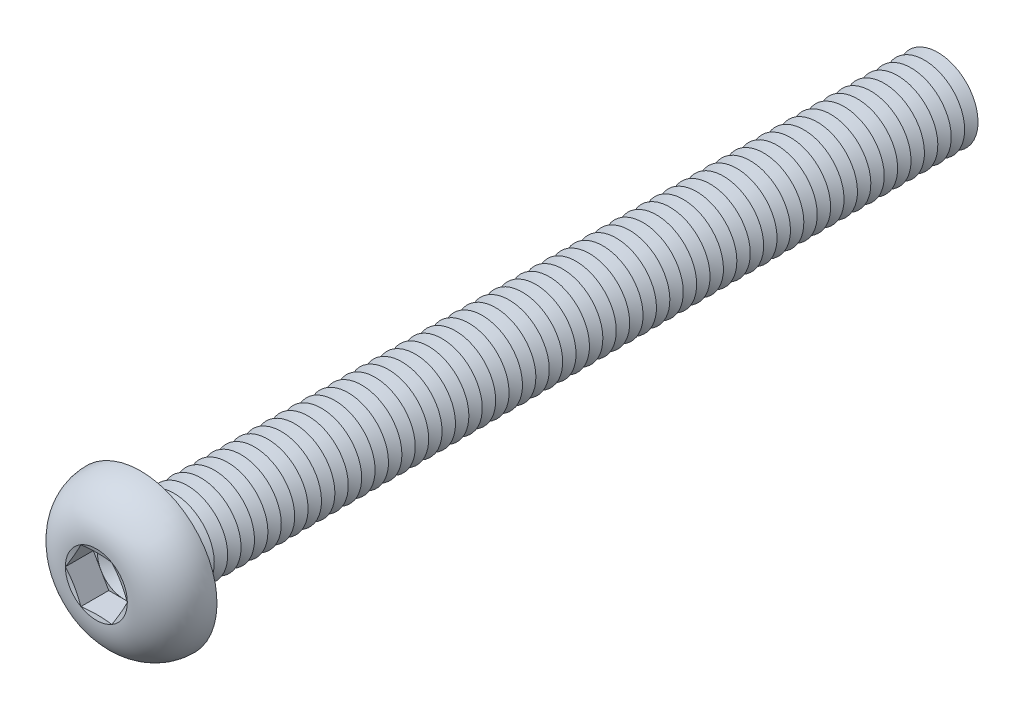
ISO-10303-21;
HEADER;
FILE_DESCRIPTION(('STEP AP214'),'2;1');
FILE_NAME('part.step','',(''),(''),'','','');
FILE_SCHEMA(('AUTOMOTIVE_DESIGN { 1 0 10303 214 1 1 1 1 }'));
ENDSEC;
DATA;
#1=APPLICATION_CONTEXT('core data for automotive mechanical design processes');
#2=APPLICATION_PROTOCOL_DEFINITION('international standard','automotive_design',2000,#1);
#3=PRODUCT_CONTEXT('',#1,'mechanical');
#4=PRODUCT('Part','Part','',(#3));
#5=PRODUCT_RELATED_PRODUCT_CATEGORY('part','',(#4));
#6=PRODUCT_DEFINITION_FORMATION('','',#4);
#7=PRODUCT_DEFINITION_CONTEXT('part definition',#1,'design');
#8=PRODUCT_DEFINITION('design','',#6,#7);
#9=PRODUCT_DEFINITION_SHAPE('','',#8);
#10=(LENGTH_UNIT() NAMED_UNIT(*) SI_UNIT(.MILLI.,.METRE.));
#11=(NAMED_UNIT(*) PLANE_ANGLE_UNIT() SI_UNIT($,.RADIAN.));
#12=(NAMED_UNIT(*) SI_UNIT($,.STERADIAN.) SOLID_ANGLE_UNIT());
#13=UNCERTAINTY_MEASURE_WITH_UNIT(LENGTH_MEASURE(1.E-05),#10,'distance_accuracy_value','');
#14=(GEOMETRIC_REPRESENTATION_CONTEXT(3) GLOBAL_UNCERTAINTY_ASSIGNED_CONTEXT((#13)) GLOBAL_UNIT_ASSIGNED_CONTEXT((#10,
#11,#12)) REPRESENTATION_CONTEXT('',''));
#15=CARTESIAN_POINT('',(0.,0.,0.));
#16=DIRECTION('',(0.,0.,1.));
#17=DIRECTION('',(1.,0.,0.));
#18=AXIS2_PLACEMENT_3D('',#15,#16,#17);
#19=CARTESIAN_POINT('',(0.,0.,0.609999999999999));
#20=DIRECTION('',(0.,0.,1.));
#21=DIRECTION('',(1.,0.,0.));
#22=AXIS2_PLACEMENT_3D('',#19,#20,#21);
#23=PLANE('',#22);
#24=CARTESIAN_POINT('',(0.,0.,0.609999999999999));
#25=DIRECTION('',(0.,0.,1.));
#26=DIRECTION('',(1.,0.,0.));
#27=AXIS2_PLACEMENT_3D('',#24,#25,#26);
#28=CIRCLE('',#27,0.999999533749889);
#29=CARTESIAN_POINT('',(0.866024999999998,0.499999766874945,0.609999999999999));
#30=VERTEX_POINT('',#29);
#31=CARTESIAN_POINT('',(0.,0.999999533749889,0.609999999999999));
#32=VERTEX_POINT('',#31);
#33=EDGE_CURVE('E118',#30,#32,#28,.T.);
#34=ORIENTED_EDGE('',*,*,#33,.F.);
#35=DIRECTION('',(-0.500000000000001,0.866025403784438,0.));
#36=VECTOR('',#35,1.);
#37=CARTESIAN_POINT('',(1.1547,0.,0.609999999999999));
#38=LINE('',#37,#36);
#39=CARTESIAN_POINT('',(0.577349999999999,0.999999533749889,0.609999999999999));
#40=VERTEX_POINT('',#39);
#41=EDGE_CURVE('E125',#30,#40,#38,.T.);
#42=ORIENTED_EDGE('',*,*,#41,.T.);
#43=DIRECTION('',(-1.,0.,0.));
#44=VECTOR('',#43,1.);
#45=CARTESIAN_POINT('',(0.577349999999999,0.999999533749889,0.609999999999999));
#46=LINE('',#45,#44);
#47=EDGE_CURVE('E136',#40,#32,#46,.T.);
#48=ORIENTED_EDGE('',*,*,#47,.T.);
#49=EDGE_LOOP('',(#34,#42,#48));
#50=FACE_BOUND('',#49,.T.);
#51=ADVANCED_FACE('F39',(#50),#23,.T.);
#52=CARTESIAN_POINT('',(0.,0.,0.609999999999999));
#53=DIRECTION('',(0.,0.,1.));
#54=DIRECTION('',(1.,0.,0.));
#55=AXIS2_PLACEMENT_3D('',#52,#53,#54);
#56=CIRCLE('',#55,0.999999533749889);
#57=CARTESIAN_POINT('',(-0.866024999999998,0.499999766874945,0.609999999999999));
#58=VERTEX_POINT('',#57);
#59=EDGE_CURVE('E11',#32,#58,#56,.T.);
#60=ORIENTED_EDGE('',*,*,#59,.F.);
#61=CARTESIAN_POINT('',(-0.577350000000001,0.999999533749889,0.609999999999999));
#62=VERTEX_POINT('',#61);
#63=EDGE_CURVE('E131',#32,#62,#46,.T.);
#64=ORIENTED_EDGE('',*,*,#63,.T.);
#65=DIRECTION('',(-0.5,-0.866025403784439,0.));
#66=VECTOR('',#65,1.);
#67=CARTESIAN_POINT('',(-0.577350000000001,0.999999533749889,0.609999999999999));
#68=LINE('',#67,#66);
#69=EDGE_CURVE('E134',#62,#58,#68,.T.);
#70=ORIENTED_EDGE('',*,*,#69,.T.);
#71=EDGE_LOOP('',(#60,#64,#70));
#72=FACE_BOUND('',#71,.T.);
#73=ADVANCED_FACE('F130',(#72),#23,.T.);
#74=CARTESIAN_POINT('',(-0.866024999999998,-0.499999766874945,0.609999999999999));
#75=VERTEX_POINT('',#74);
#76=EDGE_CURVE('E49',#58,#75,#56,.T.);
#77=ORIENTED_EDGE('',*,*,#76,.F.);
#78=CARTESIAN_POINT('',(-1.1547,0.,0.609999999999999));
#79=VERTEX_POINT('',#78);
#80=EDGE_CURVE('E143',#58,#79,#68,.T.);
#81=ORIENTED_EDGE('',*,*,#80,.T.);
#82=DIRECTION('',(0.5,-0.866025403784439,0.));
#83=VECTOR('',#82,1.);
#84=CARTESIAN_POINT('',(-1.1547,0.,0.609999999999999));
#85=LINE('',#84,#83);
#86=EDGE_CURVE('E152',#79,#75,#85,.T.);
#87=ORIENTED_EDGE('',*,*,#86,.T.);
#88=EDGE_LOOP('',(#77,#81,#87));
#89=FACE_BOUND('',#88,.T.);
#90=ADVANCED_FACE('F746',(#89),#23,.T.);
#91=CARTESIAN_POINT('',(0.,-0.999999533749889,0.609999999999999));
#92=VERTEX_POINT('',#91);
#93=EDGE_CURVE('E731',#75,#92,#56,.T.);
#94=ORIENTED_EDGE('',*,*,#93,.F.);
#95=CARTESIAN_POINT('',(-0.577349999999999,-0.999999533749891,0.609999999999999));
#96=VERTEX_POINT('',#95);
#97=EDGE_CURVE('E151',#75,#96,#85,.T.);
#98=ORIENTED_EDGE('',*,*,#97,.T.);
#99=DIRECTION('',(1.,0.,0.));
#100=VECTOR('',#99,1.);
#101=CARTESIAN_POINT('',(-0.577349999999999,-0.999999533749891,0.609999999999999));
#102=LINE('',#101,#100);
#103=EDGE_CURVE('E157',#96,#92,#102,.T.);
#104=ORIENTED_EDGE('',*,*,#103,.T.);
#105=EDGE_LOOP('',(#94,#98,#104));
#106=FACE_BOUND('',#105,.T.);
#107=ADVANCED_FACE('F739',(#106),#23,.T.);
#108=CARTESIAN_POINT('',(0.866024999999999,-0.499999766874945,0.609999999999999));
#109=VERTEX_POINT('',#108);
#110=EDGE_CURVE('E56',#92,#109,#56,.T.);
#111=ORIENTED_EDGE('',*,*,#110,.F.);
#112=CARTESIAN_POINT('',(0.577349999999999,-0.999999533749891,0.609999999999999));
#113=VERTEX_POINT('',#112);
#114=EDGE_CURVE('E156',#92,#113,#102,.T.);
#115=ORIENTED_EDGE('',*,*,#114,.T.);
#116=DIRECTION('',(0.5,0.866025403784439,0.));
#117=VECTOR('',#116,1.);
#118=CARTESIAN_POINT('',(0.577349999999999,-0.999999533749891,0.609999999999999));
#119=LINE('',#118,#117);
#120=EDGE_CURVE('E162',#113,#109,#119,.T.);
#121=ORIENTED_EDGE('',*,*,#120,.T.);
#122=EDGE_LOOP('',(#111,#115,#121));
#123=FACE_BOUND('',#122,.T.);
#124=ADVANCED_FACE('F816',(#123),#23,.T.);
#125=CARTESIAN_POINT('',(0.,0.,1.65));
#126=DIRECTION('',(0.,0.,1.));
#127=DIRECTION('',(0.,-1.,0.));
#128=AXIS2_PLACEMENT_3D('',#125,#126,#127);
#129=CONICAL_SURFACE('',#128,1.1547,1.30899693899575);
#130=CARTESIAN_POINT('',(1.15481547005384,-0.000199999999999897,1.65003094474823));
#131=CARTESIAN_POINT('',(1.13083002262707,0.0413440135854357,1.64359970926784));
#132=CARTESIAN_POINT('',(1.10680107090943,0.0829633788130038,1.63776108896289));
#133=CARTESIAN_POINT('',(1.05865826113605,0.166349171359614,1.62750303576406));
#134=CARTESIAN_POINT('',(1.03454437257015,0.208115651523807,1.62308418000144));
#135=CARTESIAN_POINT('',(0.986377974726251,0.291542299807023,1.61592375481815));
#136=CARTESIAN_POINT('',(0.962325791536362,0.333201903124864,1.61317364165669));
#137=CARTESIAN_POINT('',(0.914190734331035,0.416574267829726,1.60948600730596));
#138=CARTESIAN_POINT('',(0.890107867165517,0.458287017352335,1.60854813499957));
#139=CARTESIAN_POINT('',(0.841942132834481,0.541712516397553,1.60854813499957));
#140=CARTESIAN_POINT('',(0.817859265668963,0.583425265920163,1.60948600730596));
#141=CARTESIAN_POINT('',(0.769724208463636,0.666797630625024,1.61317364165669));
#142=CARTESIAN_POINT('',(0.745672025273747,0.708457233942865,1.61592375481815));
#143=CARTESIAN_POINT('',(0.697505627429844,0.791883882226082,1.62308418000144));
#144=CARTESIAN_POINT('',(0.673391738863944,0.833650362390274,1.62750303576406));
#145=CARTESIAN_POINT('',(0.625248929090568,0.917036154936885,1.63776108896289));
#146=CARTESIAN_POINT('',(0.60121997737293,0.958655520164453,1.64359970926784));
#147=CARTESIAN_POINT('',(0.577234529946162,1.00019953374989,1.65003094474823));
#148=B_SPLINE_CURVE_WITH_KNOTS('',3,(#130,#131,#132,#133,#134,#135,#136,#137,#138,#139,#140,
#141,#142,#143,#144,#145,#146,#147),.UNSPECIFIED.,.F.,.F.,(4,2,2,2,2,2,2,2,4),(0.,
0.145207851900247,0.290474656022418,0.434991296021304,0.579479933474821,0.723968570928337,
0.868485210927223,1.01375201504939,1.15895986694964),.UNSPECIFIED.);
#149=CARTESIAN_POINT('',(1.1547,0.,1.65));
#150=VERTEX_POINT('',#149);
#151=CARTESIAN_POINT('',(0.57735,0.99999953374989,1.65));
#152=VERTEX_POINT('',#151);
#153=EDGE_CURVE('E221',#150,#152,#148,.T.);
#154=ORIENTED_EDGE('',*,*,#153,.F.);
#155=CARTESIAN_POINT('',(0.,0.,1.65));
#156=DIRECTION('',(0.,0.,-1.));
#157=DIRECTION('',(0.,1.,0.));
#158=AXIS2_PLACEMENT_3D('',#155,#156,#157);
#159=CIRCLE('',#158,1.1547);
#160=EDGE_CURVE('E716',#152,#150,#159,.T.);
#161=ORIENTED_EDGE('',*,*,#160,.F.);
#162=EDGE_LOOP('',(#154,#161));
#163=FACE_BOUND('',#162,.T.);
#164=ADVANCED_FACE('F820',(#163),#129,.F.);
#165=CARTESIAN_POINT('',(0.577234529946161,-1.00019953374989,1.65003094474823));
#166=CARTESIAN_POINT('',(0.60121997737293,-0.958655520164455,1.64359970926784));
#167=CARTESIAN_POINT('',(0.625248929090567,-0.917036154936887,1.63776108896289));
#168=CARTESIAN_POINT('',(0.673391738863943,-0.833650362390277,1.62750303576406));
#169=CARTESIAN_POINT('',(0.697505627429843,-0.791883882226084,1.62308418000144));
#170=CARTESIAN_POINT('',(0.745672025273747,-0.708457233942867,1.61592375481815));
#171=CARTESIAN_POINT('',(0.769724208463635,-0.666797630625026,1.61317364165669));
#172=CARTESIAN_POINT('',(0.817859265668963,-0.583425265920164,1.60948600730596));
#173=CARTESIAN_POINT('',(0.84194213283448,-0.541712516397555,1.60854813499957));
#174=CARTESIAN_POINT('',(0.890107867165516,-0.458287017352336,1.60854813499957));
#175=CARTESIAN_POINT('',(0.914190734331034,-0.416574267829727,1.60948600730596));
#176=CARTESIAN_POINT('',(0.962325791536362,-0.333201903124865,1.61317364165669));
#177=CARTESIAN_POINT('',(0.98637797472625,-0.291542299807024,1.61592375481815));
#178=CARTESIAN_POINT('',(1.03454437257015,-0.208115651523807,1.62308418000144));
#179=CARTESIAN_POINT('',(1.05865826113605,-0.166349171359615,1.62750303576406));
#180=CARTESIAN_POINT('',(1.10680107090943,-0.082963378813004,1.63776108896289));
#181=CARTESIAN_POINT('',(1.13083002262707,-0.0413440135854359,1.64359970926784));
#182=CARTESIAN_POINT('',(1.15481547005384,0.000199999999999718,1.65003094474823));
#183=B_SPLINE_CURVE_WITH_KNOTS('',3,(#165,#166,#167,#168,#169,#170,#171,#172,#173,#174,#175,
#176,#177,#178,#179,#180,#181,#182),.UNSPECIFIED.,.F.,.F.,(4,2,2,2,2,2,2,2,4),(0.,
0.145207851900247,0.290474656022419,0.434991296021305,0.579479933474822,0.723968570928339,
0.868485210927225,1.0137520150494,1.15895986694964),.UNSPECIFIED.);
#184=CARTESIAN_POINT('',(0.577349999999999,-0.999999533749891,1.65));
#185=VERTEX_POINT('',#184);
#186=EDGE_CURVE('E230',#185,#150,#183,.T.);
#187=ORIENTED_EDGE('',*,*,#186,.F.);
#188=EDGE_CURVE('E721',#150,#185,#159,.T.);
#189=ORIENTED_EDGE('',*,*,#188,.F.);
#190=EDGE_LOOP('',(#187,#189));
#191=FACE_BOUND('',#190,.T.);
#192=ADVANCED_FACE('F781',(#191),#129,.F.);
#193=CARTESIAN_POINT('',(-1.7425668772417,-0.999999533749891,1.87893949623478));
#194=CARTESIAN_POINT('',(-1.65819693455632,-0.999999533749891,1.85935934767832));
#195=CARTESIAN_POINT('',(-1.57375647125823,-0.999999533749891,1.84006351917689));
#196=CARTESIAN_POINT('',(-1.40464514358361,-0.999999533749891,1.80242908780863));
#197=CARTESIAN_POINT('',(-1.31997423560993,-0.999999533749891,1.78409068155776));
#198=CARTESIAN_POINT('',(-1.14955192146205,-0.999999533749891,1.74860242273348));
#199=CARTESIAN_POINT('',(-1.06379782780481,-0.999999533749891,1.73146532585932));
#200=CARTESIAN_POINT('',(-0.891887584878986,-0.999999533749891,1.69925819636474));
#201=CARTESIAN_POINT('',(-0.805731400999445,-0.999999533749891,1.68418834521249));
#202=CARTESIAN_POINT('',(-0.635256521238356,-0.999999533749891,1.65751615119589));
#203=CARTESIAN_POINT('',(-0.550951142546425,-0.999999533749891,1.64583105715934));
#204=CARTESIAN_POINT('',(-0.381865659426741,-0.999999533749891,1.62668811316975));
#205=CARTESIAN_POINT('',(-0.297085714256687,-0.999999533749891,1.61922892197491));
#206=CARTESIAN_POINT('',(-0.127577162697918,-0.999999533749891,1.60981453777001));
#207=CARTESIAN_POINT('',(-0.0428499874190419,-0.999999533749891,1.60783514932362));
#208=CARTESIAN_POINT('',(0.126542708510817,-0.999999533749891,1.60973012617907));
#209=CARTESIAN_POINT('',(0.211208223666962,-0.999999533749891,1.61360496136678));
#210=CARTESIAN_POINT('',(0.35611534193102,-0.999999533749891,1.62460226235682));
#211=CARTESIAN_POINT('',(0.416458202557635,-0.999999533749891,1.63048841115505));
#212=CARTESIAN_POINT('',(0.536893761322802,-0.999999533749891,1.64437752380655));
#213=CARTESIAN_POINT('',(0.596986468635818,-0.999999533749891,1.65238040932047));
#214=CARTESIAN_POINT('',(0.777275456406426,-0.999999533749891,1.67888855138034));
#215=CARTESIAN_POINT('',(0.897104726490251,-0.999999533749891,1.69985858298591));
#216=CARTESIAN_POINT('',(1.07751611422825,-0.999999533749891,1.73433574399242));
#217=CARTESIAN_POINT('',(1.1383777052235,-0.999999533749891,1.74646914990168));
#218=CARTESIAN_POINT('',(1.25994955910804,-0.999999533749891,1.7714845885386));
#219=CARTESIAN_POINT('',(1.32065982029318,-0.999999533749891,1.7843666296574));
#220=CARTESIAN_POINT('',(1.44162663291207,-0.999999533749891,1.81062164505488));
#221=CARTESIAN_POINT('',(1.50188385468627,-0.999999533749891,1.82399156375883));
#222=CARTESIAN_POINT('',(1.62229550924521,-0.999999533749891,1.85116781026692));
#223=CARTESIAN_POINT('',(1.68244994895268,-0.999999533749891,1.86497410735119));
#224=CARTESIAN_POINT('',(1.7425668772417,-0.999999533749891,1.87893949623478));
#225=B_SPLINE_CURVE_WITH_KNOTS('',3,(#193,#194,#195,#196,#197,#198,#199,#200,#201,#202,#203,
#204,#205,#206,#207,#208,#209,#210,#211,#212,#213,#214,#215,#216,#217,#218,#219,#220,#221,#222,
#223,#224),.UNSPECIFIED.,.F.,.F.,(4,2,2,2,2,2,2,2,2,2,2,2,2,2,2,4),(0.,0.259842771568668,
0.519738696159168,0.782071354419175,1.04442702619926,1.29968778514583,1.55486748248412,
1.80891865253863,2.06299021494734,2.24483732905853,2.42667771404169,2.79149503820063,
2.97767344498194,3.16385393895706,3.34902052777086,3.53417411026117),.UNSPECIFIED.);
#226=CARTESIAN_POINT('',(-0.577349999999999,-0.999999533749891,1.65));
#227=VERTEX_POINT('',#226);
#228=EDGE_CURVE('E760',#227,#185,#225,.T.);
#229=ORIENTED_EDGE('',*,*,#228,.F.);
#230=EDGE_CURVE('E772',#185,#227,#159,.T.);
#231=ORIENTED_EDGE('',*,*,#230,.F.);
#232=EDGE_LOOP('',(#229,#231));
#233=FACE_BOUND('',#232,.T.);
#234=ADVANCED_FACE('F787',(#233),#129,.F.);
#235=CARTESIAN_POINT('',(-1.15481547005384,0.000199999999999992,1.65003094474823));
#236=CARTESIAN_POINT('',(-1.13083002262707,-0.0413440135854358,1.64359970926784));
#237=CARTESIAN_POINT('',(-1.10680107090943,-0.0829633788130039,1.63776108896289));
#238=CARTESIAN_POINT('',(-1.05865826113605,-0.166349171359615,1.62750303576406));
#239=CARTESIAN_POINT('',(-1.03454437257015,-0.208115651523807,1.62308418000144));
#240=CARTESIAN_POINT('',(-0.986377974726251,-0.291542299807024,1.61592375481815));
#241=CARTESIAN_POINT('',(-0.962325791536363,-0.333201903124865,1.61317364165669));
#242=CARTESIAN_POINT('',(-0.914190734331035,-0.416574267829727,1.60948600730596));
#243=CARTESIAN_POINT('',(-0.890107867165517,-0.458287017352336,1.60854813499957));
#244=CARTESIAN_POINT('',(-0.841942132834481,-0.541712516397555,1.60854813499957));
#245=CARTESIAN_POINT('',(-0.817859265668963,-0.583425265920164,1.60948600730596));
#246=CARTESIAN_POINT('',(-0.769724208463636,-0.666797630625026,1.61317364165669));
#247=CARTESIAN_POINT('',(-0.745672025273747,-0.708457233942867,1.61592375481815));
#248=CARTESIAN_POINT('',(-0.697505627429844,-0.791883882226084,1.62308418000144));
#249=CARTESIAN_POINT('',(-0.673391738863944,-0.833650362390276,1.62750303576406));
#250=CARTESIAN_POINT('',(-0.625248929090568,-0.917036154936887,1.63776108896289));
#251=CARTESIAN_POINT('',(-0.60121997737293,-0.958655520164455,1.64359970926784));
#252=CARTESIAN_POINT('',(-0.577234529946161,-1.00019953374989,1.65003094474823));
#253=B_SPLINE_CURVE_WITH_KNOTS('',3,(#235,#236,#237,#238,#239,#240,#241,#242,#243,#244,#245,
#246,#247,#248,#249,#250,#251,#252),.UNSPECIFIED.,.F.,.F.,(4,2,2,2,2,2,2,2,4),(0.,
0.145207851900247,0.290474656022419,0.434991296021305,0.579479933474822,0.723968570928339,
0.868485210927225,1.0137520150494,1.15895986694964),.UNSPECIFIED.);
#254=CARTESIAN_POINT('',(-1.1547,0.,1.65));
#255=VERTEX_POINT('',#254);
#256=EDGE_CURVE('E751',#255,#227,#253,.T.);
#257=ORIENTED_EDGE('',*,*,#256,.F.);
#258=EDGE_CURVE('E757',#227,#255,#159,.T.);
#259=ORIENTED_EDGE('',*,*,#258,.F.);
#260=EDGE_LOOP('',(#257,#259));
#261=FACE_BOUND('',#260,.T.);
#262=ADVANCED_FACE('F755',(#261),#129,.F.);
#263=CARTESIAN_POINT('',(-0.577234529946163,1.00019953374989,1.65003094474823));
#264=CARTESIAN_POINT('',(-0.601219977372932,0.958655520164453,1.64359970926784));
#265=CARTESIAN_POINT('',(-0.625248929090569,0.917036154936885,1.63776108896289));
#266=CARTESIAN_POINT('',(-0.673391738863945,0.833650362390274,1.62750303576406));
#267=CARTESIAN_POINT('',(-0.697505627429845,0.791883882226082,1.62308418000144));
#268=CARTESIAN_POINT('',(-0.745672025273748,0.708457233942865,1.61592375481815));
#269=CARTESIAN_POINT('',(-0.769724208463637,0.666797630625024,1.61317364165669));
#270=CARTESIAN_POINT('',(-0.817859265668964,0.583425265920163,1.60948600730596));
#271=CARTESIAN_POINT('',(-0.841942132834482,0.541712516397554,1.60854813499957));
#272=CARTESIAN_POINT('',(-0.890107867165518,0.458287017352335,1.60854813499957));
#273=CARTESIAN_POINT('',(-0.914190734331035,0.416574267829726,1.60948600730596));
#274=CARTESIAN_POINT('',(-0.962325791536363,0.333201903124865,1.61317364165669));
#275=CARTESIAN_POINT('',(-0.986377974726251,0.291542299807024,1.61592375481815));
#276=CARTESIAN_POINT('',(-1.03454437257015,0.208115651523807,1.62308418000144));
#277=CARTESIAN_POINT('',(-1.05865826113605,0.166349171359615,1.62750303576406));
#278=CARTESIAN_POINT('',(-1.10680107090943,0.082963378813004,1.63776108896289));
#279=CARTESIAN_POINT('',(-1.13083002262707,0.041344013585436,1.64359970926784));
#280=CARTESIAN_POINT('',(-1.15481547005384,-0.000199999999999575,1.65003094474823));
#281=B_SPLINE_CURVE_WITH_KNOTS('',3,(#263,#264,#265,#266,#267,#268,#269,#270,#271,#272,#273,
#274,#275,#276,#277,#278,#279,#280),.UNSPECIFIED.,.F.,.F.,(4,2,2,2,2,2,2,2,4),(0.,
0.145207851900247,0.290474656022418,0.434991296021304,0.57947993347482,0.723968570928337,
0.868485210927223,1.01375201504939,1.15895986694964),.UNSPECIFIED.);
#282=CARTESIAN_POINT('',(-0.577350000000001,0.999999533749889,1.65));
#283=VERTEX_POINT('',#282);
#284=EDGE_CURVE('E195',#283,#255,#281,.T.);
#285=ORIENTED_EDGE('',*,*,#284,.F.);
#286=EDGE_CURVE('E763',#255,#283,#159,.T.);
#287=ORIENTED_EDGE('',*,*,#286,.F.);
#288=EDGE_LOOP('',(#285,#287));
#289=FACE_BOUND('',#288,.T.);
#290=ADVANCED_FACE('F764',(#289),#129,.F.);
#291=CARTESIAN_POINT('',(0.,0.,-28.25));
#292=DIRECTION('',(0.,0.,1.));
#293=DIRECTION('',(0.,-1.,0.));
#294=AXIS2_PLACEMENT_3D('',#291,#292,#293);
#295=CONICAL_SURFACE('',#294,1.49999999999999,1.0471975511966);
#296=CARTESIAN_POINT('',(0.,0.,-28.5));
#297=DIRECTION('',(0.,0.,1.));
#298=DIRECTION('',(0.,-1.,0.));
#299=AXIS2_PLACEMENT_3D('',#296,#297,#298);
#300=CIRCLE('',#299,1.06698729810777);
#301=CARTESIAN_POINT('',(0.,-1.06698729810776,-28.5));
#302=VERTEX_POINT('',#301);
#303=EDGE_CURVE('E687',#302,#302,#300,.T.);
#304=ORIENTED_EDGE('',*,*,#303,.T.);
#305=EDGE_LOOP('',(#304));
#306=FACE_BOUND('',#305,.T.);
#307=CARTESIAN_POINT('',(0.,0.,-28.25));
#308=DIRECTION('',(0.,0.,1.));
#309=DIRECTION('',(0.,-1.,0.));
#310=AXIS2_PLACEMENT_3D('',#307,#308,#309);
#311=CIRCLE('',#310,1.49999999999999);
#312=CARTESIAN_POINT('',(0.,-1.49999999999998,-28.25));
#313=VERTEX_POINT('',#312);
#314=EDGE_CURVE('E683',#313,#313,#311,.T.);
#315=ORIENTED_EDGE('',*,*,#314,.F.);
#316=EDGE_LOOP('',(#315));
#317=FACE_BOUND('',#316,.T.);
#318=ADVANCED_FACE('F846',(#306,#317),#295,.T.);
#319=CARTESIAN_POINT('',(0.,0.,-28.5));
#320=DIRECTION('',(0.,0.,-1.));
#321=DIRECTION('',(0.,1.,0.));
#322=AXIS2_PLACEMENT_3D('',#319,#320,#321);
#323=CONICAL_SURFACE('',#322,1.06698729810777,1.0471975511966);
#324=CARTESIAN_POINT('',(0.,0.,-28.75));
#325=DIRECTION('',(0.,0.,1.));
#326=DIRECTION('',(0.,-1.,0.));
#327=AXIS2_PLACEMENT_3D('',#324,#325,#326);
#328=CIRCLE('',#327,1.49999999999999);
#329=CARTESIAN_POINT('',(0.,-1.49999999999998,-28.75));
#330=VERTEX_POINT('',#329);
#331=EDGE_CURVE('E691',#330,#330,#328,.T.);
#332=ORIENTED_EDGE('',*,*,#331,.T.);
#333=EDGE_LOOP('',(#332));
#334=FACE_BOUND('',#333,.T.);
#335=ORIENTED_EDGE('',*,*,#303,.F.);
#336=EDGE_LOOP('',(#335));
#337=FACE_BOUND('',#336,.T.);
#338=ADVANCED_FACE('F851',(#334,#337),#323,.T.);
#339=CARTESIAN_POINT('',(0.,1.5,-30.));
#340=DIRECTION('',(0.,0.,-1.));
#341=DIRECTION('',(0.,1.,0.));
#342=AXIS2_PLACEMENT_3D('',#339,#340,#341);
#343=PLANE('',#342);
#344=CARTESIAN_POINT('',(0.,0.,-30.));
#345=DIRECTION('',(0.,0.,1.));
#346=DIRECTION('',(0.,-1.,0.));
#347=AXIS2_PLACEMENT_3D('',#344,#345,#346);
#348=CIRCLE('',#347,1.06698729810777);
#349=CARTESIAN_POINT('',(0.,-1.06698729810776,-30.));
#350=VERTEX_POINT('',#349);
#351=EDGE_CURVE('E711',#350,#350,#348,.T.);
#352=ORIENTED_EDGE('',*,*,#351,.F.);
#353=EDGE_LOOP('',(#352));
#354=FACE_BOUND('',#353,.T.);
#355=ADVANCED_FACE('F1018',(#354),#343,.T.);
#356=CARTESIAN_POINT('',(0.,0.,-29.75));
#357=DIRECTION('',(0.,0.,1.));
#358=DIRECTION('',(0.,-1.,0.));
#359=AXIS2_PLACEMENT_3D('',#356,#357,#358);
#360=CONICAL_SURFACE('',#359,1.49999999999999,1.0471975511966);
#361=ORIENTED_EDGE('',*,*,#351,.T.);
#362=EDGE_LOOP('',(#361));
#363=FACE_BOUND('',#362,.T.);
#364=CARTESIAN_POINT('',(0.,0.,-29.75));
#365=DIRECTION('',(0.,0.,1.));
#366=DIRECTION('',(0.,-1.,0.));
#367=AXIS2_PLACEMENT_3D('',#364,#365,#366);
#368=CIRCLE('',#367,1.49999999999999);
#369=CARTESIAN_POINT('',(0.,-1.49999999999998,-29.75));
#370=VERTEX_POINT('',#369);
#371=EDGE_CURVE('E707',#370,#370,#368,.T.);
#372=ORIENTED_EDGE('',*,*,#371,.F.);
#373=EDGE_LOOP('',(#372));
#374=FACE_BOUND('',#373,.T.);
#375=ADVANCED_FACE('F1011',(#363,#374),#360,.T.);
#376=CARTESIAN_POINT('',(0.,0.,-29.5));
#377=DIRECTION('',(0.,0.,-1.));
#378=DIRECTION('',(0.,1.,0.));
#379=AXIS2_PLACEMENT_3D('',#376,#377,#378);
#380=CONICAL_SURFACE('',#379,1.06698729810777,1.0471975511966);
#381=ORIENTED_EDGE('',*,*,#371,.T.);
#382=EDGE_LOOP('',(#381));
#383=FACE_BOUND('',#382,.T.);
#384=CARTESIAN_POINT('',(0.,0.,-29.5));
#385=DIRECTION('',(0.,0.,1.));
#386=DIRECTION('',(0.,-1.,0.));
#387=AXIS2_PLACEMENT_3D('',#384,#385,#386);
#388=CIRCLE('',#387,1.06698729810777);
#389=CARTESIAN_POINT('',(0.,-1.06698729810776,-29.5));
#390=VERTEX_POINT('',#389);
#391=EDGE_CURVE('E703',#390,#390,#388,.T.);
#392=ORIENTED_EDGE('',*,*,#391,.F.);
#393=EDGE_LOOP('',(#392));
#394=FACE_BOUND('',#393,.T.);
#395=ADVANCED_FACE('F1017',(#383,#394),#380,.T.);
#396=CARTESIAN_POINT('',(0.,0.,-29.25));
#397=DIRECTION('',(0.,0.,1.));
#398=DIRECTION('',(0.,-1.,0.));
#399=AXIS2_PLACEMENT_3D('',#396,#397,#398);
#400=CONICAL_SURFACE('',#399,1.49999999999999,1.0471975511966);
#401=ORIENTED_EDGE('',*,*,#391,.T.);
#402=EDGE_LOOP('',(#401));
#403=FACE_BOUND('',#402,.T.);
#404=CARTESIAN_POINT('',(0.,0.,-29.25));
#405=DIRECTION('',(0.,0.,1.));
#406=DIRECTION('',(0.,-1.,0.));
#407=AXIS2_PLACEMENT_3D('',#404,#405,#406);
#408=CIRCLE('',#407,1.49999999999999);
#409=CARTESIAN_POINT('',(0.,-1.49999999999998,-29.25));
#410=VERTEX_POINT('',#409);
#411=EDGE_CURVE('E699',#410,#410,#408,.T.);
#412=ORIENTED_EDGE('',*,*,#411,.F.);
#413=EDGE_LOOP('',(#412));
#414=FACE_BOUND('',#413,.T.);
#415=ADVANCED_FACE('F1049',(#403,#414),#400,.T.);
#416=CARTESIAN_POINT('',(0.,0.,-29.));
#417=DIRECTION('',(0.,0.,-1.));
#418=DIRECTION('',(0.,1.,0.));
#419=AXIS2_PLACEMENT_3D('',#416,#417,#418);
#420=CONICAL_SURFACE('',#419,1.06698729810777,1.0471975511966);
#421=ORIENTED_EDGE('',*,*,#411,.T.);
#422=EDGE_LOOP('',(#421));
#423=FACE_BOUND('',#422,.T.);
#424=CARTESIAN_POINT('',(0.,0.,-29.));
#425=DIRECTION('',(0.,0.,1.));
#426=DIRECTION('',(0.,-1.,0.));
#427=AXIS2_PLACEMENT_3D('',#424,#425,#426);
#428=CIRCLE('',#427,1.06698729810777);
#429=CARTESIAN_POINT('',(0.,-1.06698729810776,-29.));
#430=VERTEX_POINT('',#429);
#431=EDGE_CURVE('E695',#430,#430,#428,.T.);
#432=ORIENTED_EDGE('',*,*,#431,.F.);
#433=EDGE_LOOP('',(#432));
#434=FACE_BOUND('',#433,.T.);
#435=ADVANCED_FACE('F1059',(#423,#434),#420,.T.);
#436=CARTESIAN_POINT('',(0.,0.,-28.75));
#437=DIRECTION('',(0.,0.,1.));
#438=DIRECTION('',(0.,-1.,0.));
#439=AXIS2_PLACEMENT_3D('',#436,#437,#438);
#440=CONICAL_SURFACE('',#439,1.49999999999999,1.0471975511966);
#441=ORIENTED_EDGE('',*,*,#431,.T.);
#442=EDGE_LOOP('',(#441));
#443=FACE_BOUND('',#442,.T.);
#444=ORIENTED_EDGE('',*,*,#331,.F.);
#445=EDGE_LOOP('',(#444));
#446=FACE_BOUND('',#445,.T.);
#447=ADVANCED_FACE('F1069',(#443,#446),#440,.T.);
#448=CARTESIAN_POINT('',(0.,0.,-27.75));
#449=DIRECTION('',(0.,0.,1.));
#450=DIRECTION('',(0.,-1.,0.));
#451=AXIS2_PLACEMENT_3D('',#448,#449,#450);
#452=CONICAL_SURFACE('',#451,1.49999999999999,1.0471975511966);
#453=CARTESIAN_POINT('',(0.,0.,-28.));
#454=DIRECTION('',(0.,0.,1.));
#455=DIRECTION('',(0.,-1.,0.));
#456=AXIS2_PLACEMENT_3D('',#453,#454,#455);
#457=CIRCLE('',#456,1.06698729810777);
#458=CARTESIAN_POINT('',(0.,-1.06698729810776,-28.));
#459=VERTEX_POINT('',#458);
#460=EDGE_CURVE('E679',#459,#459,#457,.T.);
#461=ORIENTED_EDGE('',*,*,#460,.T.);
#462=EDGE_LOOP('',(#461));
#463=FACE_BOUND('',#462,.T.);
#464=CARTESIAN_POINT('',(0.,0.,-27.75));
#465=DIRECTION('',(0.,0.,1.));
#466=DIRECTION('',(0.,-1.,0.));
#467=AXIS2_PLACEMENT_3D('',#464,#465,#466);
#468=CIRCLE('',#467,1.49999999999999);
#469=CARTESIAN_POINT('',(0.,-1.49999999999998,-27.75));
#470=VERTEX_POINT('',#469);
#471=EDGE_CURVE('E675',#470,#470,#468,.T.);
#472=ORIENTED_EDGE('',*,*,#471,.F.);
#473=EDGE_LOOP('',(#472));
#474=FACE_BOUND('',#473,.T.);
#475=ADVANCED_FACE('F1079',(#463,#474),#452,.T.);
#476=CARTESIAN_POINT('',(0.,0.,-28.));
#477=DIRECTION('',(0.,0.,-1.));
#478=DIRECTION('',(0.,1.,0.));
#479=AXIS2_PLACEMENT_3D('',#476,#477,#478);
#480=CONICAL_SURFACE('',#479,1.06698729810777,1.0471975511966);
#481=ORIENTED_EDGE('',*,*,#314,.T.);
#482=EDGE_LOOP('',(#481));
#483=FACE_BOUND('',#482,.T.);
#484=ORIENTED_EDGE('',*,*,#460,.F.);
#485=EDGE_LOOP('',(#484));
#486=FACE_BOUND('',#485,.T.);
#487=ADVANCED_FACE('F1089',(#483,#486),#480,.T.);
#488=CARTESIAN_POINT('',(0.,0.,-27.25));
#489=DIRECTION('',(0.,0.,1.));
#490=DIRECTION('',(0.,-1.,0.));
#491=AXIS2_PLACEMENT_3D('',#488,#489,#490);
#492=CONICAL_SURFACE('',#491,1.49999999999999,1.0471975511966);
#493=CARTESIAN_POINT('',(0.,0.,-27.5));
#494=DIRECTION('',(0.,0.,1.));
#495=DIRECTION('',(0.,-1.,0.));
#496=AXIS2_PLACEMENT_3D('',#493,#494,#495);
#497=CIRCLE('',#496,1.06698729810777);
#498=CARTESIAN_POINT('',(0.,-1.06698729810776,-27.5));
#499=VERTEX_POINT('',#498);
#500=EDGE_CURVE('E671',#499,#499,#497,.T.);
#501=ORIENTED_EDGE('',*,*,#500,.T.);
#502=EDGE_LOOP('',(#501));
#503=FACE_BOUND('',#502,.T.);
#504=CARTESIAN_POINT('',(0.,0.,-27.25));
#505=DIRECTION('',(0.,0.,1.));
#506=DIRECTION('',(0.,-1.,0.));
#507=AXIS2_PLACEMENT_3D('',#504,#505,#506);
#508=CIRCLE('',#507,1.49999999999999);
#509=CARTESIAN_POINT('',(0.,-1.49999999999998,-27.25));
#510=VERTEX_POINT('',#509);
#511=EDGE_CURVE('E667',#510,#510,#508,.T.);
#512=ORIENTED_EDGE('',*,*,#511,.F.);
#513=EDGE_LOOP('',(#512));
#514=FACE_BOUND('',#513,.T.);
#515=ADVANCED_FACE('F1099',(#503,#514),#492,.T.);
#516=CARTESIAN_POINT('',(0.,0.,-27.5));
#517=DIRECTION('',(0.,0.,-1.));
#518=DIRECTION('',(0.,1.,0.));
#519=AXIS2_PLACEMENT_3D('',#516,#517,#518);
#520=CONICAL_SURFACE('',#519,1.06698729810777,1.0471975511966);
#521=ORIENTED_EDGE('',*,*,#471,.T.);
#522=EDGE_LOOP('',(#521));
#523=FACE_BOUND('',#522,.T.);
#524=ORIENTED_EDGE('',*,*,#500,.F.);
#525=EDGE_LOOP('',(#524));
#526=FACE_BOUND('',#525,.T.);
#527=ADVANCED_FACE('F1109',(#523,#526),#520,.T.);
#528=CARTESIAN_POINT('',(0.,0.,-26.75));
#529=DIRECTION('',(0.,0.,1.));
#530=DIRECTION('',(0.,-1.,0.));
#531=AXIS2_PLACEMENT_3D('',#528,#529,#530);
#532=CONICAL_SURFACE('',#531,1.49999999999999,1.0471975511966);
#533=CARTESIAN_POINT('',(0.,0.,-27.));
#534=DIRECTION('',(0.,0.,1.));
#535=DIRECTION('',(0.,-1.,0.));
#536=AXIS2_PLACEMENT_3D('',#533,#534,#535);
#537=CIRCLE('',#536,1.06698729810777);
#538=CARTESIAN_POINT('',(0.,-1.06698729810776,-27.));
#539=VERTEX_POINT('',#538);
#540=EDGE_CURVE('E663',#539,#539,#537,.T.);
#541=ORIENTED_EDGE('',*,*,#540,.T.);
#542=EDGE_LOOP('',(#541));
#543=FACE_BOUND('',#542,.T.);
#544=CARTESIAN_POINT('',(0.,0.,-26.75));
#545=DIRECTION('',(0.,0.,1.));
#546=DIRECTION('',(0.,-1.,0.));
#547=AXIS2_PLACEMENT_3D('',#544,#545,#546);
#548=CIRCLE('',#547,1.49999999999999);
#549=CARTESIAN_POINT('',(0.,-1.49999999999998,-26.75));
#550=VERTEX_POINT('',#549);
#551=EDGE_CURVE('E659',#550,#550,#548,.T.);
#552=ORIENTED_EDGE('',*,*,#551,.F.);
#553=EDGE_LOOP('',(#552));
#554=FACE_BOUND('',#553,.T.);
#555=ADVANCED_FACE('F1119',(#543,#554),#532,.T.);
#556=CARTESIAN_POINT('',(0.,0.,-27.));
#557=DIRECTION('',(0.,0.,-1.));
#558=DIRECTION('',(0.,1.,0.));
#559=AXIS2_PLACEMENT_3D('',#556,#557,#558);
#560=CONICAL_SURFACE('',#559,1.06698729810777,1.0471975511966);
#561=ORIENTED_EDGE('',*,*,#511,.T.);
#562=EDGE_LOOP('',(#561));
#563=FACE_BOUND('',#562,.T.);
#564=ORIENTED_EDGE('',*,*,#540,.F.);
#565=EDGE_LOOP('',(#564));
#566=FACE_BOUND('',#565,.T.);
#567=ADVANCED_FACE('F1129',(#563,#566),#560,.T.);
#568=CARTESIAN_POINT('',(0.,0.,-26.25));
#569=DIRECTION('',(0.,0.,1.));
#570=DIRECTION('',(0.,-1.,0.));
#571=AXIS2_PLACEMENT_3D('',#568,#569,#570);
#572=CONICAL_SURFACE('',#571,1.49999999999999,1.0471975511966);
#573=CARTESIAN_POINT('',(0.,0.,-26.5));
#574=DIRECTION('',(0.,0.,1.));
#575=DIRECTION('',(0.,-1.,0.));
#576=AXIS2_PLACEMENT_3D('',#573,#574,#575);
#577=CIRCLE('',#576,1.06698729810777);
#578=CARTESIAN_POINT('',(0.,-1.06698729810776,-26.5));
#579=VERTEX_POINT('',#578);
#580=EDGE_CURVE('E655',#579,#579,#577,.T.);
#581=ORIENTED_EDGE('',*,*,#580,.T.);
#582=EDGE_LOOP('',(#581));
#583=FACE_BOUND('',#582,.T.);
#584=CARTESIAN_POINT('',(0.,0.,-26.25));
#585=DIRECTION('',(0.,0.,1.));
#586=DIRECTION('',(0.,-1.,0.));
#587=AXIS2_PLACEMENT_3D('',#584,#585,#586);
#588=CIRCLE('',#587,1.49999999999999);
#589=CARTESIAN_POINT('',(0.,-1.49999999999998,-26.25));
#590=VERTEX_POINT('',#589);
#591=EDGE_CURVE('E651',#590,#590,#588,.T.);
#592=ORIENTED_EDGE('',*,*,#591,.F.);
#593=EDGE_LOOP('',(#592));
#594=FACE_BOUND('',#593,.T.);
#595=ADVANCED_FACE('F1139',(#583,#594),#572,.T.);
#596=CARTESIAN_POINT('',(0.,0.,-26.5));
#597=DIRECTION('',(0.,0.,-1.));
#598=DIRECTION('',(0.,1.,0.));
#599=AXIS2_PLACEMENT_3D('',#596,#597,#598);
#600=CONICAL_SURFACE('',#599,1.06698729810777,1.0471975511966);
#601=ORIENTED_EDGE('',*,*,#551,.T.);
#602=EDGE_LOOP('',(#601));
#603=FACE_BOUND('',#602,.T.);
#604=ORIENTED_EDGE('',*,*,#580,.F.);
#605=EDGE_LOOP('',(#604));
#606=FACE_BOUND('',#605,.T.);
#607=ADVANCED_FACE('F1149',(#603,#606),#600,.T.);
#608=CARTESIAN_POINT('',(0.,0.,-25.75));
#609=DIRECTION('',(0.,0.,1.));
#610=DIRECTION('',(0.,-1.,0.));
#611=AXIS2_PLACEMENT_3D('',#608,#609,#610);
#612=CONICAL_SURFACE('',#611,1.49999999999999,1.0471975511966);
#613=CARTESIAN_POINT('',(0.,0.,-26.));
#614=DIRECTION('',(0.,0.,1.));
#615=DIRECTION('',(0.,-1.,0.));
#616=AXIS2_PLACEMENT_3D('',#613,#614,#615);
#617=CIRCLE('',#616,1.06698729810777);
#618=CARTESIAN_POINT('',(0.,-1.06698729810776,-26.));
#619=VERTEX_POINT('',#618);
#620=EDGE_CURVE('E647',#619,#619,#617,.T.);
#621=ORIENTED_EDGE('',*,*,#620,.T.);
#622=EDGE_LOOP('',(#621));
#623=FACE_BOUND('',#622,.T.);
#624=CARTESIAN_POINT('',(0.,0.,-25.75));
#625=DIRECTION('',(0.,0.,1.));
#626=DIRECTION('',(0.,-1.,0.));
#627=AXIS2_PLACEMENT_3D('',#624,#625,#626);
#628=CIRCLE('',#627,1.49999999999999);
#629=CARTESIAN_POINT('',(0.,-1.49999999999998,-25.75));
#630=VERTEX_POINT('',#629);
#631=EDGE_CURVE('E643',#630,#630,#628,.T.);
#632=ORIENTED_EDGE('',*,*,#631,.F.);
#633=EDGE_LOOP('',(#632));
#634=FACE_BOUND('',#633,.T.);
#635=ADVANCED_FACE('F1159',(#623,#634),#612,.T.);
#636=CARTESIAN_POINT('',(0.,0.,-26.));
#637=DIRECTION('',(0.,0.,-1.));
#638=DIRECTION('',(0.,1.,0.));
#639=AXIS2_PLACEMENT_3D('',#636,#637,#638);
#640=CONICAL_SURFACE('',#639,1.06698729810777,1.0471975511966);
#641=ORIENTED_EDGE('',*,*,#591,.T.);
#642=EDGE_LOOP('',(#641));
#643=FACE_BOUND('',#642,.T.);
#644=ORIENTED_EDGE('',*,*,#620,.F.);
#645=EDGE_LOOP('',(#644));
#646=FACE_BOUND('',#645,.T.);
#647=ADVANCED_FACE('F1169',(#643,#646),#640,.T.);
#648=CARTESIAN_POINT('',(0.,0.,-25.25));
#649=DIRECTION('',(0.,0.,1.));
#650=DIRECTION('',(0.,-1.,0.));
#651=AXIS2_PLACEMENT_3D('',#648,#649,#650);
#652=CONICAL_SURFACE('',#651,1.49999999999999,1.0471975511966);
#653=CARTESIAN_POINT('',(0.,0.,-25.5));
#654=DIRECTION('',(0.,0.,1.));
#655=DIRECTION('',(0.,-1.,0.));
#656=AXIS2_PLACEMENT_3D('',#653,#654,#655);
#657=CIRCLE('',#656,1.06698729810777);
#658=CARTESIAN_POINT('',(0.,-1.06698729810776,-25.5));
#659=VERTEX_POINT('',#658);
#660=EDGE_CURVE('E639',#659,#659,#657,.T.);
#661=ORIENTED_EDGE('',*,*,#660,.T.);
#662=EDGE_LOOP('',(#661));
#663=FACE_BOUND('',#662,.T.);
#664=CARTESIAN_POINT('',(0.,0.,-25.25));
#665=DIRECTION('',(0.,0.,1.));
#666=DIRECTION('',(0.,-1.,0.));
#667=AXIS2_PLACEMENT_3D('',#664,#665,#666);
#668=CIRCLE('',#667,1.49999999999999);
#669=CARTESIAN_POINT('',(0.,-1.49999999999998,-25.25));
#670=VERTEX_POINT('',#669);
#671=EDGE_CURVE('E635',#670,#670,#668,.T.);
#672=ORIENTED_EDGE('',*,*,#671,.F.);
#673=EDGE_LOOP('',(#672));
#674=FACE_BOUND('',#673,.T.);
#675=ADVANCED_FACE('F1179',(#663,#674),#652,.T.);
#676=CARTESIAN_POINT('',(0.,0.,-25.5));
#677=DIRECTION('',(0.,0.,-1.));
#678=DIRECTION('',(0.,1.,0.));
#679=AXIS2_PLACEMENT_3D('',#676,#677,#678);
#680=CONICAL_SURFACE('',#679,1.06698729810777,1.0471975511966);
#681=ORIENTED_EDGE('',*,*,#631,.T.);
#682=EDGE_LOOP('',(#681));
#683=FACE_BOUND('',#682,.T.);
#684=ORIENTED_EDGE('',*,*,#660,.F.);
#685=EDGE_LOOP('',(#684));
#686=FACE_BOUND('',#685,.T.);
#687=ADVANCED_FACE('F1189',(#683,#686),#680,.T.);
#688=CARTESIAN_POINT('',(0.,0.,-24.75));
#689=DIRECTION('',(0.,0.,1.));
#690=DIRECTION('',(0.,-1.,0.));
#691=AXIS2_PLACEMENT_3D('',#688,#689,#690);
#692=CONICAL_SURFACE('',#691,1.49999999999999,1.0471975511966);
#693=CARTESIAN_POINT('',(0.,0.,-25.));
#694=DIRECTION('',(0.,0.,1.));
#695=DIRECTION('',(0.,-1.,0.));
#696=AXIS2_PLACEMENT_3D('',#693,#694,#695);
#697=CIRCLE('',#696,1.06698729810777);
#698=CARTESIAN_POINT('',(0.,-1.06698729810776,-25.));
#699=VERTEX_POINT('',#698);
#700=EDGE_CURVE('E631',#699,#699,#697,.T.);
#701=ORIENTED_EDGE('',*,*,#700,.T.);
#702=EDGE_LOOP('',(#701));
#703=FACE_BOUND('',#702,.T.);
#704=CARTESIAN_POINT('',(0.,0.,-24.75));
#705=DIRECTION('',(0.,0.,1.));
#706=DIRECTION('',(0.,-1.,0.));
#707=AXIS2_PLACEMENT_3D('',#704,#705,#706);
#708=CIRCLE('',#707,1.49999999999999);
#709=CARTESIAN_POINT('',(0.,-1.49999999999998,-24.75));
#710=VERTEX_POINT('',#709);
#711=EDGE_CURVE('E627',#710,#710,#708,.T.);
#712=ORIENTED_EDGE('',*,*,#711,.F.);
#713=EDGE_LOOP('',(#712));
#714=FACE_BOUND('',#713,.T.);
#715=ADVANCED_FACE('F1199',(#703,#714),#692,.T.);
#716=CARTESIAN_POINT('',(0.,0.,-25.));
#717=DIRECTION('',(0.,0.,-1.));
#718=DIRECTION('',(0.,1.,0.));
#719=AXIS2_PLACEMENT_3D('',#716,#717,#718);
#720=CONICAL_SURFACE('',#719,1.06698729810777,1.0471975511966);
#721=ORIENTED_EDGE('',*,*,#671,.T.);
#722=EDGE_LOOP('',(#721));
#723=FACE_BOUND('',#722,.T.);
#724=ORIENTED_EDGE('',*,*,#700,.F.);
#725=EDGE_LOOP('',(#724));
#726=FACE_BOUND('',#725,.T.);
#727=ADVANCED_FACE('F1209',(#723,#726),#720,.T.);
#728=CARTESIAN_POINT('',(0.,0.,-24.25));
#729=DIRECTION('',(0.,0.,1.));
#730=DIRECTION('',(0.,-1.,0.));
#731=AXIS2_PLACEMENT_3D('',#728,#729,#730);
#732=CONICAL_SURFACE('',#731,1.49999999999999,1.0471975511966);
#733=CARTESIAN_POINT('',(0.,0.,-24.5));
#734=DIRECTION('',(0.,0.,1.));
#735=DIRECTION('',(0.,-1.,0.));
#736=AXIS2_PLACEMENT_3D('',#733,#734,#735);
#737=CIRCLE('',#736,1.06698729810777);
#738=CARTESIAN_POINT('',(0.,-1.06698729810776,-24.5));
#739=VERTEX_POINT('',#738);
#740=EDGE_CURVE('E623',#739,#739,#737,.T.);
#741=ORIENTED_EDGE('',*,*,#740,.T.);
#742=EDGE_LOOP('',(#741));
#743=FACE_BOUND('',#742,.T.);
#744=CARTESIAN_POINT('',(0.,0.,-24.25));
#745=DIRECTION('',(0.,0.,1.));
#746=DIRECTION('',(0.,-1.,0.));
#747=AXIS2_PLACEMENT_3D('',#744,#745,#746);
#748=CIRCLE('',#747,1.49999999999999);
#749=CARTESIAN_POINT('',(0.,-1.49999999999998,-24.25));
#750=VERTEX_POINT('',#749);
#751=EDGE_CURVE('E619',#750,#750,#748,.T.);
#752=ORIENTED_EDGE('',*,*,#751,.F.);
#753=EDGE_LOOP('',(#752));
#754=FACE_BOUND('',#753,.T.);
#755=ADVANCED_FACE('F1219',(#743,#754),#732,.T.);
#756=CARTESIAN_POINT('',(0.,0.,-24.5));
#757=DIRECTION('',(0.,0.,-1.));
#758=DIRECTION('',(0.,1.,0.));
#759=AXIS2_PLACEMENT_3D('',#756,#757,#758);
#760=CONICAL_SURFACE('',#759,1.06698729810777,1.0471975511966);
#761=ORIENTED_EDGE('',*,*,#711,.T.);
#762=EDGE_LOOP('',(#761));
#763=FACE_BOUND('',#762,.T.);
#764=ORIENTED_EDGE('',*,*,#740,.F.);
#765=EDGE_LOOP('',(#764));
#766=FACE_BOUND('',#765,.T.);
#767=ADVANCED_FACE('F1229',(#763,#766),#760,.T.);
#768=CARTESIAN_POINT('',(0.,0.,-23.75));
#769=DIRECTION('',(0.,0.,1.));
#770=DIRECTION('',(0.,-1.,0.));
#771=AXIS2_PLACEMENT_3D('',#768,#769,#770);
#772=CONICAL_SURFACE('',#771,1.49999999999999,1.0471975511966);
#773=CARTESIAN_POINT('',(0.,0.,-24.));
#774=DIRECTION('',(0.,0.,1.));
#775=DIRECTION('',(0.,-1.,0.));
#776=AXIS2_PLACEMENT_3D('',#773,#774,#775);
#777=CIRCLE('',#776,1.06698729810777);
#778=CARTESIAN_POINT('',(0.,-1.06698729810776,-24.));
#779=VERTEX_POINT('',#778);
#780=EDGE_CURVE('E615',#779,#779,#777,.T.);
#781=ORIENTED_EDGE('',*,*,#780,.T.);
#782=EDGE_LOOP('',(#781));
#783=FACE_BOUND('',#782,.T.);
#784=CARTESIAN_POINT('',(0.,0.,-23.75));
#785=DIRECTION('',(0.,0.,1.));
#786=DIRECTION('',(0.,-1.,0.));
#787=AXIS2_PLACEMENT_3D('',#784,#785,#786);
#788=CIRCLE('',#787,1.49999999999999);
#789=CARTESIAN_POINT('',(0.,-1.49999999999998,-23.75));
#790=VERTEX_POINT('',#789);
#791=EDGE_CURVE('E611',#790,#790,#788,.T.);
#792=ORIENTED_EDGE('',*,*,#791,.F.);
#793=EDGE_LOOP('',(#792));
#794=FACE_BOUND('',#793,.T.);
#795=ADVANCED_FACE('F1239',(#783,#794),#772,.T.);
#796=CARTESIAN_POINT('',(0.,0.,-24.));
#797=DIRECTION('',(0.,0.,-1.));
#798=DIRECTION('',(0.,1.,0.));
#799=AXIS2_PLACEMENT_3D('',#796,#797,#798);
#800=CONICAL_SURFACE('',#799,1.06698729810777,1.0471975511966);
#801=ORIENTED_EDGE('',*,*,#751,.T.);
#802=EDGE_LOOP('',(#801));
#803=FACE_BOUND('',#802,.T.);
#804=ORIENTED_EDGE('',*,*,#780,.F.);
#805=EDGE_LOOP('',(#804));
#806=FACE_BOUND('',#805,.T.);
#807=ADVANCED_FACE('F1249',(#803,#806),#800,.T.);
#808=CARTESIAN_POINT('',(0.,0.,-23.25));
#809=DIRECTION('',(0.,0.,1.));
#810=DIRECTION('',(0.,-1.,0.));
#811=AXIS2_PLACEMENT_3D('',#808,#809,#810);
#812=CONICAL_SURFACE('',#811,1.49999999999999,1.0471975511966);
#813=CARTESIAN_POINT('',(0.,0.,-23.5));
#814=DIRECTION('',(0.,0.,1.));
#815=DIRECTION('',(0.,-1.,0.));
#816=AXIS2_PLACEMENT_3D('',#813,#814,#815);
#817=CIRCLE('',#816,1.06698729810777);
#818=CARTESIAN_POINT('',(0.,-1.06698729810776,-23.5));
#819=VERTEX_POINT('',#818);
#820=EDGE_CURVE('E607',#819,#819,#817,.T.);
#821=ORIENTED_EDGE('',*,*,#820,.T.);
#822=EDGE_LOOP('',(#821));
#823=FACE_BOUND('',#822,.T.);
#824=CARTESIAN_POINT('',(0.,0.,-23.25));
#825=DIRECTION('',(0.,0.,1.));
#826=DIRECTION('',(0.,-1.,0.));
#827=AXIS2_PLACEMENT_3D('',#824,#825,#826);
#828=CIRCLE('',#827,1.49999999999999);
#829=CARTESIAN_POINT('',(0.,-1.49999999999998,-23.25));
#830=VERTEX_POINT('',#829);
#831=EDGE_CURVE('E603',#830,#830,#828,.T.);
#832=ORIENTED_EDGE('',*,*,#831,.F.);
#833=EDGE_LOOP('',(#832));
#834=FACE_BOUND('',#833,.T.);
#835=ADVANCED_FACE('F1259',(#823,#834),#812,.T.);
#836=CARTESIAN_POINT('',(0.,0.,-23.5));
#837=DIRECTION('',(0.,0.,-1.));
#838=DIRECTION('',(0.,1.,0.));
#839=AXIS2_PLACEMENT_3D('',#836,#837,#838);
#840=CONICAL_SURFACE('',#839,1.06698729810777,1.0471975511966);
#841=ORIENTED_EDGE('',*,*,#791,.T.);
#842=EDGE_LOOP('',(#841));
#843=FACE_BOUND('',#842,.T.);
#844=ORIENTED_EDGE('',*,*,#820,.F.);
#845=EDGE_LOOP('',(#844));
#846=FACE_BOUND('',#845,.T.);
#847=ADVANCED_FACE('F1269',(#843,#846),#840,.T.);
#848=CARTESIAN_POINT('',(0.,0.,-22.75));
#849=DIRECTION('',(0.,0.,1.));
#850=DIRECTION('',(0.,-1.,0.));
#851=AXIS2_PLACEMENT_3D('',#848,#849,#850);
#852=CONICAL_SURFACE('',#851,1.49999999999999,1.0471975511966);
#853=CARTESIAN_POINT('',(0.,0.,-23.));
#854=DIRECTION('',(0.,0.,1.));
#855=DIRECTION('',(0.,-1.,0.));
#856=AXIS2_PLACEMENT_3D('',#853,#854,#855);
#857=CIRCLE('',#856,1.06698729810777);
#858=CARTESIAN_POINT('',(0.,-1.06698729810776,-23.));
#859=VERTEX_POINT('',#858);
#860=EDGE_CURVE('E599',#859,#859,#857,.T.);
#861=ORIENTED_EDGE('',*,*,#860,.T.);
#862=EDGE_LOOP('',(#861));
#863=FACE_BOUND('',#862,.T.);
#864=CARTESIAN_POINT('',(0.,0.,-22.75));
#865=DIRECTION('',(0.,0.,1.));
#866=DIRECTION('',(0.,-1.,0.));
#867=AXIS2_PLACEMENT_3D('',#864,#865,#866);
#868=CIRCLE('',#867,1.49999999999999);
#869=CARTESIAN_POINT('',(0.,-1.49999999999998,-22.75));
#870=VERTEX_POINT('',#869);
#871=EDGE_CURVE('E595',#870,#870,#868,.T.);
#872=ORIENTED_EDGE('',*,*,#871,.F.);
#873=EDGE_LOOP('',(#872));
#874=FACE_BOUND('',#873,.T.);
#875=ADVANCED_FACE('F1279',(#863,#874),#852,.T.);
#876=CARTESIAN_POINT('',(0.,0.,-23.));
#877=DIRECTION('',(0.,0.,-1.));
#878=DIRECTION('',(0.,1.,0.));
#879=AXIS2_PLACEMENT_3D('',#876,#877,#878);
#880=CONICAL_SURFACE('',#879,1.06698729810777,1.0471975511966);
#881=ORIENTED_EDGE('',*,*,#831,.T.);
#882=EDGE_LOOP('',(#881));
#883=FACE_BOUND('',#882,.T.);
#884=ORIENTED_EDGE('',*,*,#860,.F.);
#885=EDGE_LOOP('',(#884));
#886=FACE_BOUND('',#885,.T.);
#887=ADVANCED_FACE('F1289',(#883,#886),#880,.T.);
#888=CARTESIAN_POINT('',(0.,0.,-22.25));
#889=DIRECTION('',(0.,0.,1.));
#890=DIRECTION('',(0.,-1.,0.));
#891=AXIS2_PLACEMENT_3D('',#888,#889,#890);
#892=CONICAL_SURFACE('',#891,1.49999999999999,1.0471975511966);
#893=CARTESIAN_POINT('',(0.,0.,-22.5));
#894=DIRECTION('',(0.,0.,1.));
#895=DIRECTION('',(0.,-1.,0.));
#896=AXIS2_PLACEMENT_3D('',#893,#894,#895);
#897=CIRCLE('',#896,1.06698729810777);
#898=CARTESIAN_POINT('',(0.,-1.06698729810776,-22.5));
#899=VERTEX_POINT('',#898);
#900=EDGE_CURVE('E591',#899,#899,#897,.T.);
#901=ORIENTED_EDGE('',*,*,#900,.T.);
#902=EDGE_LOOP('',(#901));
#903=FACE_BOUND('',#902,.T.);
#904=CARTESIAN_POINT('',(0.,0.,-22.25));
#905=DIRECTION('',(0.,0.,1.));
#906=DIRECTION('',(0.,-1.,0.));
#907=AXIS2_PLACEMENT_3D('',#904,#905,#906);
#908=CIRCLE('',#907,1.49999999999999);
#909=CARTESIAN_POINT('',(0.,-1.49999999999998,-22.25));
#910=VERTEX_POINT('',#909);
#911=EDGE_CURVE('E587',#910,#910,#908,.T.);
#912=ORIENTED_EDGE('',*,*,#911,.F.);
#913=EDGE_LOOP('',(#912));
#914=FACE_BOUND('',#913,.T.);
#915=ADVANCED_FACE('F1299',(#903,#914),#892,.T.);
#916=CARTESIAN_POINT('',(0.,0.,-22.5));
#917=DIRECTION('',(0.,0.,-1.));
#918=DIRECTION('',(0.,1.,0.));
#919=AXIS2_PLACEMENT_3D('',#916,#917,#918);
#920=CONICAL_SURFACE('',#919,1.06698729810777,1.0471975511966);
#921=ORIENTED_EDGE('',*,*,#871,.T.);
#922=EDGE_LOOP('',(#921));
#923=FACE_BOUND('',#922,.T.);
#924=ORIENTED_EDGE('',*,*,#900,.F.);
#925=EDGE_LOOP('',(#924));
#926=FACE_BOUND('',#925,.T.);
#927=ADVANCED_FACE('F1309',(#923,#926),#920,.T.);
#928=CARTESIAN_POINT('',(0.,0.,-21.75));
#929=DIRECTION('',(0.,0.,1.));
#930=DIRECTION('',(0.,-1.,0.));
#931=AXIS2_PLACEMENT_3D('',#928,#929,#930);
#932=CONICAL_SURFACE('',#931,1.49999999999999,1.0471975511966);
#933=CARTESIAN_POINT('',(0.,0.,-22.));
#934=DIRECTION('',(0.,0.,1.));
#935=DIRECTION('',(0.,-1.,0.));
#936=AXIS2_PLACEMENT_3D('',#933,#934,#935);
#937=CIRCLE('',#936,1.06698729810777);
#938=CARTESIAN_POINT('',(0.,-1.06698729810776,-22.));
#939=VERTEX_POINT('',#938);
#940=EDGE_CURVE('E583',#939,#939,#937,.T.);
#941=ORIENTED_EDGE('',*,*,#940,.T.);
#942=EDGE_LOOP('',(#941));
#943=FACE_BOUND('',#942,.T.);
#944=CARTESIAN_POINT('',(0.,0.,-21.75));
#945=DIRECTION('',(0.,0.,1.));
#946=DIRECTION('',(0.,-1.,0.));
#947=AXIS2_PLACEMENT_3D('',#944,#945,#946);
#948=CIRCLE('',#947,1.49999999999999);
#949=CARTESIAN_POINT('',(0.,-1.49999999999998,-21.75));
#950=VERTEX_POINT('',#949);
#951=EDGE_CURVE('E579',#950,#950,#948,.T.);
#952=ORIENTED_EDGE('',*,*,#951,.F.);
#953=EDGE_LOOP('',(#952));
#954=FACE_BOUND('',#953,.T.);
#955=ADVANCED_FACE('F1319',(#943,#954),#932,.T.);
#956=CARTESIAN_POINT('',(0.,0.,-22.));
#957=DIRECTION('',(0.,0.,-1.));
#958=DIRECTION('',(0.,1.,0.));
#959=AXIS2_PLACEMENT_3D('',#956,#957,#958);
#960=CONICAL_SURFACE('',#959,1.06698729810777,1.0471975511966);
#961=ORIENTED_EDGE('',*,*,#911,.T.);
#962=EDGE_LOOP('',(#961));
#963=FACE_BOUND('',#962,.T.);
#964=ORIENTED_EDGE('',*,*,#940,.F.);
#965=EDGE_LOOP('',(#964));
#966=FACE_BOUND('',#965,.T.);
#967=ADVANCED_FACE('F1329',(#963,#966),#960,.T.);
#968=CARTESIAN_POINT('',(0.,0.,-21.25));
#969=DIRECTION('',(0.,0.,1.));
#970=DIRECTION('',(0.,-1.,0.));
#971=AXIS2_PLACEMENT_3D('',#968,#969,#970);
#972=CONICAL_SURFACE('',#971,1.49999999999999,1.0471975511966);
#973=CARTESIAN_POINT('',(0.,0.,-21.5));
#974=DIRECTION('',(0.,0.,1.));
#975=DIRECTION('',(0.,-1.,0.));
#976=AXIS2_PLACEMENT_3D('',#973,#974,#975);
#977=CIRCLE('',#976,1.06698729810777);
#978=CARTESIAN_POINT('',(0.,-1.06698729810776,-21.5));
#979=VERTEX_POINT('',#978);
#980=EDGE_CURVE('E575',#979,#979,#977,.T.);
#981=ORIENTED_EDGE('',*,*,#980,.T.);
#982=EDGE_LOOP('',(#981));
#983=FACE_BOUND('',#982,.T.);
#984=CARTESIAN_POINT('',(0.,0.,-21.25));
#985=DIRECTION('',(0.,0.,1.));
#986=DIRECTION('',(0.,-1.,0.));
#987=AXIS2_PLACEMENT_3D('',#984,#985,#986);
#988=CIRCLE('',#987,1.49999999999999);
#989=CARTESIAN_POINT('',(0.,-1.49999999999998,-21.25));
#990=VERTEX_POINT('',#989);
#991=EDGE_CURVE('E571',#990,#990,#988,.T.);
#992=ORIENTED_EDGE('',*,*,#991,.F.);
#993=EDGE_LOOP('',(#992));
#994=FACE_BOUND('',#993,.T.);
#995=ADVANCED_FACE('F1339',(#983,#994),#972,.T.);
#996=CARTESIAN_POINT('',(0.,0.,-21.5));
#997=DIRECTION('',(0.,0.,-1.));
#998=DIRECTION('',(0.,1.,0.));
#999=AXIS2_PLACEMENT_3D('',#996,#997,#998);
#1000=CONICAL_SURFACE('',#999,1.06698729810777,1.0471975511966);
#1001=ORIENTED_EDGE('',*,*,#951,.T.);
#1002=EDGE_LOOP('',(#1001));
#1003=FACE_BOUND('',#1002,.T.);
#1004=ORIENTED_EDGE('',*,*,#980,.F.);
#1005=EDGE_LOOP('',(#1004));
#1006=FACE_BOUND('',#1005,.T.);
#1007=ADVANCED_FACE('F1349',(#1003,#1006),#1000,.T.);
#1008=CARTESIAN_POINT('',(0.,0.,-20.75));
#1009=DIRECTION('',(0.,0.,1.));
#1010=DIRECTION('',(0.,-1.,0.));
#1011=AXIS2_PLACEMENT_3D('',#1008,#1009,#1010);
#1012=CONICAL_SURFACE('',#1011,1.49999999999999,1.0471975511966);
#1013=CARTESIAN_POINT('',(0.,0.,-21.));
#1014=DIRECTION('',(0.,0.,1.));
#1015=DIRECTION('',(0.,-1.,0.));
#1016=AXIS2_PLACEMENT_3D('',#1013,#1014,#1015);
#1017=CIRCLE('',#1016,1.06698729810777);
#1018=CARTESIAN_POINT('',(0.,-1.06698729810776,-21.));
#1019=VERTEX_POINT('',#1018);
#1020=EDGE_CURVE('E567',#1019,#1019,#1017,.T.);
#1021=ORIENTED_EDGE('',*,*,#1020,.T.);
#1022=EDGE_LOOP('',(#1021));
#1023=FACE_BOUND('',#1022,.T.);
#1024=CARTESIAN_POINT('',(0.,0.,-20.75));
#1025=DIRECTION('',(0.,0.,1.));
#1026=DIRECTION('',(0.,-1.,0.));
#1027=AXIS2_PLACEMENT_3D('',#1024,#1025,#1026);
#1028=CIRCLE('',#1027,1.49999999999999);
#1029=CARTESIAN_POINT('',(0.,-1.49999999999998,-20.75));
#1030=VERTEX_POINT('',#1029);
#1031=EDGE_CURVE('E563',#1030,#1030,#1028,.T.);
#1032=ORIENTED_EDGE('',*,*,#1031,.F.);
#1033=EDGE_LOOP('',(#1032));
#1034=FACE_BOUND('',#1033,.T.);
#1035=ADVANCED_FACE('F1359',(#1023,#1034),#1012,.T.);
#1036=CARTESIAN_POINT('',(0.,0.,-21.));
#1037=DIRECTION('',(0.,0.,-1.));
#1038=DIRECTION('',(0.,1.,0.));
#1039=AXIS2_PLACEMENT_3D('',#1036,#1037,#1038);
#1040=CONICAL_SURFACE('',#1039,1.06698729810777,1.0471975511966);
#1041=ORIENTED_EDGE('',*,*,#991,.T.);
#1042=EDGE_LOOP('',(#1041));
#1043=FACE_BOUND('',#1042,.T.);
#1044=ORIENTED_EDGE('',*,*,#1020,.F.);
#1045=EDGE_LOOP('',(#1044));
#1046=FACE_BOUND('',#1045,.T.);
#1047=ADVANCED_FACE('F1369',(#1043,#1046),#1040,.T.);
#1048=CARTESIAN_POINT('',(0.,0.,-20.25));
#1049=DIRECTION('',(0.,0.,1.));
#1050=DIRECTION('',(0.,-1.,0.));
#1051=AXIS2_PLACEMENT_3D('',#1048,#1049,#1050);
#1052=CONICAL_SURFACE('',#1051,1.49999999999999,1.0471975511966);
#1053=CARTESIAN_POINT('',(0.,0.,-20.5));
#1054=DIRECTION('',(0.,0.,1.));
#1055=DIRECTION('',(0.,-1.,0.));
#1056=AXIS2_PLACEMENT_3D('',#1053,#1054,#1055);
#1057=CIRCLE('',#1056,1.06698729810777);
#1058=CARTESIAN_POINT('',(0.,-1.06698729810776,-20.5));
#1059=VERTEX_POINT('',#1058);
#1060=EDGE_CURVE('E559',#1059,#1059,#1057,.T.);
#1061=ORIENTED_EDGE('',*,*,#1060,.T.);
#1062=EDGE_LOOP('',(#1061));
#1063=FACE_BOUND('',#1062,.T.);
#1064=CARTESIAN_POINT('',(0.,0.,-20.25));
#1065=DIRECTION('',(0.,0.,1.));
#1066=DIRECTION('',(0.,-1.,0.));
#1067=AXIS2_PLACEMENT_3D('',#1064,#1065,#1066);
#1068=CIRCLE('',#1067,1.49999999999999);
#1069=CARTESIAN_POINT('',(0.,-1.49999999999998,-20.25));
#1070=VERTEX_POINT('',#1069);
#1071=EDGE_CURVE('E555',#1070,#1070,#1068,.T.);
#1072=ORIENTED_EDGE('',*,*,#1071,.F.);
#1073=EDGE_LOOP('',(#1072));
#1074=FACE_BOUND('',#1073,.T.);
#1075=ADVANCED_FACE('F1379',(#1063,#1074),#1052,.T.);
#1076=CARTESIAN_POINT('',(0.,0.,-20.5));
#1077=DIRECTION('',(0.,0.,-1.));
#1078=DIRECTION('',(0.,1.,0.));
#1079=AXIS2_PLACEMENT_3D('',#1076,#1077,#1078);
#1080=CONICAL_SURFACE('',#1079,1.06698729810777,1.0471975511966);
#1081=ORIENTED_EDGE('',*,*,#1031,.T.);
#1082=EDGE_LOOP('',(#1081));
#1083=FACE_BOUND('',#1082,.T.);
#1084=ORIENTED_EDGE('',*,*,#1060,.F.);
#1085=EDGE_LOOP('',(#1084));
#1086=FACE_BOUND('',#1085,.T.);
#1087=ADVANCED_FACE('F1389',(#1083,#1086),#1080,.T.);
#1088=CARTESIAN_POINT('',(0.,0.,-19.75));
#1089=DIRECTION('',(0.,0.,1.));
#1090=DIRECTION('',(0.,-1.,0.));
#1091=AXIS2_PLACEMENT_3D('',#1088,#1089,#1090);
#1092=CONICAL_SURFACE('',#1091,1.49999999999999,1.0471975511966);
#1093=CARTESIAN_POINT('',(0.,0.,-20.));
#1094=DIRECTION('',(0.,0.,1.));
#1095=DIRECTION('',(0.,-1.,0.));
#1096=AXIS2_PLACEMENT_3D('',#1093,#1094,#1095);
#1097=CIRCLE('',#1096,1.06698729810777);
#1098=CARTESIAN_POINT('',(0.,-1.06698729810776,-20.));
#1099=VERTEX_POINT('',#1098);
#1100=EDGE_CURVE('E551',#1099,#1099,#1097,.T.);
#1101=ORIENTED_EDGE('',*,*,#1100,.T.);
#1102=EDGE_LOOP('',(#1101));
#1103=FACE_BOUND('',#1102,.T.);
#1104=CARTESIAN_POINT('',(0.,0.,-19.75));
#1105=DIRECTION('',(0.,0.,1.));
#1106=DIRECTION('',(0.,-1.,0.));
#1107=AXIS2_PLACEMENT_3D('',#1104,#1105,#1106);
#1108=CIRCLE('',#1107,1.49999999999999);
#1109=CARTESIAN_POINT('',(0.,-1.49999999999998,-19.75));
#1110=VERTEX_POINT('',#1109);
#1111=EDGE_CURVE('E547',#1110,#1110,#1108,.T.);
#1112=ORIENTED_EDGE('',*,*,#1111,.F.);
#1113=EDGE_LOOP('',(#1112));
#1114=FACE_BOUND('',#1113,.T.);
#1115=ADVANCED_FACE('F1399',(#1103,#1114),#1092,.T.);
#1116=CARTESIAN_POINT('',(0.,0.,-20.));
#1117=DIRECTION('',(0.,0.,-1.));
#1118=DIRECTION('',(0.,1.,0.));
#1119=AXIS2_PLACEMENT_3D('',#1116,#1117,#1118);
#1120=CONICAL_SURFACE('',#1119,1.06698729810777,1.0471975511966);
#1121=ORIENTED_EDGE('',*,*,#1071,.T.);
#1122=EDGE_LOOP('',(#1121));
#1123=FACE_BOUND('',#1122,.T.);
#1124=ORIENTED_EDGE('',*,*,#1100,.F.);
#1125=EDGE_LOOP('',(#1124));
#1126=FACE_BOUND('',#1125,.T.);
#1127=ADVANCED_FACE('F1409',(#1123,#1126),#1120,.T.);
#1128=CARTESIAN_POINT('',(0.,0.,-19.25));
#1129=DIRECTION('',(0.,0.,1.));
#1130=DIRECTION('',(0.,-1.,0.));
#1131=AXIS2_PLACEMENT_3D('',#1128,#1129,#1130);
#1132=CONICAL_SURFACE('',#1131,1.49999999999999,1.0471975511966);
#1133=CARTESIAN_POINT('',(0.,0.,-19.5));
#1134=DIRECTION('',(0.,0.,1.));
#1135=DIRECTION('',(0.,-1.,0.));
#1136=AXIS2_PLACEMENT_3D('',#1133,#1134,#1135);
#1137=CIRCLE('',#1136,1.06698729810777);
#1138=CARTESIAN_POINT('',(0.,-1.06698729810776,-19.5));
#1139=VERTEX_POINT('',#1138);
#1140=EDGE_CURVE('E543',#1139,#1139,#1137,.T.);
#1141=ORIENTED_EDGE('',*,*,#1140,.T.);
#1142=EDGE_LOOP('',(#1141));
#1143=FACE_BOUND('',#1142,.T.);
#1144=CARTESIAN_POINT('',(0.,0.,-19.25));
#1145=DIRECTION('',(0.,0.,1.));
#1146=DIRECTION('',(0.,-1.,0.));
#1147=AXIS2_PLACEMENT_3D('',#1144,#1145,#1146);
#1148=CIRCLE('',#1147,1.49999999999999);
#1149=CARTESIAN_POINT('',(0.,-1.49999999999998,-19.25));
#1150=VERTEX_POINT('',#1149);
#1151=EDGE_CURVE('E539',#1150,#1150,#1148,.T.);
#1152=ORIENTED_EDGE('',*,*,#1151,.F.);
#1153=EDGE_LOOP('',(#1152));
#1154=FACE_BOUND('',#1153,.T.);
#1155=ADVANCED_FACE('F1419',(#1143,#1154),#1132,.T.);
#1156=CARTESIAN_POINT('',(0.,0.,-19.5));
#1157=DIRECTION('',(0.,0.,-1.));
#1158=DIRECTION('',(0.,1.,0.));
#1159=AXIS2_PLACEMENT_3D('',#1156,#1157,#1158);
#1160=CONICAL_SURFACE('',#1159,1.06698729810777,1.0471975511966);
#1161=ORIENTED_EDGE('',*,*,#1111,.T.);
#1162=EDGE_LOOP('',(#1161));
#1163=FACE_BOUND('',#1162,.T.);
#1164=ORIENTED_EDGE('',*,*,#1140,.F.);
#1165=EDGE_LOOP('',(#1164));
#1166=FACE_BOUND('',#1165,.T.);
#1167=ADVANCED_FACE('F1429',(#1163,#1166),#1160,.T.);
#1168=CARTESIAN_POINT('',(0.,0.,-18.75));
#1169=DIRECTION('',(0.,0.,1.));
#1170=DIRECTION('',(0.,-1.,0.));
#1171=AXIS2_PLACEMENT_3D('',#1168,#1169,#1170);
#1172=CONICAL_SURFACE('',#1171,1.49999999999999,1.0471975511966);
#1173=CARTESIAN_POINT('',(0.,0.,-19.));
#1174=DIRECTION('',(0.,0.,1.));
#1175=DIRECTION('',(0.,-1.,0.));
#1176=AXIS2_PLACEMENT_3D('',#1173,#1174,#1175);
#1177=CIRCLE('',#1176,1.06698729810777);
#1178=CARTESIAN_POINT('',(0.,-1.06698729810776,-19.));
#1179=VERTEX_POINT('',#1178);
#1180=EDGE_CURVE('E535',#1179,#1179,#1177,.T.);
#1181=ORIENTED_EDGE('',*,*,#1180,.T.);
#1182=EDGE_LOOP('',(#1181));
#1183=FACE_BOUND('',#1182,.T.);
#1184=CARTESIAN_POINT('',(0.,0.,-18.75));
#1185=DIRECTION('',(0.,0.,1.));
#1186=DIRECTION('',(0.,-1.,0.));
#1187=AXIS2_PLACEMENT_3D('',#1184,#1185,#1186);
#1188=CIRCLE('',#1187,1.49999999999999);
#1189=CARTESIAN_POINT('',(0.,-1.49999999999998,-18.75));
#1190=VERTEX_POINT('',#1189);
#1191=EDGE_CURVE('E531',#1190,#1190,#1188,.T.);
#1192=ORIENTED_EDGE('',*,*,#1191,.F.);
#1193=EDGE_LOOP('',(#1192));
#1194=FACE_BOUND('',#1193,.T.);
#1195=ADVANCED_FACE('F1439',(#1183,#1194),#1172,.T.);
#1196=CARTESIAN_POINT('',(0.,0.,-19.));
#1197=DIRECTION('',(0.,0.,-1.));
#1198=DIRECTION('',(0.,1.,0.));
#1199=AXIS2_PLACEMENT_3D('',#1196,#1197,#1198);
#1200=CONICAL_SURFACE('',#1199,1.06698729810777,1.0471975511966);
#1201=ORIENTED_EDGE('',*,*,#1151,.T.);
#1202=EDGE_LOOP('',(#1201));
#1203=FACE_BOUND('',#1202,.T.);
#1204=ORIENTED_EDGE('',*,*,#1180,.F.);
#1205=EDGE_LOOP('',(#1204));
#1206=FACE_BOUND('',#1205,.T.);
#1207=ADVANCED_FACE('F1449',(#1203,#1206),#1200,.T.);
#1208=CARTESIAN_POINT('',(0.,0.,-18.25));
#1209=DIRECTION('',(0.,0.,1.));
#1210=DIRECTION('',(0.,-1.,0.));
#1211=AXIS2_PLACEMENT_3D('',#1208,#1209,#1210);
#1212=CONICAL_SURFACE('',#1211,1.49999999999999,1.0471975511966);
#1213=CARTESIAN_POINT('',(0.,0.,-18.5));
#1214=DIRECTION('',(0.,0.,1.));
#1215=DIRECTION('',(0.,-1.,0.));
#1216=AXIS2_PLACEMENT_3D('',#1213,#1214,#1215);
#1217=CIRCLE('',#1216,1.06698729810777);
#1218=CARTESIAN_POINT('',(0.,-1.06698729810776,-18.5));
#1219=VERTEX_POINT('',#1218);
#1220=EDGE_CURVE('E527',#1219,#1219,#1217,.T.);
#1221=ORIENTED_EDGE('',*,*,#1220,.T.);
#1222=EDGE_LOOP('',(#1221));
#1223=FACE_BOUND('',#1222,.T.);
#1224=CARTESIAN_POINT('',(0.,0.,-18.25));
#1225=DIRECTION('',(0.,0.,1.));
#1226=DIRECTION('',(0.,-1.,0.));
#1227=AXIS2_PLACEMENT_3D('',#1224,#1225,#1226);
#1228=CIRCLE('',#1227,1.49999999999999);
#1229=CARTESIAN_POINT('',(0.,-1.49999999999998,-18.25));
#1230=VERTEX_POINT('',#1229);
#1231=EDGE_CURVE('E523',#1230,#1230,#1228,.T.);
#1232=ORIENTED_EDGE('',*,*,#1231,.F.);
#1233=EDGE_LOOP('',(#1232));
#1234=FACE_BOUND('',#1233,.T.);
#1235=ADVANCED_FACE('F1459',(#1223,#1234),#1212,.T.);
#1236=CARTESIAN_POINT('',(0.,0.,-18.5));
#1237=DIRECTION('',(0.,0.,-1.));
#1238=DIRECTION('',(0.,1.,0.));
#1239=AXIS2_PLACEMENT_3D('',#1236,#1237,#1238);
#1240=CONICAL_SURFACE('',#1239,1.06698729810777,1.0471975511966);
#1241=ORIENTED_EDGE('',*,*,#1191,.T.);
#1242=EDGE_LOOP('',(#1241));
#1243=FACE_BOUND('',#1242,.T.);
#1244=ORIENTED_EDGE('',*,*,#1220,.F.);
#1245=EDGE_LOOP('',(#1244));
#1246=FACE_BOUND('',#1245,.T.);
#1247=ADVANCED_FACE('F1469',(#1243,#1246),#1240,.T.);
#1248=CARTESIAN_POINT('',(0.,0.,-17.75));
#1249=DIRECTION('',(0.,0.,1.));
#1250=DIRECTION('',(0.,-1.,0.));
#1251=AXIS2_PLACEMENT_3D('',#1248,#1249,#1250);
#1252=CONICAL_SURFACE('',#1251,1.49999999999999,1.0471975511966);
#1253=CARTESIAN_POINT('',(0.,0.,-18.));
#1254=DIRECTION('',(0.,0.,1.));
#1255=DIRECTION('',(0.,-1.,0.));
#1256=AXIS2_PLACEMENT_3D('',#1253,#1254,#1255);
#1257=CIRCLE('',#1256,1.06698729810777);
#1258=CARTESIAN_POINT('',(0.,-1.06698729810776,-18.));
#1259=VERTEX_POINT('',#1258);
#1260=EDGE_CURVE('E519',#1259,#1259,#1257,.T.);
#1261=ORIENTED_EDGE('',*,*,#1260,.T.);
#1262=EDGE_LOOP('',(#1261));
#1263=FACE_BOUND('',#1262,.T.);
#1264=CARTESIAN_POINT('',(0.,0.,-17.75));
#1265=DIRECTION('',(0.,0.,1.));
#1266=DIRECTION('',(0.,-1.,0.));
#1267=AXIS2_PLACEMENT_3D('',#1264,#1265,#1266);
#1268=CIRCLE('',#1267,1.49999999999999);
#1269=CARTESIAN_POINT('',(0.,-1.49999999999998,-17.75));
#1270=VERTEX_POINT('',#1269);
#1271=EDGE_CURVE('E515',#1270,#1270,#1268,.T.);
#1272=ORIENTED_EDGE('',*,*,#1271,.F.);
#1273=EDGE_LOOP('',(#1272));
#1274=FACE_BOUND('',#1273,.T.);
#1275=ADVANCED_FACE('F1479',(#1263,#1274),#1252,.T.);
#1276=CARTESIAN_POINT('',(0.,0.,-18.));
#1277=DIRECTION('',(0.,0.,-1.));
#1278=DIRECTION('',(0.,1.,0.));
#1279=AXIS2_PLACEMENT_3D('',#1276,#1277,#1278);
#1280=CONICAL_SURFACE('',#1279,1.06698729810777,1.0471975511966);
#1281=ORIENTED_EDGE('',*,*,#1231,.T.);
#1282=EDGE_LOOP('',(#1281));
#1283=FACE_BOUND('',#1282,.T.);
#1284=ORIENTED_EDGE('',*,*,#1260,.F.);
#1285=EDGE_LOOP('',(#1284));
#1286=FACE_BOUND('',#1285,.T.);
#1287=ADVANCED_FACE('F1489',(#1283,#1286),#1280,.T.);
#1288=CARTESIAN_POINT('',(0.,0.,-17.25));
#1289=DIRECTION('',(0.,0.,1.));
#1290=DIRECTION('',(0.,-1.,0.));
#1291=AXIS2_PLACEMENT_3D('',#1288,#1289,#1290);
#1292=CONICAL_SURFACE('',#1291,1.49999999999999,1.0471975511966);
#1293=CARTESIAN_POINT('',(0.,0.,-17.5));
#1294=DIRECTION('',(0.,0.,1.));
#1295=DIRECTION('',(0.,-1.,0.));
#1296=AXIS2_PLACEMENT_3D('',#1293,#1294,#1295);
#1297=CIRCLE('',#1296,1.06698729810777);
#1298=CARTESIAN_POINT('',(0.,-1.06698729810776,-17.5));
#1299=VERTEX_POINT('',#1298);
#1300=EDGE_CURVE('E511',#1299,#1299,#1297,.T.);
#1301=ORIENTED_EDGE('',*,*,#1300,.T.);
#1302=EDGE_LOOP('',(#1301));
#1303=FACE_BOUND('',#1302,.T.);
#1304=CARTESIAN_POINT('',(0.,0.,-17.25));
#1305=DIRECTION('',(0.,0.,1.));
#1306=DIRECTION('',(0.,-1.,0.));
#1307=AXIS2_PLACEMENT_3D('',#1304,#1305,#1306);
#1308=CIRCLE('',#1307,1.49999999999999);
#1309=CARTESIAN_POINT('',(0.,-1.49999999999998,-17.25));
#1310=VERTEX_POINT('',#1309);
#1311=EDGE_CURVE('E507',#1310,#1310,#1308,.T.);
#1312=ORIENTED_EDGE('',*,*,#1311,.F.);
#1313=EDGE_LOOP('',(#1312));
#1314=FACE_BOUND('',#1313,.T.);
#1315=ADVANCED_FACE('F1499',(#1303,#1314),#1292,.T.);
#1316=CARTESIAN_POINT('',(0.,0.,-17.5));
#1317=DIRECTION('',(0.,0.,-1.));
#1318=DIRECTION('',(0.,1.,0.));
#1319=AXIS2_PLACEMENT_3D('',#1316,#1317,#1318);
#1320=CONICAL_SURFACE('',#1319,1.06698729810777,1.0471975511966);
#1321=ORIENTED_EDGE('',*,*,#1271,.T.);
#1322=EDGE_LOOP('',(#1321));
#1323=FACE_BOUND('',#1322,.T.);
#1324=ORIENTED_EDGE('',*,*,#1300,.F.);
#1325=EDGE_LOOP('',(#1324));
#1326=FACE_BOUND('',#1325,.T.);
#1327=ADVANCED_FACE('F1509',(#1323,#1326),#1320,.T.);
#1328=CARTESIAN_POINT('',(0.,0.,-16.75));
#1329=DIRECTION('',(0.,0.,1.));
#1330=DIRECTION('',(0.,-1.,0.));
#1331=AXIS2_PLACEMENT_3D('',#1328,#1329,#1330);
#1332=CONICAL_SURFACE('',#1331,1.49999999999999,1.0471975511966);
#1333=CARTESIAN_POINT('',(0.,0.,-17.));
#1334=DIRECTION('',(0.,0.,1.));
#1335=DIRECTION('',(0.,-1.,0.));
#1336=AXIS2_PLACEMENT_3D('',#1333,#1334,#1335);
#1337=CIRCLE('',#1336,1.06698729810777);
#1338=CARTESIAN_POINT('',(0.,-1.06698729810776,-17.));
#1339=VERTEX_POINT('',#1338);
#1340=EDGE_CURVE('E503',#1339,#1339,#1337,.T.);
#1341=ORIENTED_EDGE('',*,*,#1340,.T.);
#1342=EDGE_LOOP('',(#1341));
#1343=FACE_BOUND('',#1342,.T.);
#1344=CARTESIAN_POINT('',(0.,0.,-16.75));
#1345=DIRECTION('',(0.,0.,1.));
#1346=DIRECTION('',(0.,-1.,0.));
#1347=AXIS2_PLACEMENT_3D('',#1344,#1345,#1346);
#1348=CIRCLE('',#1347,1.49999999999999);
#1349=CARTESIAN_POINT('',(0.,-1.49999999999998,-16.75));
#1350=VERTEX_POINT('',#1349);
#1351=EDGE_CURVE('E499',#1350,#1350,#1348,.T.);
#1352=ORIENTED_EDGE('',*,*,#1351,.F.);
#1353=EDGE_LOOP('',(#1352));
#1354=FACE_BOUND('',#1353,.T.);
#1355=ADVANCED_FACE('F1519',(#1343,#1354),#1332,.T.);
#1356=CARTESIAN_POINT('',(0.,0.,-17.));
#1357=DIRECTION('',(0.,0.,-1.));
#1358=DIRECTION('',(0.,1.,0.));
#1359=AXIS2_PLACEMENT_3D('',#1356,#1357,#1358);
#1360=CONICAL_SURFACE('',#1359,1.06698729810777,1.0471975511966);
#1361=ORIENTED_EDGE('',*,*,#1311,.T.);
#1362=EDGE_LOOP('',(#1361));
#1363=FACE_BOUND('',#1362,.T.);
#1364=ORIENTED_EDGE('',*,*,#1340,.F.);
#1365=EDGE_LOOP('',(#1364));
#1366=FACE_BOUND('',#1365,.T.);
#1367=ADVANCED_FACE('F1529',(#1363,#1366),#1360,.T.);
#1368=CARTESIAN_POINT('',(0.,0.,-16.25));
#1369=DIRECTION('',(0.,0.,1.));
#1370=DIRECTION('',(0.,-1.,0.));
#1371=AXIS2_PLACEMENT_3D('',#1368,#1369,#1370);
#1372=CONICAL_SURFACE('',#1371,1.49999999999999,1.0471975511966);
#1373=CARTESIAN_POINT('',(0.,0.,-16.5));
#1374=DIRECTION('',(0.,0.,1.));
#1375=DIRECTION('',(0.,-1.,0.));
#1376=AXIS2_PLACEMENT_3D('',#1373,#1374,#1375);
#1377=CIRCLE('',#1376,1.06698729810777);
#1378=CARTESIAN_POINT('',(0.,-1.06698729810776,-16.5));
#1379=VERTEX_POINT('',#1378);
#1380=EDGE_CURVE('E495',#1379,#1379,#1377,.T.);
#1381=ORIENTED_EDGE('',*,*,#1380,.T.);
#1382=EDGE_LOOP('',(#1381));
#1383=FACE_BOUND('',#1382,.T.);
#1384=CARTESIAN_POINT('',(0.,0.,-16.25));
#1385=DIRECTION('',(0.,0.,1.));
#1386=DIRECTION('',(0.,-1.,0.));
#1387=AXIS2_PLACEMENT_3D('',#1384,#1385,#1386);
#1388=CIRCLE('',#1387,1.49999999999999);
#1389=CARTESIAN_POINT('',(0.,-1.49999999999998,-16.25));
#1390=VERTEX_POINT('',#1389);
#1391=EDGE_CURVE('E491',#1390,#1390,#1388,.T.);
#1392=ORIENTED_EDGE('',*,*,#1391,.F.);
#1393=EDGE_LOOP('',(#1392));
#1394=FACE_BOUND('',#1393,.T.);
#1395=ADVANCED_FACE('F1539',(#1383,#1394),#1372,.T.);
#1396=CARTESIAN_POINT('',(0.,0.,-16.5));
#1397=DIRECTION('',(0.,0.,-1.));
#1398=DIRECTION('',(0.,1.,0.));
#1399=AXIS2_PLACEMENT_3D('',#1396,#1397,#1398);
#1400=CONICAL_SURFACE('',#1399,1.06698729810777,1.0471975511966);
#1401=ORIENTED_EDGE('',*,*,#1351,.T.);
#1402=EDGE_LOOP('',(#1401));
#1403=FACE_BOUND('',#1402,.T.);
#1404=ORIENTED_EDGE('',*,*,#1380,.F.);
#1405=EDGE_LOOP('',(#1404));
#1406=FACE_BOUND('',#1405,.T.);
#1407=ADVANCED_FACE('F1549',(#1403,#1406),#1400,.T.);
#1408=CARTESIAN_POINT('',(0.,0.,-15.75));
#1409=DIRECTION('',(0.,0.,1.));
#1410=DIRECTION('',(0.,-1.,0.));
#1411=AXIS2_PLACEMENT_3D('',#1408,#1409,#1410);
#1412=CONICAL_SURFACE('',#1411,1.49999999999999,1.0471975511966);
#1413=CARTESIAN_POINT('',(0.,0.,-16.));
#1414=DIRECTION('',(0.,0.,1.));
#1415=DIRECTION('',(0.,-1.,0.));
#1416=AXIS2_PLACEMENT_3D('',#1413,#1414,#1415);
#1417=CIRCLE('',#1416,1.06698729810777);
#1418=CARTESIAN_POINT('',(0.,-1.06698729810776,-16.));
#1419=VERTEX_POINT('',#1418);
#1420=EDGE_CURVE('E487',#1419,#1419,#1417,.T.);
#1421=ORIENTED_EDGE('',*,*,#1420,.T.);
#1422=EDGE_LOOP('',(#1421));
#1423=FACE_BOUND('',#1422,.T.);
#1424=CARTESIAN_POINT('',(0.,0.,-15.75));
#1425=DIRECTION('',(0.,0.,1.));
#1426=DIRECTION('',(0.,-1.,0.));
#1427=AXIS2_PLACEMENT_3D('',#1424,#1425,#1426);
#1428=CIRCLE('',#1427,1.49999999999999);
#1429=CARTESIAN_POINT('',(0.,-1.49999999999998,-15.75));
#1430=VERTEX_POINT('',#1429);
#1431=EDGE_CURVE('E483',#1430,#1430,#1428,.T.);
#1432=ORIENTED_EDGE('',*,*,#1431,.F.);
#1433=EDGE_LOOP('',(#1432));
#1434=FACE_BOUND('',#1433,.T.);
#1435=ADVANCED_FACE('F1559',(#1423,#1434),#1412,.T.);
#1436=CARTESIAN_POINT('',(0.,0.,-16.));
#1437=DIRECTION('',(0.,0.,-1.));
#1438=DIRECTION('',(0.,1.,0.));
#1439=AXIS2_PLACEMENT_3D('',#1436,#1437,#1438);
#1440=CONICAL_SURFACE('',#1439,1.06698729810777,1.0471975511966);
#1441=ORIENTED_EDGE('',*,*,#1391,.T.);
#1442=EDGE_LOOP('',(#1441));
#1443=FACE_BOUND('',#1442,.T.);
#1444=ORIENTED_EDGE('',*,*,#1420,.F.);
#1445=EDGE_LOOP('',(#1444));
#1446=FACE_BOUND('',#1445,.T.);
#1447=ADVANCED_FACE('F1569',(#1443,#1446),#1440,.T.);
#1448=CARTESIAN_POINT('',(0.,0.,-15.25));
#1449=DIRECTION('',(0.,0.,1.));
#1450=DIRECTION('',(0.,-1.,0.));
#1451=AXIS2_PLACEMENT_3D('',#1448,#1449,#1450);
#1452=CONICAL_SURFACE('',#1451,1.49999999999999,1.0471975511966);
#1453=CARTESIAN_POINT('',(0.,0.,-15.5));
#1454=DIRECTION('',(0.,0.,1.));
#1455=DIRECTION('',(0.,-1.,0.));
#1456=AXIS2_PLACEMENT_3D('',#1453,#1454,#1455);
#1457=CIRCLE('',#1456,1.06698729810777);
#1458=CARTESIAN_POINT('',(0.,-1.06698729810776,-15.5));
#1459=VERTEX_POINT('',#1458);
#1460=EDGE_CURVE('E479',#1459,#1459,#1457,.T.);
#1461=ORIENTED_EDGE('',*,*,#1460,.T.);
#1462=EDGE_LOOP('',(#1461));
#1463=FACE_BOUND('',#1462,.T.);
#1464=CARTESIAN_POINT('',(0.,0.,-15.25));
#1465=DIRECTION('',(0.,0.,1.));
#1466=DIRECTION('',(0.,-1.,0.));
#1467=AXIS2_PLACEMENT_3D('',#1464,#1465,#1466);
#1468=CIRCLE('',#1467,1.49999999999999);
#1469=CARTESIAN_POINT('',(0.,-1.49999999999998,-15.25));
#1470=VERTEX_POINT('',#1469);
#1471=EDGE_CURVE('E475',#1470,#1470,#1468,.T.);
#1472=ORIENTED_EDGE('',*,*,#1471,.F.);
#1473=EDGE_LOOP('',(#1472));
#1474=FACE_BOUND('',#1473,.T.);
#1475=ADVANCED_FACE('F1579',(#1463,#1474),#1452,.T.);
#1476=CARTESIAN_POINT('',(0.,0.,-15.5));
#1477=DIRECTION('',(0.,0.,-1.));
#1478=DIRECTION('',(0.,1.,0.));
#1479=AXIS2_PLACEMENT_3D('',#1476,#1477,#1478);
#1480=CONICAL_SURFACE('',#1479,1.06698729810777,1.0471975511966);
#1481=ORIENTED_EDGE('',*,*,#1431,.T.);
#1482=EDGE_LOOP('',(#1481));
#1483=FACE_BOUND('',#1482,.T.);
#1484=ORIENTED_EDGE('',*,*,#1460,.F.);
#1485=EDGE_LOOP('',(#1484));
#1486=FACE_BOUND('',#1485,.T.);
#1487=ADVANCED_FACE('F1589',(#1483,#1486),#1480,.T.);
#1488=CARTESIAN_POINT('',(0.,0.,-14.75));
#1489=DIRECTION('',(0.,0.,1.));
#1490=DIRECTION('',(0.,-1.,0.));
#1491=AXIS2_PLACEMENT_3D('',#1488,#1489,#1490);
#1492=CONICAL_SURFACE('',#1491,1.49999999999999,1.0471975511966);
#1493=CARTESIAN_POINT('',(0.,0.,-15.));
#1494=DIRECTION('',(0.,0.,1.));
#1495=DIRECTION('',(0.,-1.,0.));
#1496=AXIS2_PLACEMENT_3D('',#1493,#1494,#1495);
#1497=CIRCLE('',#1496,1.06698729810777);
#1498=CARTESIAN_POINT('',(0.,-1.06698729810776,-15.));
#1499=VERTEX_POINT('',#1498);
#1500=EDGE_CURVE('E471',#1499,#1499,#1497,.T.);
#1501=ORIENTED_EDGE('',*,*,#1500,.T.);
#1502=EDGE_LOOP('',(#1501));
#1503=FACE_BOUND('',#1502,.T.);
#1504=CARTESIAN_POINT('',(0.,0.,-14.75));
#1505=DIRECTION('',(0.,0.,1.));
#1506=DIRECTION('',(0.,-1.,0.));
#1507=AXIS2_PLACEMENT_3D('',#1504,#1505,#1506);
#1508=CIRCLE('',#1507,1.49999999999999);
#1509=CARTESIAN_POINT('',(0.,-1.49999999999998,-14.75));
#1510=VERTEX_POINT('',#1509);
#1511=EDGE_CURVE('E467',#1510,#1510,#1508,.T.);
#1512=ORIENTED_EDGE('',*,*,#1511,.F.);
#1513=EDGE_LOOP('',(#1512));
#1514=FACE_BOUND('',#1513,.T.);
#1515=ADVANCED_FACE('F1599',(#1503,#1514),#1492,.T.);
#1516=CARTESIAN_POINT('',(0.,0.,-15.));
#1517=DIRECTION('',(0.,0.,-1.));
#1518=DIRECTION('',(0.,1.,0.));
#1519=AXIS2_PLACEMENT_3D('',#1516,#1517,#1518);
#1520=CONICAL_SURFACE('',#1519,1.06698729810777,1.0471975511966);
#1521=ORIENTED_EDGE('',*,*,#1471,.T.);
#1522=EDGE_LOOP('',(#1521));
#1523=FACE_BOUND('',#1522,.T.);
#1524=ORIENTED_EDGE('',*,*,#1500,.F.);
#1525=EDGE_LOOP('',(#1524));
#1526=FACE_BOUND('',#1525,.T.);
#1527=ADVANCED_FACE('F1609',(#1523,#1526),#1520,.T.);
#1528=CARTESIAN_POINT('',(0.,0.,-14.25));
#1529=DIRECTION('',(0.,0.,1.));
#1530=DIRECTION('',(0.,-1.,0.));
#1531=AXIS2_PLACEMENT_3D('',#1528,#1529,#1530);
#1532=CONICAL_SURFACE('',#1531,1.49999999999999,1.0471975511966);
#1533=CARTESIAN_POINT('',(0.,0.,-14.5));
#1534=DIRECTION('',(0.,0.,1.));
#1535=DIRECTION('',(0.,-1.,0.));
#1536=AXIS2_PLACEMENT_3D('',#1533,#1534,#1535);
#1537=CIRCLE('',#1536,1.06698729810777);
#1538=CARTESIAN_POINT('',(0.,-1.06698729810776,-14.5));
#1539=VERTEX_POINT('',#1538);
#1540=EDGE_CURVE('E463',#1539,#1539,#1537,.T.);
#1541=ORIENTED_EDGE('',*,*,#1540,.T.);
#1542=EDGE_LOOP('',(#1541));
#1543=FACE_BOUND('',#1542,.T.);
#1544=CARTESIAN_POINT('',(0.,0.,-14.25));
#1545=DIRECTION('',(0.,0.,1.));
#1546=DIRECTION('',(0.,-1.,0.));
#1547=AXIS2_PLACEMENT_3D('',#1544,#1545,#1546);
#1548=CIRCLE('',#1547,1.49999999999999);
#1549=CARTESIAN_POINT('',(0.,-1.49999999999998,-14.25));
#1550=VERTEX_POINT('',#1549);
#1551=EDGE_CURVE('E459',#1550,#1550,#1548,.T.);
#1552=ORIENTED_EDGE('',*,*,#1551,.F.);
#1553=EDGE_LOOP('',(#1552));
#1554=FACE_BOUND('',#1553,.T.);
#1555=ADVANCED_FACE('F1619',(#1543,#1554),#1532,.T.);
#1556=CARTESIAN_POINT('',(0.,0.,-14.5));
#1557=DIRECTION('',(0.,0.,-1.));
#1558=DIRECTION('',(0.,1.,0.));
#1559=AXIS2_PLACEMENT_3D('',#1556,#1557,#1558);
#1560=CONICAL_SURFACE('',#1559,1.06698729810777,1.0471975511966);
#1561=ORIENTED_EDGE('',*,*,#1511,.T.);
#1562=EDGE_LOOP('',(#1561));
#1563=FACE_BOUND('',#1562,.T.);
#1564=ORIENTED_EDGE('',*,*,#1540,.F.);
#1565=EDGE_LOOP('',(#1564));
#1566=FACE_BOUND('',#1565,.T.);
#1567=ADVANCED_FACE('F1629',(#1563,#1566),#1560,.T.);
#1568=CARTESIAN_POINT('',(0.,0.,-13.75));
#1569=DIRECTION('',(0.,0.,1.));
#1570=DIRECTION('',(0.,-1.,0.));
#1571=AXIS2_PLACEMENT_3D('',#1568,#1569,#1570);
#1572=CONICAL_SURFACE('',#1571,1.49999999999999,1.0471975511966);
#1573=CARTESIAN_POINT('',(0.,0.,-14.));
#1574=DIRECTION('',(0.,0.,1.));
#1575=DIRECTION('',(0.,-1.,0.));
#1576=AXIS2_PLACEMENT_3D('',#1573,#1574,#1575);
#1577=CIRCLE('',#1576,1.06698729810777);
#1578=CARTESIAN_POINT('',(0.,-1.06698729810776,-14.));
#1579=VERTEX_POINT('',#1578);
#1580=EDGE_CURVE('E455',#1579,#1579,#1577,.T.);
#1581=ORIENTED_EDGE('',*,*,#1580,.T.);
#1582=EDGE_LOOP('',(#1581));
#1583=FACE_BOUND('',#1582,.T.);
#1584=CARTESIAN_POINT('',(0.,0.,-13.75));
#1585=DIRECTION('',(0.,0.,1.));
#1586=DIRECTION('',(0.,-1.,0.));
#1587=AXIS2_PLACEMENT_3D('',#1584,#1585,#1586);
#1588=CIRCLE('',#1587,1.49999999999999);
#1589=CARTESIAN_POINT('',(0.,-1.49999999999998,-13.75));
#1590=VERTEX_POINT('',#1589);
#1591=EDGE_CURVE('E451',#1590,#1590,#1588,.T.);
#1592=ORIENTED_EDGE('',*,*,#1591,.F.);
#1593=EDGE_LOOP('',(#1592));
#1594=FACE_BOUND('',#1593,.T.);
#1595=ADVANCED_FACE('F1639',(#1583,#1594),#1572,.T.);
#1596=CARTESIAN_POINT('',(0.,0.,-14.));
#1597=DIRECTION('',(0.,0.,-1.));
#1598=DIRECTION('',(0.,1.,0.));
#1599=AXIS2_PLACEMENT_3D('',#1596,#1597,#1598);
#1600=CONICAL_SURFACE('',#1599,1.06698729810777,1.0471975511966);
#1601=ORIENTED_EDGE('',*,*,#1551,.T.);
#1602=EDGE_LOOP('',(#1601));
#1603=FACE_BOUND('',#1602,.T.);
#1604=ORIENTED_EDGE('',*,*,#1580,.F.);
#1605=EDGE_LOOP('',(#1604));
#1606=FACE_BOUND('',#1605,.T.);
#1607=ADVANCED_FACE('F1649',(#1603,#1606),#1600,.T.);
#1608=CARTESIAN_POINT('',(0.,0.,-13.25));
#1609=DIRECTION('',(0.,0.,1.));
#1610=DIRECTION('',(0.,-1.,0.));
#1611=AXIS2_PLACEMENT_3D('',#1608,#1609,#1610);
#1612=CONICAL_SURFACE('',#1611,1.49999999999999,1.0471975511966);
#1613=CARTESIAN_POINT('',(0.,0.,-13.5));
#1614=DIRECTION('',(0.,0.,1.));
#1615=DIRECTION('',(0.,-1.,0.));
#1616=AXIS2_PLACEMENT_3D('',#1613,#1614,#1615);
#1617=CIRCLE('',#1616,1.06698729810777);
#1618=CARTESIAN_POINT('',(0.,-1.06698729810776,-13.5));
#1619=VERTEX_POINT('',#1618);
#1620=EDGE_CURVE('E447',#1619,#1619,#1617,.T.);
#1621=ORIENTED_EDGE('',*,*,#1620,.T.);
#1622=EDGE_LOOP('',(#1621));
#1623=FACE_BOUND('',#1622,.T.);
#1624=CARTESIAN_POINT('',(0.,0.,-13.25));
#1625=DIRECTION('',(0.,0.,1.));
#1626=DIRECTION('',(0.,-1.,0.));
#1627=AXIS2_PLACEMENT_3D('',#1624,#1625,#1626);
#1628=CIRCLE('',#1627,1.49999999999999);
#1629=CARTESIAN_POINT('',(0.,-1.49999999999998,-13.25));
#1630=VERTEX_POINT('',#1629);
#1631=EDGE_CURVE('E443',#1630,#1630,#1628,.T.);
#1632=ORIENTED_EDGE('',*,*,#1631,.F.);
#1633=EDGE_LOOP('',(#1632));
#1634=FACE_BOUND('',#1633,.T.);
#1635=ADVANCED_FACE('F1659',(#1623,#1634),#1612,.T.);
#1636=CARTESIAN_POINT('',(0.,0.,-13.5));
#1637=DIRECTION('',(0.,0.,-1.));
#1638=DIRECTION('',(0.,1.,0.));
#1639=AXIS2_PLACEMENT_3D('',#1636,#1637,#1638);
#1640=CONICAL_SURFACE('',#1639,1.06698729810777,1.0471975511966);
#1641=ORIENTED_EDGE('',*,*,#1591,.T.);
#1642=EDGE_LOOP('',(#1641));
#1643=FACE_BOUND('',#1642,.T.);
#1644=ORIENTED_EDGE('',*,*,#1620,.F.);
#1645=EDGE_LOOP('',(#1644));
#1646=FACE_BOUND('',#1645,.T.);
#1647=ADVANCED_FACE('F1669',(#1643,#1646),#1640,.T.);
#1648=CARTESIAN_POINT('',(0.,0.,-12.75));
#1649=DIRECTION('',(0.,0.,1.));
#1650=DIRECTION('',(0.,-1.,0.));
#1651=AXIS2_PLACEMENT_3D('',#1648,#1649,#1650);
#1652=CONICAL_SURFACE('',#1651,1.49999999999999,1.0471975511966);
#1653=CARTESIAN_POINT('',(0.,0.,-13.));
#1654=DIRECTION('',(0.,0.,1.));
#1655=DIRECTION('',(0.,-1.,0.));
#1656=AXIS2_PLACEMENT_3D('',#1653,#1654,#1655);
#1657=CIRCLE('',#1656,1.06698729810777);
#1658=CARTESIAN_POINT('',(0.,-1.06698729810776,-13.));
#1659=VERTEX_POINT('',#1658);
#1660=EDGE_CURVE('E439',#1659,#1659,#1657,.T.);
#1661=ORIENTED_EDGE('',*,*,#1660,.T.);
#1662=EDGE_LOOP('',(#1661));
#1663=FACE_BOUND('',#1662,.T.);
#1664=CARTESIAN_POINT('',(0.,0.,-12.75));
#1665=DIRECTION('',(0.,0.,1.));
#1666=DIRECTION('',(0.,-1.,0.));
#1667=AXIS2_PLACEMENT_3D('',#1664,#1665,#1666);
#1668=CIRCLE('',#1667,1.49999999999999);
#1669=CARTESIAN_POINT('',(0.,-1.49999999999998,-12.75));
#1670=VERTEX_POINT('',#1669);
#1671=EDGE_CURVE('E435',#1670,#1670,#1668,.T.);
#1672=ORIENTED_EDGE('',*,*,#1671,.F.);
#1673=EDGE_LOOP('',(#1672));
#1674=FACE_BOUND('',#1673,.T.);
#1675=ADVANCED_FACE('F1679',(#1663,#1674),#1652,.T.);
#1676=CARTESIAN_POINT('',(0.,0.,-13.));
#1677=DIRECTION('',(0.,0.,-1.));
#1678=DIRECTION('',(0.,1.,0.));
#1679=AXIS2_PLACEMENT_3D('',#1676,#1677,#1678);
#1680=CONICAL_SURFACE('',#1679,1.06698729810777,1.0471975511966);
#1681=ORIENTED_EDGE('',*,*,#1631,.T.);
#1682=EDGE_LOOP('',(#1681));
#1683=FACE_BOUND('',#1682,.T.);
#1684=ORIENTED_EDGE('',*,*,#1660,.F.);
#1685=EDGE_LOOP('',(#1684));
#1686=FACE_BOUND('',#1685,.T.);
#1687=ADVANCED_FACE('F1689',(#1683,#1686),#1680,.T.);
#1688=CARTESIAN_POINT('',(0.,0.,-12.25));
#1689=DIRECTION('',(0.,0.,1.));
#1690=DIRECTION('',(0.,-1.,0.));
#1691=AXIS2_PLACEMENT_3D('',#1688,#1689,#1690);
#1692=CONICAL_SURFACE('',#1691,1.49999999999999,1.0471975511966);
#1693=CARTESIAN_POINT('',(0.,0.,-12.5));
#1694=DIRECTION('',(0.,0.,1.));
#1695=DIRECTION('',(0.,-1.,0.));
#1696=AXIS2_PLACEMENT_3D('',#1693,#1694,#1695);
#1697=CIRCLE('',#1696,1.06698729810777);
#1698=CARTESIAN_POINT('',(0.,-1.06698729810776,-12.5));
#1699=VERTEX_POINT('',#1698);
#1700=EDGE_CURVE('E431',#1699,#1699,#1697,.T.);
#1701=ORIENTED_EDGE('',*,*,#1700,.T.);
#1702=EDGE_LOOP('',(#1701));
#1703=FACE_BOUND('',#1702,.T.);
#1704=CARTESIAN_POINT('',(0.,0.,-12.25));
#1705=DIRECTION('',(0.,0.,1.));
#1706=DIRECTION('',(0.,-1.,0.));
#1707=AXIS2_PLACEMENT_3D('',#1704,#1705,#1706);
#1708=CIRCLE('',#1707,1.49999999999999);
#1709=CARTESIAN_POINT('',(0.,-1.49999999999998,-12.25));
#1710=VERTEX_POINT('',#1709);
#1711=EDGE_CURVE('E427',#1710,#1710,#1708,.T.);
#1712=ORIENTED_EDGE('',*,*,#1711,.F.);
#1713=EDGE_LOOP('',(#1712));
#1714=FACE_BOUND('',#1713,.T.);
#1715=ADVANCED_FACE('F1699',(#1703,#1714),#1692,.T.);
#1716=CARTESIAN_POINT('',(0.,0.,-12.5));
#1717=DIRECTION('',(0.,0.,-1.));
#1718=DIRECTION('',(0.,1.,0.));
#1719=AXIS2_PLACEMENT_3D('',#1716,#1717,#1718);
#1720=CONICAL_SURFACE('',#1719,1.06698729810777,1.0471975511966);
#1721=ORIENTED_EDGE('',*,*,#1671,.T.);
#1722=EDGE_LOOP('',(#1721));
#1723=FACE_BOUND('',#1722,.T.);
#1724=ORIENTED_EDGE('',*,*,#1700,.F.);
#1725=EDGE_LOOP('',(#1724));
#1726=FACE_BOUND('',#1725,.T.);
#1727=ADVANCED_FACE('F1709',(#1723,#1726),#1720,.T.);
#1728=CARTESIAN_POINT('',(0.,0.,-11.75));
#1729=DIRECTION('',(0.,0.,1.));
#1730=DIRECTION('',(0.,-1.,0.));
#1731=AXIS2_PLACEMENT_3D('',#1728,#1729,#1730);
#1732=CONICAL_SURFACE('',#1731,1.49999999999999,1.0471975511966);
#1733=CARTESIAN_POINT('',(0.,0.,-12.));
#1734=DIRECTION('',(0.,0.,1.));
#1735=DIRECTION('',(0.,-1.,0.));
#1736=AXIS2_PLACEMENT_3D('',#1733,#1734,#1735);
#1737=CIRCLE('',#1736,1.06698729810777);
#1738=CARTESIAN_POINT('',(0.,-1.06698729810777,-12.));
#1739=VERTEX_POINT('',#1738);
#1740=EDGE_CURVE('E423',#1739,#1739,#1737,.T.);
#1741=ORIENTED_EDGE('',*,*,#1740,.T.);
#1742=EDGE_LOOP('',(#1741));
#1743=FACE_BOUND('',#1742,.T.);
#1744=CARTESIAN_POINT('',(0.,0.,-11.75));
#1745=DIRECTION('',(0.,0.,1.));
#1746=DIRECTION('',(0.,-1.,0.));
#1747=AXIS2_PLACEMENT_3D('',#1744,#1745,#1746);
#1748=CIRCLE('',#1747,1.49999999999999);
#1749=CARTESIAN_POINT('',(0.,-1.49999999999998,-11.75));
#1750=VERTEX_POINT('',#1749);
#1751=EDGE_CURVE('E419',#1750,#1750,#1748,.T.);
#1752=ORIENTED_EDGE('',*,*,#1751,.F.);
#1753=EDGE_LOOP('',(#1752));
#1754=FACE_BOUND('',#1753,.T.);
#1755=ADVANCED_FACE('F1719',(#1743,#1754),#1732,.T.);
#1756=CARTESIAN_POINT('',(0.,0.,-12.));
#1757=DIRECTION('',(0.,0.,-1.));
#1758=DIRECTION('',(0.,1.,0.));
#1759=AXIS2_PLACEMENT_3D('',#1756,#1757,#1758);
#1760=CONICAL_SURFACE('',#1759,1.06698729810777,1.0471975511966);
#1761=ORIENTED_EDGE('',*,*,#1711,.T.);
#1762=EDGE_LOOP('',(#1761));
#1763=FACE_BOUND('',#1762,.T.);
#1764=ORIENTED_EDGE('',*,*,#1740,.F.);
#1765=EDGE_LOOP('',(#1764));
#1766=FACE_BOUND('',#1765,.T.);
#1767=ADVANCED_FACE('F1729',(#1763,#1766),#1760,.T.);
#1768=CARTESIAN_POINT('',(0.,0.,-11.25));
#1769=DIRECTION('',(0.,0.,1.));
#1770=DIRECTION('',(0.,-1.,0.));
#1771=AXIS2_PLACEMENT_3D('',#1768,#1769,#1770);
#1772=CONICAL_SURFACE('',#1771,1.49999999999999,1.0471975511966);
#1773=CARTESIAN_POINT('',(0.,0.,-11.5));
#1774=DIRECTION('',(0.,0.,1.));
#1775=DIRECTION('',(0.,-1.,0.));
#1776=AXIS2_PLACEMENT_3D('',#1773,#1774,#1775);
#1777=CIRCLE('',#1776,1.06698729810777);
#1778=CARTESIAN_POINT('',(0.,-1.06698729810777,-11.5));
#1779=VERTEX_POINT('',#1778);
#1780=EDGE_CURVE('E415',#1779,#1779,#1777,.T.);
#1781=ORIENTED_EDGE('',*,*,#1780,.T.);
#1782=EDGE_LOOP('',(#1781));
#1783=FACE_BOUND('',#1782,.T.);
#1784=CARTESIAN_POINT('',(0.,0.,-11.25));
#1785=DIRECTION('',(0.,0.,1.));
#1786=DIRECTION('',(0.,-1.,0.));
#1787=AXIS2_PLACEMENT_3D('',#1784,#1785,#1786);
#1788=CIRCLE('',#1787,1.49999999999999);
#1789=CARTESIAN_POINT('',(0.,-1.49999999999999,-11.25));
#1790=VERTEX_POINT('',#1789);
#1791=EDGE_CURVE('E411',#1790,#1790,#1788,.T.);
#1792=ORIENTED_EDGE('',*,*,#1791,.F.);
#1793=EDGE_LOOP('',(#1792));
#1794=FACE_BOUND('',#1793,.T.);
#1795=ADVANCED_FACE('F1739',(#1783,#1794),#1772,.T.);
#1796=CARTESIAN_POINT('',(0.,0.,-11.5));
#1797=DIRECTION('',(0.,0.,-1.));
#1798=DIRECTION('',(0.,1.,0.));
#1799=AXIS2_PLACEMENT_3D('',#1796,#1797,#1798);
#1800=CONICAL_SURFACE('',#1799,1.06698729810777,1.0471975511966);
#1801=ORIENTED_EDGE('',*,*,#1751,.T.);
#1802=EDGE_LOOP('',(#1801));
#1803=FACE_BOUND('',#1802,.T.);
#1804=ORIENTED_EDGE('',*,*,#1780,.F.);
#1805=EDGE_LOOP('',(#1804));
#1806=FACE_BOUND('',#1805,.T.);
#1807=ADVANCED_FACE('F1749',(#1803,#1806),#1800,.T.);
#1808=CARTESIAN_POINT('',(0.,0.,-10.75));
#1809=DIRECTION('',(0.,0.,1.));
#1810=DIRECTION('',(0.,-1.,0.));
#1811=AXIS2_PLACEMENT_3D('',#1808,#1809,#1810);
#1812=CONICAL_SURFACE('',#1811,1.49999999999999,1.0471975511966);
#1813=CARTESIAN_POINT('',(0.,0.,-11.));
#1814=DIRECTION('',(0.,0.,1.));
#1815=DIRECTION('',(0.,-1.,0.));
#1816=AXIS2_PLACEMENT_3D('',#1813,#1814,#1815);
#1817=CIRCLE('',#1816,1.06698729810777);
#1818=CARTESIAN_POINT('',(0.,-1.06698729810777,-11.));
#1819=VERTEX_POINT('',#1818);
#1820=EDGE_CURVE('E407',#1819,#1819,#1817,.T.);
#1821=ORIENTED_EDGE('',*,*,#1820,.T.);
#1822=EDGE_LOOP('',(#1821));
#1823=FACE_BOUND('',#1822,.T.);
#1824=CARTESIAN_POINT('',(0.,0.,-10.75));
#1825=DIRECTION('',(0.,0.,1.));
#1826=DIRECTION('',(0.,-1.,0.));
#1827=AXIS2_PLACEMENT_3D('',#1824,#1825,#1826);
#1828=CIRCLE('',#1827,1.49999999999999);
#1829=CARTESIAN_POINT('',(0.,-1.49999999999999,-10.75));
#1830=VERTEX_POINT('',#1829);
#1831=EDGE_CURVE('E403',#1830,#1830,#1828,.T.);
#1832=ORIENTED_EDGE('',*,*,#1831,.F.);
#1833=EDGE_LOOP('',(#1832));
#1834=FACE_BOUND('',#1833,.T.);
#1835=ADVANCED_FACE('F1759',(#1823,#1834),#1812,.T.);
#1836=CARTESIAN_POINT('',(0.,0.,-11.));
#1837=DIRECTION('',(0.,0.,-1.));
#1838=DIRECTION('',(0.,1.,0.));
#1839=AXIS2_PLACEMENT_3D('',#1836,#1837,#1838);
#1840=CONICAL_SURFACE('',#1839,1.06698729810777,1.0471975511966);
#1841=ORIENTED_EDGE('',*,*,#1791,.T.);
#1842=EDGE_LOOP('',(#1841));
#1843=FACE_BOUND('',#1842,.T.);
#1844=ORIENTED_EDGE('',*,*,#1820,.F.);
#1845=EDGE_LOOP('',(#1844));
#1846=FACE_BOUND('',#1845,.T.);
#1847=ADVANCED_FACE('F1769',(#1843,#1846),#1840,.T.);
#1848=CARTESIAN_POINT('',(0.,0.,-10.25));
#1849=DIRECTION('',(0.,0.,1.));
#1850=DIRECTION('',(0.,-1.,0.));
#1851=AXIS2_PLACEMENT_3D('',#1848,#1849,#1850);
#1852=CONICAL_SURFACE('',#1851,1.49999999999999,1.0471975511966);
#1853=CARTESIAN_POINT('',(0.,0.,-10.5));
#1854=DIRECTION('',(0.,0.,1.));
#1855=DIRECTION('',(0.,-1.,0.));
#1856=AXIS2_PLACEMENT_3D('',#1853,#1854,#1855);
#1857=CIRCLE('',#1856,1.06698729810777);
#1858=CARTESIAN_POINT('',(0.,-1.06698729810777,-10.5));
#1859=VERTEX_POINT('',#1858);
#1860=EDGE_CURVE('E399',#1859,#1859,#1857,.T.);
#1861=ORIENTED_EDGE('',*,*,#1860,.T.);
#1862=EDGE_LOOP('',(#1861));
#1863=FACE_BOUND('',#1862,.T.);
#1864=CARTESIAN_POINT('',(0.,0.,-10.25));
#1865=DIRECTION('',(0.,0.,1.));
#1866=DIRECTION('',(0.,-1.,0.));
#1867=AXIS2_PLACEMENT_3D('',#1864,#1865,#1866);
#1868=CIRCLE('',#1867,1.49999999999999);
#1869=CARTESIAN_POINT('',(0.,-1.49999999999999,-10.25));
#1870=VERTEX_POINT('',#1869);
#1871=EDGE_CURVE('E395',#1870,#1870,#1868,.T.);
#1872=ORIENTED_EDGE('',*,*,#1871,.F.);
#1873=EDGE_LOOP('',(#1872));
#1874=FACE_BOUND('',#1873,.T.);
#1875=ADVANCED_FACE('F1779',(#1863,#1874),#1852,.T.);
#1876=CARTESIAN_POINT('',(0.,0.,-10.5));
#1877=DIRECTION('',(0.,0.,-1.));
#1878=DIRECTION('',(0.,1.,0.));
#1879=AXIS2_PLACEMENT_3D('',#1876,#1877,#1878);
#1880=CONICAL_SURFACE('',#1879,1.06698729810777,1.0471975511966);
#1881=ORIENTED_EDGE('',*,*,#1831,.T.);
#1882=EDGE_LOOP('',(#1881));
#1883=FACE_BOUND('',#1882,.T.);
#1884=ORIENTED_EDGE('',*,*,#1860,.F.);
#1885=EDGE_LOOP('',(#1884));
#1886=FACE_BOUND('',#1885,.T.);
#1887=ADVANCED_FACE('F1789',(#1883,#1886),#1880,.T.);
#1888=CARTESIAN_POINT('',(0.,0.,-9.75));
#1889=DIRECTION('',(0.,0.,1.));
#1890=DIRECTION('',(0.,-1.,0.));
#1891=AXIS2_PLACEMENT_3D('',#1888,#1889,#1890);
#1892=CONICAL_SURFACE('',#1891,1.49999999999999,1.0471975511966);
#1893=CARTESIAN_POINT('',(0.,0.,-10.));
#1894=DIRECTION('',(0.,0.,1.));
#1895=DIRECTION('',(0.,-1.,0.));
#1896=AXIS2_PLACEMENT_3D('',#1893,#1894,#1895);
#1897=CIRCLE('',#1896,1.06698729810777);
#1898=CARTESIAN_POINT('',(0.,-1.06698729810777,-10.));
#1899=VERTEX_POINT('',#1898);
#1900=EDGE_CURVE('E391',#1899,#1899,#1897,.T.);
#1901=ORIENTED_EDGE('',*,*,#1900,.T.);
#1902=EDGE_LOOP('',(#1901));
#1903=FACE_BOUND('',#1902,.T.);
#1904=CARTESIAN_POINT('',(0.,0.,-9.75));
#1905=DIRECTION('',(0.,0.,1.));
#1906=DIRECTION('',(0.,-1.,0.));
#1907=AXIS2_PLACEMENT_3D('',#1904,#1905,#1906);
#1908=CIRCLE('',#1907,1.49999999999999);
#1909=CARTESIAN_POINT('',(0.,-1.49999999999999,-9.75));
#1910=VERTEX_POINT('',#1909);
#1911=EDGE_CURVE('E387',#1910,#1910,#1908,.T.);
#1912=ORIENTED_EDGE('',*,*,#1911,.F.);
#1913=EDGE_LOOP('',(#1912));
#1914=FACE_BOUND('',#1913,.T.);
#1915=ADVANCED_FACE('F1799',(#1903,#1914),#1892,.T.);
#1916=CARTESIAN_POINT('',(0.,0.,-10.));
#1917=DIRECTION('',(0.,0.,-1.));
#1918=DIRECTION('',(0.,1.,0.));
#1919=AXIS2_PLACEMENT_3D('',#1916,#1917,#1918);
#1920=CONICAL_SURFACE('',#1919,1.06698729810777,1.0471975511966);
#1921=ORIENTED_EDGE('',*,*,#1871,.T.);
#1922=EDGE_LOOP('',(#1921));
#1923=FACE_BOUND('',#1922,.T.);
#1924=ORIENTED_EDGE('',*,*,#1900,.F.);
#1925=EDGE_LOOP('',(#1924));
#1926=FACE_BOUND('',#1925,.T.);
#1927=ADVANCED_FACE('F1809',(#1923,#1926),#1920,.T.);
#1928=CARTESIAN_POINT('',(0.,0.,-9.25));
#1929=DIRECTION('',(0.,0.,1.));
#1930=DIRECTION('',(0.,-1.,0.));
#1931=AXIS2_PLACEMENT_3D('',#1928,#1929,#1930);
#1932=CONICAL_SURFACE('',#1931,1.49999999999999,1.0471975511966);
#1933=CARTESIAN_POINT('',(0.,0.,-9.5));
#1934=DIRECTION('',(0.,0.,1.));
#1935=DIRECTION('',(0.,-1.,0.));
#1936=AXIS2_PLACEMENT_3D('',#1933,#1934,#1935);
#1937=CIRCLE('',#1936,1.06698729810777);
#1938=CARTESIAN_POINT('',(0.,-1.06698729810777,-9.5));
#1939=VERTEX_POINT('',#1938);
#1940=EDGE_CURVE('E383',#1939,#1939,#1937,.T.);
#1941=ORIENTED_EDGE('',*,*,#1940,.T.);
#1942=EDGE_LOOP('',(#1941));
#1943=FACE_BOUND('',#1942,.T.);
#1944=CARTESIAN_POINT('',(0.,0.,-9.25));
#1945=DIRECTION('',(0.,0.,1.));
#1946=DIRECTION('',(0.,-1.,0.));
#1947=AXIS2_PLACEMENT_3D('',#1944,#1945,#1946);
#1948=CIRCLE('',#1947,1.49999999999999);
#1949=CARTESIAN_POINT('',(0.,-1.49999999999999,-9.25));
#1950=VERTEX_POINT('',#1949);
#1951=EDGE_CURVE('E379',#1950,#1950,#1948,.T.);
#1952=ORIENTED_EDGE('',*,*,#1951,.F.);
#1953=EDGE_LOOP('',(#1952));
#1954=FACE_BOUND('',#1953,.T.);
#1955=ADVANCED_FACE('F1819',(#1943,#1954),#1932,.T.);
#1956=CARTESIAN_POINT('',(0.,0.,-9.5));
#1957=DIRECTION('',(0.,0.,-1.));
#1958=DIRECTION('',(0.,1.,0.));
#1959=AXIS2_PLACEMENT_3D('',#1956,#1957,#1958);
#1960=CONICAL_SURFACE('',#1959,1.06698729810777,1.0471975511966);
#1961=ORIENTED_EDGE('',*,*,#1911,.T.);
#1962=EDGE_LOOP('',(#1961));
#1963=FACE_BOUND('',#1962,.T.);
#1964=ORIENTED_EDGE('',*,*,#1940,.F.);
#1965=EDGE_LOOP('',(#1964));
#1966=FACE_BOUND('',#1965,.T.);
#1967=ADVANCED_FACE('F1829',(#1963,#1966),#1960,.T.);
#1968=CARTESIAN_POINT('',(0.,0.,-8.75));
#1969=DIRECTION('',(0.,0.,1.));
#1970=DIRECTION('',(0.,-1.,0.));
#1971=AXIS2_PLACEMENT_3D('',#1968,#1969,#1970);
#1972=CONICAL_SURFACE('',#1971,1.49999999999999,1.0471975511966);
#1973=CARTESIAN_POINT('',(0.,0.,-9.));
#1974=DIRECTION('',(0.,0.,1.));
#1975=DIRECTION('',(0.,-1.,0.));
#1976=AXIS2_PLACEMENT_3D('',#1973,#1974,#1975);
#1977=CIRCLE('',#1976,1.06698729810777);
#1978=CARTESIAN_POINT('',(0.,-1.06698729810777,-9.));
#1979=VERTEX_POINT('',#1978);
#1980=EDGE_CURVE('E375',#1979,#1979,#1977,.T.);
#1981=ORIENTED_EDGE('',*,*,#1980,.T.);
#1982=EDGE_LOOP('',(#1981));
#1983=FACE_BOUND('',#1982,.T.);
#1984=CARTESIAN_POINT('',(0.,0.,-8.75));
#1985=DIRECTION('',(0.,0.,1.));
#1986=DIRECTION('',(0.,-1.,0.));
#1987=AXIS2_PLACEMENT_3D('',#1984,#1985,#1986);
#1988=CIRCLE('',#1987,1.49999999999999);
#1989=CARTESIAN_POINT('',(0.,-1.49999999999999,-8.75));
#1990=VERTEX_POINT('',#1989);
#1991=EDGE_CURVE('E371',#1990,#1990,#1988,.T.);
#1992=ORIENTED_EDGE('',*,*,#1991,.F.);
#1993=EDGE_LOOP('',(#1992));
#1994=FACE_BOUND('',#1993,.T.);
#1995=ADVANCED_FACE('F1839',(#1983,#1994),#1972,.T.);
#1996=CARTESIAN_POINT('',(0.,0.,-9.));
#1997=DIRECTION('',(0.,0.,-1.));
#1998=DIRECTION('',(0.,1.,0.));
#1999=AXIS2_PLACEMENT_3D('',#1996,#1997,#1998);
#2000=CONICAL_SURFACE('',#1999,1.06698729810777,1.0471975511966);
#2001=ORIENTED_EDGE('',*,*,#1951,.T.);
#2002=EDGE_LOOP('',(#2001));
#2003=FACE_BOUND('',#2002,.T.);
#2004=ORIENTED_EDGE('',*,*,#1980,.F.);
#2005=EDGE_LOOP('',(#2004));
#2006=FACE_BOUND('',#2005,.T.);
#2007=ADVANCED_FACE('F1849',(#2003,#2006),#2000,.T.);
#2008=CARTESIAN_POINT('',(0.,0.,-8.25));
#2009=DIRECTION('',(0.,0.,1.));
#2010=DIRECTION('',(0.,-1.,0.));
#2011=AXIS2_PLACEMENT_3D('',#2008,#2009,#2010);
#2012=CONICAL_SURFACE('',#2011,1.49999999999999,1.0471975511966);
#2013=CARTESIAN_POINT('',(0.,0.,-8.5));
#2014=DIRECTION('',(0.,0.,1.));
#2015=DIRECTION('',(0.,-1.,0.));
#2016=AXIS2_PLACEMENT_3D('',#2013,#2014,#2015);
#2017=CIRCLE('',#2016,1.06698729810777);
#2018=CARTESIAN_POINT('',(0.,-1.06698729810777,-8.5));
#2019=VERTEX_POINT('',#2018);
#2020=EDGE_CURVE('E367',#2019,#2019,#2017,.T.);
#2021=ORIENTED_EDGE('',*,*,#2020,.T.);
#2022=EDGE_LOOP('',(#2021));
#2023=FACE_BOUND('',#2022,.T.);
#2024=CARTESIAN_POINT('',(0.,0.,-8.25));
#2025=DIRECTION('',(0.,0.,1.));
#2026=DIRECTION('',(0.,-1.,0.));
#2027=AXIS2_PLACEMENT_3D('',#2024,#2025,#2026);
#2028=CIRCLE('',#2027,1.49999999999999);
#2029=CARTESIAN_POINT('',(0.,-1.49999999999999,-8.25));
#2030=VERTEX_POINT('',#2029);
#2031=EDGE_CURVE('E363',#2030,#2030,#2028,.T.);
#2032=ORIENTED_EDGE('',*,*,#2031,.F.);
#2033=EDGE_LOOP('',(#2032));
#2034=FACE_BOUND('',#2033,.T.);
#2035=ADVANCED_FACE('F1859',(#2023,#2034),#2012,.T.);
#2036=CARTESIAN_POINT('',(0.,0.,-8.5));
#2037=DIRECTION('',(0.,0.,-1.));
#2038=DIRECTION('',(0.,1.,0.));
#2039=AXIS2_PLACEMENT_3D('',#2036,#2037,#2038);
#2040=CONICAL_SURFACE('',#2039,1.06698729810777,1.0471975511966);
#2041=ORIENTED_EDGE('',*,*,#1991,.T.);
#2042=EDGE_LOOP('',(#2041));
#2043=FACE_BOUND('',#2042,.T.);
#2044=ORIENTED_EDGE('',*,*,#2020,.F.);
#2045=EDGE_LOOP('',(#2044));
#2046=FACE_BOUND('',#2045,.T.);
#2047=ADVANCED_FACE('F1869',(#2043,#2046),#2040,.T.);
#2048=CARTESIAN_POINT('',(0.,0.,-7.75));
#2049=DIRECTION('',(0.,0.,1.));
#2050=DIRECTION('',(0.,-1.,0.));
#2051=AXIS2_PLACEMENT_3D('',#2048,#2049,#2050);
#2052=CONICAL_SURFACE('',#2051,1.49999999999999,1.0471975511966);
#2053=CARTESIAN_POINT('',(0.,0.,-8.));
#2054=DIRECTION('',(0.,0.,1.));
#2055=DIRECTION('',(0.,-1.,0.));
#2056=AXIS2_PLACEMENT_3D('',#2053,#2054,#2055);
#2057=CIRCLE('',#2056,1.06698729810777);
#2058=CARTESIAN_POINT('',(0.,-1.06698729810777,-8.));
#2059=VERTEX_POINT('',#2058);
#2060=EDGE_CURVE('E359',#2059,#2059,#2057,.T.);
#2061=ORIENTED_EDGE('',*,*,#2060,.T.);
#2062=EDGE_LOOP('',(#2061));
#2063=FACE_BOUND('',#2062,.T.);
#2064=CARTESIAN_POINT('',(0.,0.,-7.75));
#2065=DIRECTION('',(0.,0.,1.));
#2066=DIRECTION('',(0.,-1.,0.));
#2067=AXIS2_PLACEMENT_3D('',#2064,#2065,#2066);
#2068=CIRCLE('',#2067,1.49999999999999);
#2069=CARTESIAN_POINT('',(0.,-1.49999999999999,-7.75));
#2070=VERTEX_POINT('',#2069);
#2071=EDGE_CURVE('E355',#2070,#2070,#2068,.T.);
#2072=ORIENTED_EDGE('',*,*,#2071,.F.);
#2073=EDGE_LOOP('',(#2072));
#2074=FACE_BOUND('',#2073,.T.);
#2075=ADVANCED_FACE('F1879',(#2063,#2074),#2052,.T.);
#2076=CARTESIAN_POINT('',(0.,0.,-8.));
#2077=DIRECTION('',(0.,0.,-1.));
#2078=DIRECTION('',(0.,1.,0.));
#2079=AXIS2_PLACEMENT_3D('',#2076,#2077,#2078);
#2080=CONICAL_SURFACE('',#2079,1.06698729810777,1.0471975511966);
#2081=ORIENTED_EDGE('',*,*,#2031,.T.);
#2082=EDGE_LOOP('',(#2081));
#2083=FACE_BOUND('',#2082,.T.);
#2084=ORIENTED_EDGE('',*,*,#2060,.F.);
#2085=EDGE_LOOP('',(#2084));
#2086=FACE_BOUND('',#2085,.T.);
#2087=ADVANCED_FACE('F1889',(#2083,#2086),#2080,.T.);
#2088=CARTESIAN_POINT('',(0.,0.,-7.25));
#2089=DIRECTION('',(0.,0.,1.));
#2090=DIRECTION('',(0.,-1.,0.));
#2091=AXIS2_PLACEMENT_3D('',#2088,#2089,#2090);
#2092=CONICAL_SURFACE('',#2091,1.49999999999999,1.0471975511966);
#2093=CARTESIAN_POINT('',(0.,0.,-7.5));
#2094=DIRECTION('',(0.,0.,1.));
#2095=DIRECTION('',(0.,-1.,0.));
#2096=AXIS2_PLACEMENT_3D('',#2093,#2094,#2095);
#2097=CIRCLE('',#2096,1.06698729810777);
#2098=CARTESIAN_POINT('',(0.,-1.06698729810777,-7.5));
#2099=VERTEX_POINT('',#2098);
#2100=EDGE_CURVE('E351',#2099,#2099,#2097,.T.);
#2101=ORIENTED_EDGE('',*,*,#2100,.T.);
#2102=EDGE_LOOP('',(#2101));
#2103=FACE_BOUND('',#2102,.T.);
#2104=CARTESIAN_POINT('',(0.,0.,-7.25));
#2105=DIRECTION('',(0.,0.,1.));
#2106=DIRECTION('',(0.,-1.,0.));
#2107=AXIS2_PLACEMENT_3D('',#2104,#2105,#2106);
#2108=CIRCLE('',#2107,1.49999999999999);
#2109=CARTESIAN_POINT('',(0.,-1.49999999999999,-7.25));
#2110=VERTEX_POINT('',#2109);
#2111=EDGE_CURVE('E348',#2110,#2110,#2108,.T.);
#2112=ORIENTED_EDGE('',*,*,#2111,.F.);
#2113=EDGE_LOOP('',(#2112));
#2114=FACE_BOUND('',#2113,.T.);
#2115=ADVANCED_FACE('F1899',(#2103,#2114),#2092,.T.);
#2116=CARTESIAN_POINT('',(0.,0.,-7.5));
#2117=DIRECTION('',(0.,0.,-1.));
#2118=DIRECTION('',(0.,1.,0.));
#2119=AXIS2_PLACEMENT_3D('',#2116,#2117,#2118);
#2120=CONICAL_SURFACE('',#2119,1.06698729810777,1.0471975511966);
#2121=ORIENTED_EDGE('',*,*,#2071,.T.);
#2122=EDGE_LOOP('',(#2121));
#2123=FACE_BOUND('',#2122,.T.);
#2124=ORIENTED_EDGE('',*,*,#2100,.F.);
#2125=EDGE_LOOP('',(#2124));
#2126=FACE_BOUND('',#2125,.T.);
#2127=ADVANCED_FACE('F1909',(#2123,#2126),#2120,.T.);
#2128=CARTESIAN_POINT('',(0.,0.,-6.75));
#2129=DIRECTION('',(0.,0.,1.));
#2130=DIRECTION('',(0.,-1.,0.));
#2131=AXIS2_PLACEMENT_3D('',#2128,#2129,#2130);
#2132=CONICAL_SURFACE('',#2131,1.49999999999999,1.0471975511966);
#2133=CARTESIAN_POINT('',(0.,0.,-7.));
#2134=DIRECTION('',(0.,0.,1.));
#2135=DIRECTION('',(0.,-1.,0.));
#2136=AXIS2_PLACEMENT_3D('',#2133,#2134,#2135);
#2137=CIRCLE('',#2136,1.06698729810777);
#2138=CARTESIAN_POINT('',(0.,-1.06698729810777,-7.));
#2139=VERTEX_POINT('',#2138);
#2140=EDGE_CURVE('E344',#2139,#2139,#2137,.T.);
#2141=ORIENTED_EDGE('',*,*,#2140,.T.);
#2142=EDGE_LOOP('',(#2141));
#2143=FACE_BOUND('',#2142,.T.);
#2144=CARTESIAN_POINT('',(0.,0.,-6.75));
#2145=DIRECTION('',(0.,0.,1.));
#2146=DIRECTION('',(0.,-1.,0.));
#2147=AXIS2_PLACEMENT_3D('',#2144,#2145,#2146);
#2148=CIRCLE('',#2147,1.49999999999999);
#2149=CARTESIAN_POINT('',(0.,-1.49999999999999,-6.75));
#2150=VERTEX_POINT('',#2149);
#2151=EDGE_CURVE('E340',#2150,#2150,#2148,.T.);
#2152=ORIENTED_EDGE('',*,*,#2151,.F.);
#2153=EDGE_LOOP('',(#2152));
#2154=FACE_BOUND('',#2153,.T.);
#2155=ADVANCED_FACE('F1919',(#2143,#2154),#2132,.T.);
#2156=CARTESIAN_POINT('',(0.,0.,-7.));
#2157=DIRECTION('',(0.,0.,-1.));
#2158=DIRECTION('',(0.,1.,0.));
#2159=AXIS2_PLACEMENT_3D('',#2156,#2157,#2158);
#2160=CONICAL_SURFACE('',#2159,1.06698729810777,1.0471975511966);
#2161=ORIENTED_EDGE('',*,*,#2111,.T.);
#2162=EDGE_LOOP('',(#2161));
#2163=FACE_BOUND('',#2162,.T.);
#2164=ORIENTED_EDGE('',*,*,#2140,.F.);
#2165=EDGE_LOOP('',(#2164));
#2166=FACE_BOUND('',#2165,.T.);
#2167=ADVANCED_FACE('F1929',(#2163,#2166),#2160,.T.);
#2168=CARTESIAN_POINT('',(0.,0.,-6.25));
#2169=DIRECTION('',(0.,0.,1.));
#2170=DIRECTION('',(0.,-1.,0.));
#2171=AXIS2_PLACEMENT_3D('',#2168,#2169,#2170);
#2172=CONICAL_SURFACE('',#2171,1.49999999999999,1.0471975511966);
#2173=CARTESIAN_POINT('',(0.,0.,-6.5));
#2174=DIRECTION('',(0.,0.,1.));
#2175=DIRECTION('',(0.,-1.,0.));
#2176=AXIS2_PLACEMENT_3D('',#2173,#2174,#2175);
#2177=CIRCLE('',#2176,1.06698729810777);
#2178=CARTESIAN_POINT('',(0.,-1.06698729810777,-6.5));
#2179=VERTEX_POINT('',#2178);
#2180=EDGE_CURVE('E336',#2179,#2179,#2177,.T.);
#2181=ORIENTED_EDGE('',*,*,#2180,.T.);
#2182=EDGE_LOOP('',(#2181));
#2183=FACE_BOUND('',#2182,.T.);
#2184=CARTESIAN_POINT('',(0.,0.,-6.25));
#2185=DIRECTION('',(0.,0.,1.));
#2186=DIRECTION('',(0.,-1.,0.));
#2187=AXIS2_PLACEMENT_3D('',#2184,#2185,#2186);
#2188=CIRCLE('',#2187,1.49999999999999);
#2189=CARTESIAN_POINT('',(0.,-1.49999999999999,-6.25));
#2190=VERTEX_POINT('',#2189);
#2191=EDGE_CURVE('E332',#2190,#2190,#2188,.T.);
#2192=ORIENTED_EDGE('',*,*,#2191,.F.);
#2193=EDGE_LOOP('',(#2192));
#2194=FACE_BOUND('',#2193,.T.);
#2195=ADVANCED_FACE('F1939',(#2183,#2194),#2172,.T.);
#2196=CARTESIAN_POINT('',(0.,0.,-6.5));
#2197=DIRECTION('',(0.,0.,-1.));
#2198=DIRECTION('',(0.,1.,0.));
#2199=AXIS2_PLACEMENT_3D('',#2196,#2197,#2198);
#2200=CONICAL_SURFACE('',#2199,1.06698729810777,1.0471975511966);
#2201=ORIENTED_EDGE('',*,*,#2151,.T.);
#2202=EDGE_LOOP('',(#2201));
#2203=FACE_BOUND('',#2202,.T.);
#2204=ORIENTED_EDGE('',*,*,#2180,.F.);
#2205=EDGE_LOOP('',(#2204));
#2206=FACE_BOUND('',#2205,.T.);
#2207=ADVANCED_FACE('F1949',(#2203,#2206),#2200,.T.);
#2208=CARTESIAN_POINT('',(0.,0.,-5.75));
#2209=DIRECTION('',(0.,0.,1.));
#2210=DIRECTION('',(0.,-1.,0.));
#2211=AXIS2_PLACEMENT_3D('',#2208,#2209,#2210);
#2212=CONICAL_SURFACE('',#2211,1.49999999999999,1.0471975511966);
#2213=CARTESIAN_POINT('',(0.,0.,-6.));
#2214=DIRECTION('',(0.,0.,1.));
#2215=DIRECTION('',(0.,-1.,0.));
#2216=AXIS2_PLACEMENT_3D('',#2213,#2214,#2215);
#2217=CIRCLE('',#2216,1.06698729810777);
#2218=CARTESIAN_POINT('',(0.,-1.06698729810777,-6.));
#2219=VERTEX_POINT('',#2218);
#2220=EDGE_CURVE('E328',#2219,#2219,#2217,.T.);
#2221=ORIENTED_EDGE('',*,*,#2220,.T.);
#2222=EDGE_LOOP('',(#2221));
#2223=FACE_BOUND('',#2222,.T.);
#2224=CARTESIAN_POINT('',(0.,0.,-5.75));
#2225=DIRECTION('',(0.,0.,1.));
#2226=DIRECTION('',(0.,-1.,0.));
#2227=AXIS2_PLACEMENT_3D('',#2224,#2225,#2226);
#2228=CIRCLE('',#2227,1.49999999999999);
#2229=CARTESIAN_POINT('',(0.,-1.49999999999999,-5.75));
#2230=VERTEX_POINT('',#2229);
#2231=EDGE_CURVE('E324',#2230,#2230,#2228,.T.);
#2232=ORIENTED_EDGE('',*,*,#2231,.F.);
#2233=EDGE_LOOP('',(#2232));
#2234=FACE_BOUND('',#2233,.T.);
#2235=ADVANCED_FACE('F1959',(#2223,#2234),#2212,.T.);
#2236=CARTESIAN_POINT('',(0.,0.,-6.));
#2237=DIRECTION('',(0.,0.,-1.));
#2238=DIRECTION('',(0.,1.,0.));
#2239=AXIS2_PLACEMENT_3D('',#2236,#2237,#2238);
#2240=CONICAL_SURFACE('',#2239,1.06698729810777,1.0471975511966);
#2241=ORIENTED_EDGE('',*,*,#2191,.T.);
#2242=EDGE_LOOP('',(#2241));
#2243=FACE_BOUND('',#2242,.T.);
#2244=ORIENTED_EDGE('',*,*,#2220,.F.);
#2245=EDGE_LOOP('',(#2244));
#2246=FACE_BOUND('',#2245,.T.);
#2247=ADVANCED_FACE('F1969',(#2243,#2246),#2240,.T.);
#2248=CARTESIAN_POINT('',(0.,0.,-5.25));
#2249=DIRECTION('',(0.,0.,1.));
#2250=DIRECTION('',(0.,-1.,0.));
#2251=AXIS2_PLACEMENT_3D('',#2248,#2249,#2250);
#2252=CONICAL_SURFACE('',#2251,1.49999999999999,1.0471975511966);
#2253=CARTESIAN_POINT('',(0.,0.,-5.5));
#2254=DIRECTION('',(0.,0.,1.));
#2255=DIRECTION('',(0.,-1.,0.));
#2256=AXIS2_PLACEMENT_3D('',#2253,#2254,#2255);
#2257=CIRCLE('',#2256,1.06698729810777);
#2258=CARTESIAN_POINT('',(0.,-1.06698729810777,-5.5));
#2259=VERTEX_POINT('',#2258);
#2260=EDGE_CURVE('E320',#2259,#2259,#2257,.T.);
#2261=ORIENTED_EDGE('',*,*,#2260,.T.);
#2262=EDGE_LOOP('',(#2261));
#2263=FACE_BOUND('',#2262,.T.);
#2264=CARTESIAN_POINT('',(0.,0.,-5.25));
#2265=DIRECTION('',(0.,0.,1.));
#2266=DIRECTION('',(0.,-1.,0.));
#2267=AXIS2_PLACEMENT_3D('',#2264,#2265,#2266);
#2268=CIRCLE('',#2267,1.49999999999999);
#2269=CARTESIAN_POINT('',(0.,-1.49999999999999,-5.25));
#2270=VERTEX_POINT('',#2269);
#2271=EDGE_CURVE('E316',#2270,#2270,#2268,.T.);
#2272=ORIENTED_EDGE('',*,*,#2271,.F.);
#2273=EDGE_LOOP('',(#2272));
#2274=FACE_BOUND('',#2273,.T.);
#2275=ADVANCED_FACE('F1979',(#2263,#2274),#2252,.T.);
#2276=CARTESIAN_POINT('',(0.,0.,-5.5));
#2277=DIRECTION('',(0.,0.,-1.));
#2278=DIRECTION('',(0.,1.,0.));
#2279=AXIS2_PLACEMENT_3D('',#2276,#2277,#2278);
#2280=CONICAL_SURFACE('',#2279,1.06698729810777,1.0471975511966);
#2281=ORIENTED_EDGE('',*,*,#2231,.T.);
#2282=EDGE_LOOP('',(#2281));
#2283=FACE_BOUND('',#2282,.T.);
#2284=ORIENTED_EDGE('',*,*,#2260,.F.);
#2285=EDGE_LOOP('',(#2284));
#2286=FACE_BOUND('',#2285,.T.);
#2287=ADVANCED_FACE('F1989',(#2283,#2286),#2280,.T.);
#2288=CARTESIAN_POINT('',(0.,0.,-4.75));
#2289=DIRECTION('',(0.,0.,1.));
#2290=DIRECTION('',(0.,-1.,0.));
#2291=AXIS2_PLACEMENT_3D('',#2288,#2289,#2290);
#2292=CONICAL_SURFACE('',#2291,1.49999999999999,1.0471975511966);
#2293=CARTESIAN_POINT('',(0.,0.,-5.));
#2294=DIRECTION('',(0.,0.,1.));
#2295=DIRECTION('',(0.,-1.,0.));
#2296=AXIS2_PLACEMENT_3D('',#2293,#2294,#2295);
#2297=CIRCLE('',#2296,1.06698729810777);
#2298=CARTESIAN_POINT('',(0.,-1.06698729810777,-5.));
#2299=VERTEX_POINT('',#2298);
#2300=EDGE_CURVE('E312',#2299,#2299,#2297,.T.);
#2301=ORIENTED_EDGE('',*,*,#2300,.T.);
#2302=EDGE_LOOP('',(#2301));
#2303=FACE_BOUND('',#2302,.T.);
#2304=CARTESIAN_POINT('',(0.,0.,-4.75));
#2305=DIRECTION('',(0.,0.,1.));
#2306=DIRECTION('',(0.,-1.,0.));
#2307=AXIS2_PLACEMENT_3D('',#2304,#2305,#2306);
#2308=CIRCLE('',#2307,1.49999999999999);
#2309=CARTESIAN_POINT('',(0.,-1.49999999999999,-4.75));
#2310=VERTEX_POINT('',#2309);
#2311=EDGE_CURVE('E308',#2310,#2310,#2308,.T.);
#2312=ORIENTED_EDGE('',*,*,#2311,.F.);
#2313=EDGE_LOOP('',(#2312));
#2314=FACE_BOUND('',#2313,.T.);
#2315=ADVANCED_FACE('F1999',(#2303,#2314),#2292,.T.);
#2316=CARTESIAN_POINT('',(0.,0.,-5.));
#2317=DIRECTION('',(0.,0.,-1.));
#2318=DIRECTION('',(0.,1.,0.));
#2319=AXIS2_PLACEMENT_3D('',#2316,#2317,#2318);
#2320=CONICAL_SURFACE('',#2319,1.06698729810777,1.0471975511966);
#2321=ORIENTED_EDGE('',*,*,#2271,.T.);
#2322=EDGE_LOOP('',(#2321));
#2323=FACE_BOUND('',#2322,.T.);
#2324=ORIENTED_EDGE('',*,*,#2300,.F.);
#2325=EDGE_LOOP('',(#2324));
#2326=FACE_BOUND('',#2325,.T.);
#2327=ADVANCED_FACE('F2009',(#2323,#2326),#2320,.T.);
#2328=CARTESIAN_POINT('',(0.,0.,-4.25));
#2329=DIRECTION('',(0.,0.,1.));
#2330=DIRECTION('',(0.,-1.,0.));
#2331=AXIS2_PLACEMENT_3D('',#2328,#2329,#2330);
#2332=CONICAL_SURFACE('',#2331,1.49999999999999,1.0471975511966);
#2333=CARTESIAN_POINT('',(0.,0.,-4.5));
#2334=DIRECTION('',(0.,0.,1.));
#2335=DIRECTION('',(0.,-1.,0.));
#2336=AXIS2_PLACEMENT_3D('',#2333,#2334,#2335);
#2337=CIRCLE('',#2336,1.06698729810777);
#2338=CARTESIAN_POINT('',(0.,-1.06698729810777,-4.5));
#2339=VERTEX_POINT('',#2338);
#2340=EDGE_CURVE('E304',#2339,#2339,#2337,.T.);
#2341=ORIENTED_EDGE('',*,*,#2340,.T.);
#2342=EDGE_LOOP('',(#2341));
#2343=FACE_BOUND('',#2342,.T.);
#2344=CARTESIAN_POINT('',(0.,0.,-4.25));
#2345=DIRECTION('',(0.,0.,1.));
#2346=DIRECTION('',(0.,-1.,0.));
#2347=AXIS2_PLACEMENT_3D('',#2344,#2345,#2346);
#2348=CIRCLE('',#2347,1.49999999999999);
#2349=CARTESIAN_POINT('',(0.,-1.49999999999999,-4.25));
#2350=VERTEX_POINT('',#2349);
#2351=EDGE_CURVE('E300',#2350,#2350,#2348,.T.);
#2352=ORIENTED_EDGE('',*,*,#2351,.F.);
#2353=EDGE_LOOP('',(#2352));
#2354=FACE_BOUND('',#2353,.T.);
#2355=ADVANCED_FACE('F2019',(#2343,#2354),#2332,.T.);
#2356=CARTESIAN_POINT('',(0.,0.,-4.5));
#2357=DIRECTION('',(0.,0.,-1.));
#2358=DIRECTION('',(0.,1.,0.));
#2359=AXIS2_PLACEMENT_3D('',#2356,#2357,#2358);
#2360=CONICAL_SURFACE('',#2359,1.06698729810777,1.0471975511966);
#2361=ORIENTED_EDGE('',*,*,#2311,.T.);
#2362=EDGE_LOOP('',(#2361));
#2363=FACE_BOUND('',#2362,.T.);
#2364=ORIENTED_EDGE('',*,*,#2340,.F.);
#2365=EDGE_LOOP('',(#2364));
#2366=FACE_BOUND('',#2365,.T.);
#2367=ADVANCED_FACE('F2029',(#2363,#2366),#2360,.T.);
#2368=CARTESIAN_POINT('',(0.,0.,-3.75));
#2369=DIRECTION('',(0.,0.,1.));
#2370=DIRECTION('',(0.,-1.,0.));
#2371=AXIS2_PLACEMENT_3D('',#2368,#2369,#2370);
#2372=CONICAL_SURFACE('',#2371,1.49999999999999,1.0471975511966);
#2373=CARTESIAN_POINT('',(0.,0.,-4.));
#2374=DIRECTION('',(0.,0.,1.));
#2375=DIRECTION('',(0.,-1.,0.));
#2376=AXIS2_PLACEMENT_3D('',#2373,#2374,#2375);
#2377=CIRCLE('',#2376,1.06698729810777);
#2378=CARTESIAN_POINT('',(0.,-1.06698729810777,-4.));
#2379=VERTEX_POINT('',#2378);
#2380=EDGE_CURVE('E296',#2379,#2379,#2377,.T.);
#2381=ORIENTED_EDGE('',*,*,#2380,.T.);
#2382=EDGE_LOOP('',(#2381));
#2383=FACE_BOUND('',#2382,.T.);
#2384=CARTESIAN_POINT('',(0.,0.,-3.75));
#2385=DIRECTION('',(0.,0.,1.));
#2386=DIRECTION('',(0.,-1.,0.));
#2387=AXIS2_PLACEMENT_3D('',#2384,#2385,#2386);
#2388=CIRCLE('',#2387,1.49999999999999);
#2389=CARTESIAN_POINT('',(0.,-1.49999999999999,-3.75));
#2390=VERTEX_POINT('',#2389);
#2391=EDGE_CURVE('E292',#2390,#2390,#2388,.T.);
#2392=ORIENTED_EDGE('',*,*,#2391,.F.);
#2393=EDGE_LOOP('',(#2392));
#2394=FACE_BOUND('',#2393,.T.);
#2395=ADVANCED_FACE('F2039',(#2383,#2394),#2372,.T.);
#2396=CARTESIAN_POINT('',(0.,0.,-4.));
#2397=DIRECTION('',(0.,0.,-1.));
#2398=DIRECTION('',(0.,1.,0.));
#2399=AXIS2_PLACEMENT_3D('',#2396,#2397,#2398);
#2400=CONICAL_SURFACE('',#2399,1.06698729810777,1.0471975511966);
#2401=ORIENTED_EDGE('',*,*,#2351,.T.);
#2402=EDGE_LOOP('',(#2401));
#2403=FACE_BOUND('',#2402,.T.);
#2404=ORIENTED_EDGE('',*,*,#2380,.F.);
#2405=EDGE_LOOP('',(#2404));
#2406=FACE_BOUND('',#2405,.T.);
#2407=ADVANCED_FACE('F2049',(#2403,#2406),#2400,.T.);
#2408=CARTESIAN_POINT('',(0.,0.,-3.25));
#2409=DIRECTION('',(0.,0.,1.));
#2410=DIRECTION('',(0.,-1.,0.));
#2411=AXIS2_PLACEMENT_3D('',#2408,#2409,#2410);
#2412=CONICAL_SURFACE('',#2411,1.49999999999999,1.0471975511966);
#2413=CARTESIAN_POINT('',(0.,0.,-3.5));
#2414=DIRECTION('',(0.,0.,1.));
#2415=DIRECTION('',(0.,-1.,0.));
#2416=AXIS2_PLACEMENT_3D('',#2413,#2414,#2415);
#2417=CIRCLE('',#2416,1.06698729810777);
#2418=CARTESIAN_POINT('',(0.,-1.06698729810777,-3.5));
#2419=VERTEX_POINT('',#2418);
#2420=EDGE_CURVE('E288',#2419,#2419,#2417,.T.);
#2421=ORIENTED_EDGE('',*,*,#2420,.T.);
#2422=EDGE_LOOP('',(#2421));
#2423=FACE_BOUND('',#2422,.T.);
#2424=CARTESIAN_POINT('',(0.,0.,-3.25));
#2425=DIRECTION('',(0.,0.,1.));
#2426=DIRECTION('',(0.,-1.,0.));
#2427=AXIS2_PLACEMENT_3D('',#2424,#2425,#2426);
#2428=CIRCLE('',#2427,1.49999999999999);
#2429=CARTESIAN_POINT('',(0.,-1.49999999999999,-3.25));
#2430=VERTEX_POINT('',#2429);
#2431=EDGE_CURVE('E284',#2430,#2430,#2428,.T.);
#2432=ORIENTED_EDGE('',*,*,#2431,.F.);
#2433=EDGE_LOOP('',(#2432));
#2434=FACE_BOUND('',#2433,.T.);
#2435=ADVANCED_FACE('F2059',(#2423,#2434),#2412,.T.);
#2436=CARTESIAN_POINT('',(0.,0.,-3.5));
#2437=DIRECTION('',(0.,0.,-1.));
#2438=DIRECTION('',(0.,1.,0.));
#2439=AXIS2_PLACEMENT_3D('',#2436,#2437,#2438);
#2440=CONICAL_SURFACE('',#2439,1.06698729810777,1.0471975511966);
#2441=ORIENTED_EDGE('',*,*,#2391,.T.);
#2442=EDGE_LOOP('',(#2441));
#2443=FACE_BOUND('',#2442,.T.);
#2444=ORIENTED_EDGE('',*,*,#2420,.F.);
#2445=EDGE_LOOP('',(#2444));
#2446=FACE_BOUND('',#2445,.T.);
#2447=ADVANCED_FACE('F2069',(#2443,#2446),#2440,.T.);
#2448=CARTESIAN_POINT('',(0.,0.,-2.75));
#2449=DIRECTION('',(0.,0.,1.));
#2450=DIRECTION('',(0.,-1.,0.));
#2451=AXIS2_PLACEMENT_3D('',#2448,#2449,#2450);
#2452=CONICAL_SURFACE('',#2451,1.49999999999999,1.0471975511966);
#2453=CARTESIAN_POINT('',(0.,0.,-3.));
#2454=DIRECTION('',(0.,0.,1.));
#2455=DIRECTION('',(0.,-1.,0.));
#2456=AXIS2_PLACEMENT_3D('',#2453,#2454,#2455);
#2457=CIRCLE('',#2456,1.06698729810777);
#2458=CARTESIAN_POINT('',(0.,-1.06698729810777,-3.));
#2459=VERTEX_POINT('',#2458);
#2460=EDGE_CURVE('E280',#2459,#2459,#2457,.T.);
#2461=ORIENTED_EDGE('',*,*,#2460,.T.);
#2462=EDGE_LOOP('',(#2461));
#2463=FACE_BOUND('',#2462,.T.);
#2464=CARTESIAN_POINT('',(0.,0.,-2.75));
#2465=DIRECTION('',(0.,0.,1.));
#2466=DIRECTION('',(0.,-1.,0.));
#2467=AXIS2_PLACEMENT_3D('',#2464,#2465,#2466);
#2468=CIRCLE('',#2467,1.49999999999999);
#2469=CARTESIAN_POINT('',(0.,-1.49999999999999,-2.75));
#2470=VERTEX_POINT('',#2469);
#2471=EDGE_CURVE('E276',#2470,#2470,#2468,.T.);
#2472=ORIENTED_EDGE('',*,*,#2471,.F.);
#2473=EDGE_LOOP('',(#2472));
#2474=FACE_BOUND('',#2473,.T.);
#2475=ADVANCED_FACE('F2079',(#2463,#2474),#2452,.T.);
#2476=CARTESIAN_POINT('',(0.,0.,-3.));
#2477=DIRECTION('',(0.,0.,-1.));
#2478=DIRECTION('',(0.,1.,0.));
#2479=AXIS2_PLACEMENT_3D('',#2476,#2477,#2478);
#2480=CONICAL_SURFACE('',#2479,1.06698729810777,1.0471975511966);
#2481=ORIENTED_EDGE('',*,*,#2431,.T.);
#2482=EDGE_LOOP('',(#2481));
#2483=FACE_BOUND('',#2482,.T.);
#2484=ORIENTED_EDGE('',*,*,#2460,.F.);
#2485=EDGE_LOOP('',(#2484));
#2486=FACE_BOUND('',#2485,.T.);
#2487=ADVANCED_FACE('F2089',(#2483,#2486),#2480,.T.);
#2488=CARTESIAN_POINT('',(0.,0.,-2.25));
#2489=DIRECTION('',(0.,0.,1.));
#2490=DIRECTION('',(0.,-1.,0.));
#2491=AXIS2_PLACEMENT_3D('',#2488,#2489,#2490);
#2492=CONICAL_SURFACE('',#2491,1.49999999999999,1.0471975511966);
#2493=CARTESIAN_POINT('',(0.,0.,-2.5));
#2494=DIRECTION('',(0.,0.,1.));
#2495=DIRECTION('',(0.,-1.,0.));
#2496=AXIS2_PLACEMENT_3D('',#2493,#2494,#2495);
#2497=CIRCLE('',#2496,1.06698729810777);
#2498=CARTESIAN_POINT('',(0.,-1.06698729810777,-2.5));
#2499=VERTEX_POINT('',#2498);
#2500=EDGE_CURVE('E272',#2499,#2499,#2497,.T.);
#2501=ORIENTED_EDGE('',*,*,#2500,.T.);
#2502=EDGE_LOOP('',(#2501));
#2503=FACE_BOUND('',#2502,.T.);
#2504=CARTESIAN_POINT('',(0.,0.,-2.25));
#2505=DIRECTION('',(0.,0.,1.));
#2506=DIRECTION('',(0.,-1.,0.));
#2507=AXIS2_PLACEMENT_3D('',#2504,#2505,#2506);
#2508=CIRCLE('',#2507,1.49999999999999);
#2509=CARTESIAN_POINT('',(0.,-1.49999999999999,-2.25));
#2510=VERTEX_POINT('',#2509);
#2511=EDGE_CURVE('E268',#2510,#2510,#2508,.T.);
#2512=ORIENTED_EDGE('',*,*,#2511,.F.);
#2513=EDGE_LOOP('',(#2512));
#2514=FACE_BOUND('',#2513,.T.);
#2515=ADVANCED_FACE('F2099',(#2503,#2514),#2492,.T.);
#2516=CARTESIAN_POINT('',(0.,0.,-2.5));
#2517=DIRECTION('',(0.,0.,-1.));
#2518=DIRECTION('',(0.,1.,0.));
#2519=AXIS2_PLACEMENT_3D('',#2516,#2517,#2518);
#2520=CONICAL_SURFACE('',#2519,1.06698729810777,1.0471975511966);
#2521=ORIENTED_EDGE('',*,*,#2471,.T.);
#2522=EDGE_LOOP('',(#2521));
#2523=FACE_BOUND('',#2522,.T.);
#2524=ORIENTED_EDGE('',*,*,#2500,.F.);
#2525=EDGE_LOOP('',(#2524));
#2526=FACE_BOUND('',#2525,.T.);
#2527=ADVANCED_FACE('F2109',(#2523,#2526),#2520,.T.);
#2528=CARTESIAN_POINT('',(0.,0.,-1.75));
#2529=DIRECTION('',(0.,0.,1.));
#2530=DIRECTION('',(0.,-1.,0.));
#2531=AXIS2_PLACEMENT_3D('',#2528,#2529,#2530);
#2532=CONICAL_SURFACE('',#2531,1.49999999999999,1.0471975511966);
#2533=CARTESIAN_POINT('',(0.,0.,-2.));
#2534=DIRECTION('',(0.,0.,1.));
#2535=DIRECTION('',(0.,-1.,0.));
#2536=AXIS2_PLACEMENT_3D('',#2533,#2534,#2535);
#2537=CIRCLE('',#2536,1.06698729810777);
#2538=CARTESIAN_POINT('',(0.,-1.06698729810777,-2.));
#2539=VERTEX_POINT('',#2538);
#2540=EDGE_CURVE('E264',#2539,#2539,#2537,.T.);
#2541=ORIENTED_EDGE('',*,*,#2540,.T.);
#2542=EDGE_LOOP('',(#2541));
#2543=FACE_BOUND('',#2542,.T.);
#2544=CARTESIAN_POINT('',(0.,0.,-1.75));
#2545=DIRECTION('',(0.,0.,1.));
#2546=DIRECTION('',(0.,-1.,0.));
#2547=AXIS2_PLACEMENT_3D('',#2544,#2545,#2546);
#2548=CIRCLE('',#2547,1.49999999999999);
#2549=CARTESIAN_POINT('',(0.,-1.49999999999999,-1.75));
#2550=VERTEX_POINT('',#2549);
#2551=EDGE_CURVE('E260',#2550,#2550,#2548,.T.);
#2552=ORIENTED_EDGE('',*,*,#2551,.F.);
#2553=EDGE_LOOP('',(#2552));
#2554=FACE_BOUND('',#2553,.T.);
#2555=ADVANCED_FACE('F2119',(#2543,#2554),#2532,.T.);
#2556=CARTESIAN_POINT('',(0.,0.,-2.));
#2557=DIRECTION('',(0.,0.,-1.));
#2558=DIRECTION('',(0.,1.,0.));
#2559=AXIS2_PLACEMENT_3D('',#2556,#2557,#2558);
#2560=CONICAL_SURFACE('',#2559,1.06698729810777,1.0471975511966);
#2561=ORIENTED_EDGE('',*,*,#2511,.T.);
#2562=EDGE_LOOP('',(#2561));
#2563=FACE_BOUND('',#2562,.T.);
#2564=ORIENTED_EDGE('',*,*,#2540,.F.);
#2565=EDGE_LOOP('',(#2564));
#2566=FACE_BOUND('',#2565,.T.);
#2567=ADVANCED_FACE('F2129',(#2563,#2566),#2560,.T.);
#2568=CARTESIAN_POINT('',(0.,0.,-1.25));
#2569=DIRECTION('',(0.,0.,1.));
#2570=DIRECTION('',(0.,-1.,0.));
#2571=AXIS2_PLACEMENT_3D('',#2568,#2569,#2570);
#2572=CONICAL_SURFACE('',#2571,1.49999999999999,1.0471975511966);
#2573=CARTESIAN_POINT('',(0.,0.,-1.5));
#2574=DIRECTION('',(0.,0.,1.));
#2575=DIRECTION('',(0.,-1.,0.));
#2576=AXIS2_PLACEMENT_3D('',#2573,#2574,#2575);
#2577=CIRCLE('',#2576,1.06698729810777);
#2578=CARTESIAN_POINT('',(0.,-1.06698729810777,-1.5));
#2579=VERTEX_POINT('',#2578);
#2580=EDGE_CURVE('E256',#2579,#2579,#2577,.T.);
#2581=ORIENTED_EDGE('',*,*,#2580,.T.);
#2582=EDGE_LOOP('',(#2581));
#2583=FACE_BOUND('',#2582,.T.);
#2584=CARTESIAN_POINT('',(0.,0.,-1.25));
#2585=DIRECTION('',(0.,0.,1.));
#2586=DIRECTION('',(0.,-1.,0.));
#2587=AXIS2_PLACEMENT_3D('',#2584,#2585,#2586);
#2588=CIRCLE('',#2587,1.49999999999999);
#2589=CARTESIAN_POINT('',(0.,-1.49999999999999,-1.25));
#2590=VERTEX_POINT('',#2589);
#2591=EDGE_CURVE('E252',#2590,#2590,#2588,.T.);
#2592=ORIENTED_EDGE('',*,*,#2591,.F.);
#2593=EDGE_LOOP('',(#2592));
#2594=FACE_BOUND('',#2593,.T.);
#2595=ADVANCED_FACE('F2139',(#2583,#2594),#2572,.T.);
#2596=CARTESIAN_POINT('',(0.,0.,-1.5));
#2597=DIRECTION('',(0.,0.,-1.));
#2598=DIRECTION('',(0.,1.,0.));
#2599=AXIS2_PLACEMENT_3D('',#2596,#2597,#2598);
#2600=CONICAL_SURFACE('',#2599,1.06698729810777,1.0471975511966);
#2601=ORIENTED_EDGE('',*,*,#2551,.T.);
#2602=EDGE_LOOP('',(#2601));
#2603=FACE_BOUND('',#2602,.T.);
#2604=ORIENTED_EDGE('',*,*,#2580,.F.);
#2605=EDGE_LOOP('',(#2604));
#2606=FACE_BOUND('',#2605,.T.);
#2607=ADVANCED_FACE('F2149',(#2603,#2606),#2600,.T.);
#2608=CARTESIAN_POINT('',(0.,0.,-0.750000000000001));
#2609=DIRECTION('',(0.,0.,1.));
#2610=DIRECTION('',(0.,-1.,0.));
#2611=AXIS2_PLACEMENT_3D('',#2608,#2609,#2610);
#2612=CONICAL_SURFACE('',#2611,1.49999999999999,1.0471975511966);
#2613=CARTESIAN_POINT('',(0.,0.,-1.));
#2614=DIRECTION('',(0.,0.,1.));
#2615=DIRECTION('',(0.,-1.,0.));
#2616=AXIS2_PLACEMENT_3D('',#2613,#2614,#2615);
#2617=CIRCLE('',#2616,1.06698729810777);
#2618=CARTESIAN_POINT('',(0.,-1.06698729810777,-1.));
#2619=VERTEX_POINT('',#2618);
#2620=EDGE_CURVE('E248',#2619,#2619,#2617,.T.);
#2621=ORIENTED_EDGE('',*,*,#2620,.T.);
#2622=EDGE_LOOP('',(#2621));
#2623=FACE_BOUND('',#2622,.T.);
#2624=CARTESIAN_POINT('',(0.,0.,-0.750000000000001));
#2625=DIRECTION('',(0.,0.,1.));
#2626=DIRECTION('',(0.,-1.,0.));
#2627=AXIS2_PLACEMENT_3D('',#2624,#2625,#2626);
#2628=CIRCLE('',#2627,1.49999999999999);
#2629=CARTESIAN_POINT('',(0.,-1.49999999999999,-0.750000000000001));
#2630=VERTEX_POINT('',#2629);
#2631=EDGE_CURVE('E240',#2630,#2630,#2628,.T.);
#2632=ORIENTED_EDGE('',*,*,#2631,.F.);
#2633=EDGE_LOOP('',(#2632));
#2634=FACE_BOUND('',#2633,.T.);
#2635=ADVANCED_FACE('F2159',(#2623,#2634),#2612,.T.);
#2636=CARTESIAN_POINT('',(0.,0.,-1.));
#2637=DIRECTION('',(0.,0.,-1.));
#2638=DIRECTION('',(0.,1.,0.));
#2639=AXIS2_PLACEMENT_3D('',#2636,#2637,#2638);
#2640=CONICAL_SURFACE('',#2639,1.06698729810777,1.0471975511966);
#2641=ORIENTED_EDGE('',*,*,#2591,.T.);
#2642=EDGE_LOOP('',(#2641));
#2643=FACE_BOUND('',#2642,.T.);
#2644=ORIENTED_EDGE('',*,*,#2620,.F.);
#2645=EDGE_LOOP('',(#2644));
#2646=FACE_BOUND('',#2645,.T.);
#2647=ADVANCED_FACE('F2169',(#2643,#2646),#2640,.T.);
#2648=CARTESIAN_POINT('',(0.,0.,-0.25));
#2649=DIRECTION('',(0.,0.,1.));
#2650=DIRECTION('',(0.,-1.,0.));
#2651=AXIS2_PLACEMENT_3D('',#2648,#2649,#2650);
#2652=CONICAL_SURFACE('',#2651,1.49999999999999,1.0471975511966);
#2653=CARTESIAN_POINT('',(0.,0.,-0.5));
#2654=DIRECTION('',(0.,0.,1.));
#2655=DIRECTION('',(0.,-1.,0.));
#2656=AXIS2_PLACEMENT_3D('',#2653,#2654,#2655);
#2657=CIRCLE('',#2656,1.06698729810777);
#2658=CARTESIAN_POINT('',(0.,-1.06698729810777,-0.500000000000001));
#2659=VERTEX_POINT('',#2658);
#2660=EDGE_CURVE('E229',#2659,#2659,#2657,.T.);
#2661=ORIENTED_EDGE('',*,*,#2660,.T.);
#2662=EDGE_LOOP('',(#2661));
#2663=FACE_BOUND('',#2662,.T.);
#2664=CARTESIAN_POINT('',(0.,0.,-0.25));
#2665=DIRECTION('',(0.,0.,1.));
#2666=DIRECTION('',(0.,-1.,0.));
#2667=AXIS2_PLACEMENT_3D('',#2664,#2665,#2666);
#2668=CIRCLE('',#2667,1.49999999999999);
#2669=CARTESIAN_POINT('',(0.,-1.49999999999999,-0.250000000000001));
#2670=VERTEX_POINT('',#2669);
#2671=EDGE_CURVE('E244',#2670,#2670,#2668,.T.);
#2672=ORIENTED_EDGE('',*,*,#2671,.F.);
#2673=EDGE_LOOP('',(#2672));
#2674=FACE_BOUND('',#2673,.T.);
#2675=ADVANCED_FACE('F843',(#2663,#2674),#2652,.T.);
#2676=CARTESIAN_POINT('',(0.,0.,-0.5));
#2677=DIRECTION('',(0.,0.,-1.));
#2678=DIRECTION('',(0.,1.,0.));
#2679=AXIS2_PLACEMENT_3D('',#2676,#2677,#2678);
#2680=CONICAL_SURFACE('',#2679,1.06698729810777,1.0471975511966);
#2681=ORIENTED_EDGE('',*,*,#2631,.T.);
#2682=EDGE_LOOP('',(#2681));
#2683=FACE_BOUND('',#2682,.T.);
#2684=ORIENTED_EDGE('',*,*,#2660,.F.);
#2685=EDGE_LOOP('',(#2684));
#2686=FACE_BOUND('',#2685,.T.);
#2687=ADVANCED_FACE('F218',(#2683,#2686),#2680,.T.);
#2688=CARTESIAN_POINT('',(1.7425668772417,0.999999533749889,1.87893949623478));
#2689=CARTESIAN_POINT('',(1.65819693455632,0.999999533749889,1.85935934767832));
#2690=CARTESIAN_POINT('',(1.57375647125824,0.999999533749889,1.84006351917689));
#2691=CARTESIAN_POINT('',(1.40464514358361,0.999999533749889,1.80242908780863));
#2692=CARTESIAN_POINT('',(1.31997423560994,0.999999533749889,1.78409068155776));
#2693=CARTESIAN_POINT('',(1.14955192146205,0.999999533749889,1.74860242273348));
#2694=CARTESIAN_POINT('',(1.06379782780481,0.999999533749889,1.73146532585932));
#2695=CARTESIAN_POINT('',(0.891887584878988,0.999999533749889,1.69925819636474));
#2696=CARTESIAN_POINT('',(0.805731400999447,0.999999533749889,1.68418834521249));
#2697=CARTESIAN_POINT('',(0.635256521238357,0.999999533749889,1.6575161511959));
#2698=CARTESIAN_POINT('',(0.550951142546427,0.999999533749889,1.64583105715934));
#2699=CARTESIAN_POINT('',(0.381865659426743,0.999999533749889,1.62668811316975));
#2700=CARTESIAN_POINT('',(0.297085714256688,0.999999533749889,1.61922892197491));
#2701=CARTESIAN_POINT('',(0.127577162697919,0.999999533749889,1.60981453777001));
#2702=CARTESIAN_POINT('',(0.0428499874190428,0.999999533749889,1.60783514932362));
#2703=CARTESIAN_POINT('',(-0.126542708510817,0.999999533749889,1.60973012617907));
#2704=CARTESIAN_POINT('',(-0.211208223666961,0.999999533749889,1.61360496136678));
#2705=CARTESIAN_POINT('',(-0.35611534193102,0.999999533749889,1.62460226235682));
#2706=CARTESIAN_POINT('',(-0.416458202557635,0.999999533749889,1.63048841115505));
#2707=CARTESIAN_POINT('',(-0.536893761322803,0.999999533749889,1.64437752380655));
#2708=CARTESIAN_POINT('',(-0.596986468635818,0.999999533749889,1.65238040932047));
#2709=CARTESIAN_POINT('',(-0.777275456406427,0.999999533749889,1.67888855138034));
#2710=CARTESIAN_POINT('',(-0.897104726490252,0.999999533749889,1.69985858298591));
#2711=CARTESIAN_POINT('',(-1.07751611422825,0.999999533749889,1.73433574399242));
#2712=CARTESIAN_POINT('',(-1.1383777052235,0.999999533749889,1.74646914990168));
#2713=CARTESIAN_POINT('',(-1.25994955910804,0.999999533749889,1.77148458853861));
#2714=CARTESIAN_POINT('',(-1.32065982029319,0.999999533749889,1.7843666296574));
#2715=CARTESIAN_POINT('',(-1.44162663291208,0.999999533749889,1.81062164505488));
#2716=CARTESIAN_POINT('',(-1.50188385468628,0.999999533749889,1.82399156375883));
#2717=CARTESIAN_POINT('',(-1.62229550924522,0.999999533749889,1.85116781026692));
#2718=CARTESIAN_POINT('',(-1.68244994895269,0.999999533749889,1.86497410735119));
#2719=CARTESIAN_POINT('',(-1.7425668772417,0.999999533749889,1.87893949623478));
#2720=B_SPLINE_CURVE_WITH_KNOTS('',3,(#2688,#2689,#2690,#2691,#2692,#2693,#2694,#2695,#2696,
#2697,#2698,#2699,#2700,#2701,#2702,#2703,#2704,#2705,#2706,#2707,#2708,#2709,#2710,#2711,#2712,
#2713,#2714,#2715,#2716,#2717,#2718,#2719),.UNSPECIFIED.,.F.,.F.,(4,2,2,2,2,2,2,2,2,2,2,2,2,2,2,
4),(0.,0.259842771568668,0.519738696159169,0.782071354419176,1.04442702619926,1.29968778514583,
1.55486748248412,1.80891865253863,2.06299021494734,2.24483732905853,2.42667771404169,
2.79149503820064,2.97767344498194,3.16385393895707,3.34902052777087,3.53417411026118),.UNSPECIFIED.);
#2721=EDGE_CURVE('E170',#152,#283,#2720,.T.);
#2722=ORIENTED_EDGE('',*,*,#2721,.F.);
#2723=EDGE_CURVE('E715',#283,#152,#159,.T.);
#2724=ORIENTED_EDGE('',*,*,#2723,.F.);
#2725=EDGE_LOOP('',(#2722,#2724));
#2726=FACE_BOUND('',#2725,.T.);
#2727=ADVANCED_FACE('F202',(#2726),#129,.F.);
#2728=CARTESIAN_POINT('',(0.,0.,0.));
#2729=DIRECTION('',(0.,0.,-1.));
#2730=DIRECTION('',(0.,1.,0.));
#2731=AXIS2_PLACEMENT_3D('',#2728,#2729,#2730);
#2732=DEGENERATE_TOROIDAL_SURFACE('',#2731,1.19939477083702,1.65060522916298,.T.);
#2733=ORIENTED_EDGE('',*,*,#160,.T.);
#2734=ORIENTED_EDGE('',*,*,#188,.T.);
#2735=ORIENTED_EDGE('',*,*,#230,.T.);
#2736=ORIENTED_EDGE('',*,*,#258,.T.);
#2737=ORIENTED_EDGE('',*,*,#286,.T.);
#2738=ORIENTED_EDGE('',*,*,#2723,.T.);
#2739=EDGE_LOOP('',(#2733,#2734,#2735,#2736,#2737,#2738));
#2740=FACE_BOUND('',#2739,.T.);
#2741=CARTESIAN_POINT('',(0.,0.,0.));
#2742=DIRECTION('',(0.,0.,-1.));
#2743=DIRECTION('',(0.,1.,0.));
#2744=AXIS2_PLACEMENT_3D('',#2741,#2742,#2743);
#2745=CIRCLE('',#2744,2.85);
#2746=CARTESIAN_POINT('',(0.,2.85,0.));
#2747=VERTEX_POINT('',#2746);
#2748=EDGE_CURVE('E720',#2747,#2747,#2745,.T.);
#2749=ORIENTED_EDGE('',*,*,#2748,.F.);
#2750=EDGE_LOOP('',(#2749));
#2751=FACE_BOUND('',#2750,.T.);
#2752=ADVANCED_FACE('F768',(#2740,#2751),#2732,.T.);
#2753=CARTESIAN_POINT('',(0.,1.5,0.));
#2754=DIRECTION('',(0.,0.,-1.));
#2755=DIRECTION('',(0.,1.,0.));
#2756=AXIS2_PLACEMENT_3D('',#2753,#2754,#2755);
#2757=PLANE('',#2756);
#2758=CARTESIAN_POINT('',(0.,0.,0.));
#2759=DIRECTION('',(0.,0.,-1.));
#2760=DIRECTION('',(0.,1.,0.));
#2761=AXIS2_PLACEMENT_3D('',#2758,#2759,#2760);
#2762=CIRCLE('',#2761,1.74999999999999);
#2763=CARTESIAN_POINT('',(0.,1.74999999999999,0.));
#2764=VERTEX_POINT('',#2763);
#2765=EDGE_CURVE('E724',#2764,#2764,#2762,.F.);
#2766=ORIENTED_EDGE('',*,*,#2765,.T.);
#2767=EDGE_LOOP('',(#2766));
#2768=FACE_BOUND('',#2767,.T.);
#2769=ORIENTED_EDGE('',*,*,#2748,.T.);
#2770=EDGE_LOOP('',(#2769));
#2771=FACE_BOUND('',#2770,.T.);
#2772=ADVANCED_FACE('F842',(#2768,#2771),#2757,.T.);
#2773=CARTESIAN_POINT('',(0.,0.,-0.25));
#2774=DIRECTION('',(0.,0.,-1.));
#2775=DIRECTION('',(0.,1.,0.));
#2776=AXIS2_PLACEMENT_3D('',#2773,#2774,#2775);
#2777=TOROIDAL_SURFACE('',#2776,1.74999999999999,0.25);
#2778=ORIENTED_EDGE('',*,*,#2765,.F.);
#2779=EDGE_LOOP('',(#2778));
#2780=FACE_BOUND('',#2779,.T.);
#2781=ORIENTED_EDGE('',*,*,#2671,.T.);
#2782=EDGE_LOOP('',(#2781));
#2783=FACE_BOUND('',#2782,.T.);
#2784=ADVANCED_FACE('F41',(#2780,#2783),#2777,.F.);
#2785=CARTESIAN_POINT('',(1.1547,0.,0.609999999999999));
#2786=DIRECTION('',(0.866025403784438,0.500000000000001,0.));
#2787=DIRECTION('',(-0.500000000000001,0.866025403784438,0.));
#2788=AXIS2_PLACEMENT_3D('',#2785,#2786,#2787);
#2789=PLANE('',#2788);
#2790=ORIENTED_EDGE('',*,*,#153,.T.);
#2791=DIRECTION('',(0.,0.,1.));
#2792=VECTOR('',#2791,1.);
#2793=CARTESIAN_POINT('',(0.577349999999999,0.999999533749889,0.609999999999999));
#2794=LINE('',#2793,#2792);
#2795=EDGE_CURVE('E64',#40,#152,#2794,.T.);
#2796=ORIENTED_EDGE('',*,*,#2795,.F.);
#2797=ORIENTED_EDGE('',*,*,#41,.F.);
#2798=CARTESIAN_POINT('',(1.1547,0.,0.609999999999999));
#2799=VERTEX_POINT('',#2798);
#2800=EDGE_CURVE('E140',#2799,#30,#38,.T.);
#2801=ORIENTED_EDGE('',*,*,#2800,.F.);
#2802=DIRECTION('',(0.,0.,1.));
#2803=VECTOR('',#2802,1.);
#2804=CARTESIAN_POINT('',(1.1547,0.,0.609999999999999));
#2805=LINE('',#2804,#2803);
#2806=EDGE_CURVE('E166',#2799,#150,#2805,.T.);
#2807=ORIENTED_EDGE('',*,*,#2806,.T.);
#2808=EDGE_LOOP('',(#2790,#2796,#2797,#2801,#2807));
#2809=FACE_BOUND('',#2808,.T.);
#2810=ADVANCED_FACE('F212',(#2809),#2789,.F.);
#2811=CARTESIAN_POINT('',(0.577349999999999,-0.999999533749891,0.609999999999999));
#2812=DIRECTION('',(0.866025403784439,-0.5,0.));
#2813=DIRECTION('',(0.5,0.866025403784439,0.));
#2814=AXIS2_PLACEMENT_3D('',#2811,#2812,#2813);
#2815=PLANE('',#2814);
#2816=ORIENTED_EDGE('',*,*,#186,.T.);
#2817=ORIENTED_EDGE('',*,*,#2806,.F.);
#2818=EDGE_CURVE('E161',#109,#2799,#119,.T.);
#2819=ORIENTED_EDGE('',*,*,#2818,.F.);
#2820=ORIENTED_EDGE('',*,*,#120,.F.);
#2821=DIRECTION('',(0.,0.,1.));
#2822=VECTOR('',#2821,1.);
#2823=CARTESIAN_POINT('',(0.577349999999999,-0.999999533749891,0.609999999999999));
#2824=LINE('',#2823,#2822);
#2825=EDGE_CURVE('E171',#113,#185,#2824,.T.);
#2826=ORIENTED_EDGE('',*,*,#2825,.T.);
#2827=EDGE_LOOP('',(#2816,#2817,#2819,#2820,#2826));
#2828=FACE_BOUND('',#2827,.T.);
#2829=ADVANCED_FACE('F216',(#2828),#2815,.F.);
#2830=CARTESIAN_POINT('',(-0.577349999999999,-0.999999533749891,0.609999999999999));
#2831=DIRECTION('',(0.,-1.,0.));
#2832=DIRECTION('',(0.,0.,-1.));
#2833=AXIS2_PLACEMENT_3D('',#2830,#2831,#2832);
#2834=PLANE('',#2833);
#2835=ORIENTED_EDGE('',*,*,#228,.T.);
#2836=ORIENTED_EDGE('',*,*,#2825,.F.);
#2837=ORIENTED_EDGE('',*,*,#114,.F.);
#2838=ORIENTED_EDGE('',*,*,#103,.F.);
#2839=DIRECTION('',(0.,0.,1.));
#2840=VECTOR('',#2839,1.);
#2841=CARTESIAN_POINT('',(-0.577349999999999,-0.999999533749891,0.609999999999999));
#2842=LINE('',#2841,#2840);
#2843=EDGE_CURVE('E175',#96,#227,#2842,.T.);
#2844=ORIENTED_EDGE('',*,*,#2843,.T.);
#2845=EDGE_LOOP('',(#2835,#2836,#2837,#2838,#2844));
#2846=FACE_BOUND('',#2845,.T.);
#2847=ADVANCED_FACE('F800',(#2846),#2834,.F.);
#2848=CARTESIAN_POINT('',(-1.1547,0.,0.609999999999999));
#2849=DIRECTION('',(-0.866025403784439,-0.5,0.));
#2850=DIRECTION('',(0.5,-0.866025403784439,0.));
#2851=AXIS2_PLACEMENT_3D('',#2848,#2849,#2850);
#2852=PLANE('',#2851);
#2853=ORIENTED_EDGE('',*,*,#256,.T.);
#2854=ORIENTED_EDGE('',*,*,#2843,.F.);
#2855=ORIENTED_EDGE('',*,*,#97,.F.);
#2856=ORIENTED_EDGE('',*,*,#86,.F.);
#2857=DIRECTION('',(0.,0.,1.));
#2858=VECTOR('',#2857,1.);
#2859=CARTESIAN_POINT('',(-1.1547,0.,0.609999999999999));
#2860=LINE('',#2859,#2858);
#2861=EDGE_CURVE('E179',#79,#255,#2860,.T.);
#2862=ORIENTED_EDGE('',*,*,#2861,.T.);
#2863=EDGE_LOOP('',(#2853,#2854,#2855,#2856,#2862));
#2864=FACE_BOUND('',#2863,.T.);
#2865=ADVANCED_FACE('F744',(#2864),#2852,.F.);
#2866=CARTESIAN_POINT('',(-0.577350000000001,0.999999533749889,0.609999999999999));
#2867=DIRECTION('',(-0.866025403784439,0.5,0.));
#2868=DIRECTION('',(-0.5,-0.866025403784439,0.));
#2869=AXIS2_PLACEMENT_3D('',#2866,#2867,#2868);
#2870=PLANE('',#2869);
#2871=ORIENTED_EDGE('',*,*,#284,.T.);
#2872=ORIENTED_EDGE('',*,*,#2861,.F.);
#2873=ORIENTED_EDGE('',*,*,#80,.F.);
#2874=ORIENTED_EDGE('',*,*,#69,.F.);
#2875=DIRECTION('',(0.,0.,1.));
#2876=VECTOR('',#2875,1.);
#2877=CARTESIAN_POINT('',(-0.577350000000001,0.999999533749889,0.609999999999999));
#2878=LINE('',#2877,#2876);
#2879=EDGE_CURVE('E138',#62,#283,#2878,.T.);
#2880=ORIENTED_EDGE('',*,*,#2879,.T.);
#2881=EDGE_LOOP('',(#2871,#2872,#2873,#2874,#2880));
#2882=FACE_BOUND('',#2881,.T.);
#2883=ADVANCED_FACE('F209',(#2882),#2870,.F.);
#2884=CARTESIAN_POINT('',(0.577349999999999,0.999999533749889,0.609999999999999));
#2885=DIRECTION('',(0.,1.,0.));
#2886=DIRECTION('',(0.,0.,1.));
#2887=AXIS2_PLACEMENT_3D('',#2884,#2885,#2886);
#2888=PLANE('',#2887);
#2889=ORIENTED_EDGE('',*,*,#2721,.T.);
#2890=ORIENTED_EDGE('',*,*,#2879,.F.);
#2891=ORIENTED_EDGE('',*,*,#63,.F.);
#2892=ORIENTED_EDGE('',*,*,#47,.F.);
#2893=ORIENTED_EDGE('',*,*,#2795,.T.);
#2894=EDGE_LOOP('',(#2889,#2890,#2891,#2892,#2893));
#2895=FACE_BOUND('',#2894,.T.);
#2896=ADVANCED_FACE('F135',(#2895),#2888,.F.);
#2897=EDGE_CURVE('E43',#109,#30,#56,.T.);
#2898=ORIENTED_EDGE('',*,*,#2897,.F.);
#2899=ORIENTED_EDGE('',*,*,#2818,.T.);
#2900=ORIENTED_EDGE('',*,*,#2800,.T.);
#2901=EDGE_LOOP('',(#2898,#2899,#2900));
#2902=FACE_BOUND('',#2901,.T.);
#2903=ADVANCED_FACE('F115',(#2902),#23,.T.);
#2904=CARTESIAN_POINT('',(0.,0.,0.609999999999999));
#2905=DIRECTION('',(0.,0.,1.));
#2906=DIRECTION('',(1.,0.,0.));
#2907=AXIS2_PLACEMENT_3D('',#2904,#2905,#2906);
#2908=CONICAL_SURFACE('',#2907,0.999999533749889,1.0471975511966);
#2909=CARTESIAN_POINT('',(0.,0.,0.0326500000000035));
#2910=VERTEX_POINT('',#2909);
#2911=VERTEX_LOOP('',#2910);
#2912=FACE_BOUND('',#2911,.T.);
#2913=ORIENTED_EDGE('',*,*,#33,.T.);
#2914=ORIENTED_EDGE('',*,*,#59,.T.);
#2915=ORIENTED_EDGE('',*,*,#76,.T.);
#2916=ORIENTED_EDGE('',*,*,#93,.T.);
#2917=ORIENTED_EDGE('',*,*,#110,.T.);
#2918=ORIENTED_EDGE('',*,*,#2897,.T.);
#2919=EDGE_LOOP('',(#2913,#2914,#2915,#2916,#2917,#2918));
#2920=FACE_BOUND('',#2919,.T.);
#2921=ADVANCED_FACE('F113',(#2912,#2920),#2908,.F.);
#2922=CLOSED_SHELL('',(#51,#73,#90,#107,#124,#164,#192,#234,#262,#290,#318,#338,#355,#375,#395,
#415,#435,#447,#475,#487,#515,#527,#555,#567,#595,#607,#635,#647,#675,#687,#715,#727,#755,#767,
#795,#807,#835,#847,#875,#887,#915,#927,#955,#967,#995,#1007,#1035,#1047,#1075,#1087,#1115,
#1127,#1155,#1167,#1195,#1207,#1235,#1247,#1275,#1287,#1315,#1327,#1355,#1367,#1395,#1407,#1435,
#1447,#1475,#1487,#1515,#1527,#1555,#1567,#1595,#1607,#1635,#1647,#1675,#1687,#1715,#1727,#1755,
#1767,#1795,#1807,#1835,#1847,#1875,#1887,#1915,#1927,#1955,#1967,#1995,#2007,#2035,#2047,#2075,
#2087,#2115,#2127,#2155,#2167,#2195,#2207,#2235,#2247,#2275,#2287,#2315,#2327,#2355,#2367,#2395,
#2407,#2435,#2447,#2475,#2487,#2515,#2527,#2555,#2567,#2595,#2607,#2635,#2647,#2675,#2687,#2727,
#2752,#2772,#2784,#2810,#2829,#2847,#2865,#2883,#2896,#2903,#2921));
#2923=MANIFOLD_SOLID_BREP('B2',#2922);
#2924=ADVANCED_BREP_SHAPE_REPRESENTATION('',(#18,#2923),#14);
#2925=SHAPE_DEFINITION_REPRESENTATION(#9,#2924);
ENDSEC;
END-ISO-10303-21;
